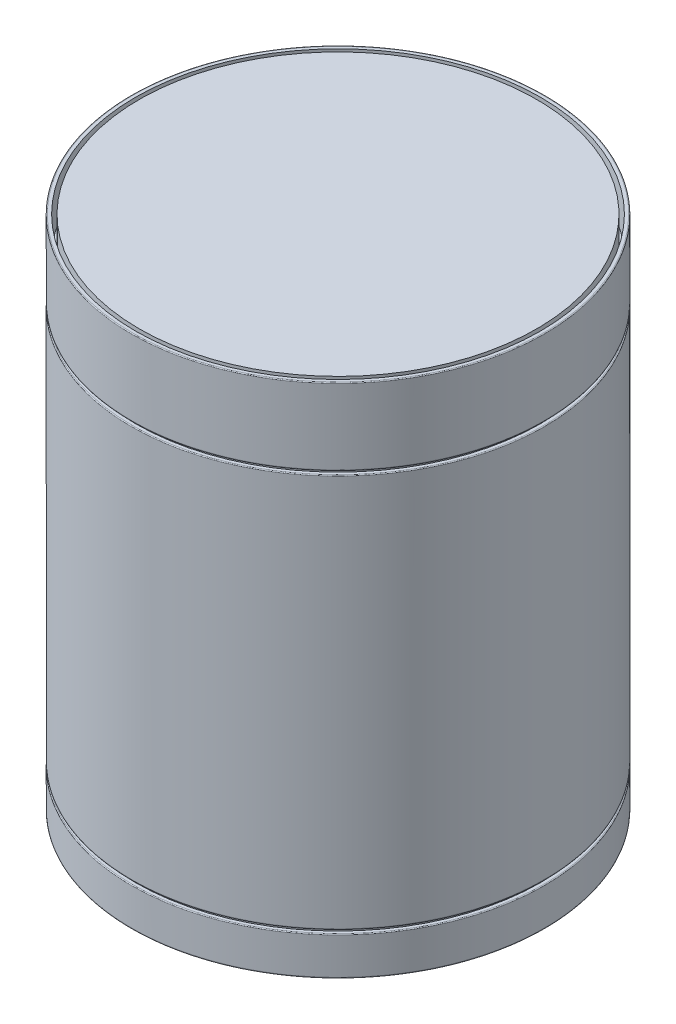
ISO-10303-21;
HEADER;
FILE_DESCRIPTION(('STEP AP214'),'2;1');
FILE_NAME('part.step','',(''),(''),'','','');
FILE_SCHEMA(('AUTOMOTIVE_DESIGN { 1 0 10303 214 1 1 1 1 }'));
ENDSEC;
DATA;
#1=APPLICATION_CONTEXT('core data for automotive mechanical design processes');
#2=APPLICATION_PROTOCOL_DEFINITION('international standard','automotive_design',2000,#1);
#3=PRODUCT_CONTEXT('',#1,'mechanical');
#4=PRODUCT('Part','Part','',(#3));
#5=PRODUCT_RELATED_PRODUCT_CATEGORY('part','',(#4));
#6=PRODUCT_DEFINITION_FORMATION('','',#4);
#7=PRODUCT_DEFINITION_CONTEXT('part definition',#1,'design');
#8=PRODUCT_DEFINITION('design','',#6,#7);
#9=PRODUCT_DEFINITION_SHAPE('','',#8);
#10=(LENGTH_UNIT() NAMED_UNIT(*) SI_UNIT(.MILLI.,.METRE.));
#11=(NAMED_UNIT(*) PLANE_ANGLE_UNIT() SI_UNIT($,.RADIAN.));
#12=(NAMED_UNIT(*) SI_UNIT($,.STERADIAN.) SOLID_ANGLE_UNIT());
#13=UNCERTAINTY_MEASURE_WITH_UNIT(LENGTH_MEASURE(1.E-05),#10,'distance_accuracy_value','');
#14=(GEOMETRIC_REPRESENTATION_CONTEXT(3) GLOBAL_UNCERTAINTY_ASSIGNED_CONTEXT((#13)) GLOBAL_UNIT_ASSIGNED_CONTEXT((#10,
#11,#12)) REPRESENTATION_CONTEXT('',''));
#15=CARTESIAN_POINT('',(0.,0.,0.));
#16=DIRECTION('',(0.,0.,1.));
#17=DIRECTION('',(1.,0.,0.));
#18=AXIS2_PLACEMENT_3D('',#15,#16,#17);
#19=CARTESIAN_POINT('',(0.,0.,0.));
#20=DIRECTION('',(0.,1.,0.));
#21=DIRECTION('',(0.,0.,1.));
#22=AXIS2_PLACEMENT_3D('',#19,#20,#21);
#23=PLANE('',#22);
#24=CARTESIAN_POINT('',(0.,0.,53.8));
#25=CARTESIAN_POINT('',(7.04145585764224,0.,53.8));
#26=CARTESIAN_POINT('',(21.1243675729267,0.,50.9987346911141));
#27=CARTESIAN_POINT('',(39.0327416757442,0.,39.0327416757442));
#28=CARTESIAN_POINT('',(50.9987346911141,0.,21.1243675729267));
#29=CARTESIAN_POINT('',(55.200632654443,0.,0.));
#30=CARTESIAN_POINT('',(50.9987346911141,0.,-21.1243675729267));
#31=CARTESIAN_POINT('',(39.0327416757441,0.,-39.0327416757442));
#32=CARTESIAN_POINT('',(21.1243675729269,0.,-50.998734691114));
#33=CARTESIAN_POINT('',(0.,0.,-55.2006326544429));
#34=CARTESIAN_POINT('',(-21.1243675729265,0.,-50.9987346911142));
#35=CARTESIAN_POINT('',(-39.0327416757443,0.,-39.0327416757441));
#36=CARTESIAN_POINT('',(-50.998734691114,0.,-21.1243675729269));
#37=CARTESIAN_POINT('',(-55.200632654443,0.,2.24994362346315E-13));
#38=CARTESIAN_POINT('',(-50.9987346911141,0.,21.1243675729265));
#39=CARTESIAN_POINT('',(-39.0327416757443,0.,39.0327416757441));
#40=CARTESIAN_POINT('',(-21.1243675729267,0.,50.9987346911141));
#41=CARTESIAN_POINT('',(-7.04145585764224,0.,53.8));
#42=CARTESIAN_POINT('',(0.,0.,53.8));
#43=B_SPLINE_CURVE_WITH_KNOTS('',3,(#24,#25,#26,#27,#28,#29,#30,#31,#32,#33,#34,#35,#36,#37,#38,
#39,#40,#41,#42),.UNSPECIFIED.,.T.,.F.,(4,1,1,1,1,1,1,1,1,1,1,1,1,1,1,1,4),(0.,
0.392699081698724,0.785398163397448,1.17809724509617,1.5707963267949,1.96349540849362,
2.35619449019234,2.74889357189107,3.14159265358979,3.53429173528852,3.92699081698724,
4.31968989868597,4.71238898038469,5.10508806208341,5.49778714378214,5.89048622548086,
6.28318530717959),.UNSPECIFIED.);
#44=CARTESIAN_POINT('',(0.,0.,53.8));
#45=VERTEX_POINT('',#44);
#46=EDGE_CURVE('E10',#45,#45,#43,.F.);
#47=ORIENTED_EDGE('',*,*,#46,.T.);
#48=EDGE_LOOP('',(#47));
#49=FACE_BOUND('',#48,.T.);
#50=ADVANCED_FACE('F38',(#49),#23,.F.);
#51=CARTESIAN_POINT('',(0.,10.,0.));
#52=DIRECTION('',(0.,-1.,0.));
#53=DIRECTION('',(0.,0.,-1.));
#54=AXIS2_PLACEMENT_3D('',#51,#52,#53);
#55=CYLINDRICAL_SURFACE('',#54,54.);
#56=CARTESIAN_POINT('',(0.,9.8,54.));
#57=CARTESIAN_POINT('',(7.06763227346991,9.8,54.));
#58=CARTESIAN_POINT('',(21.2028968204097,9.8,51.1883210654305));
#59=CARTESIAN_POINT('',(39.1778448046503,9.8,39.1778448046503));
#60=CARTESIAN_POINT('',(51.1883210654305,9.8,21.2028968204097));
#61=CARTESIAN_POINT('',(55.4058394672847,9.8,0.));
#62=CARTESIAN_POINT('',(51.1883210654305,9.8,-21.2028968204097));
#63=CARTESIAN_POINT('',(39.1778448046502,9.8,-39.1778448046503));
#64=CARTESIAN_POINT('',(21.2028968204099,9.8,-51.1883210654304));
#65=CARTESIAN_POINT('',(0.,9.8,-55.4058394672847));
#66=CARTESIAN_POINT('',(-21.2028968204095,9.8,-51.1883210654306));
#67=CARTESIAN_POINT('',(-39.1778448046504,9.8,-39.1778448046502));
#68=CARTESIAN_POINT('',(-51.1883210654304,9.8,-21.2028968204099));
#69=CARTESIAN_POINT('',(-55.4058394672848,9.8,2.23241443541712E-13));
#70=CARTESIAN_POINT('',(-51.1883210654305,9.8,21.2028968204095));
#71=CARTESIAN_POINT('',(-39.1778448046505,9.8,39.1778448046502));
#72=CARTESIAN_POINT('',(-21.2028968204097,9.8,51.1883210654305));
#73=CARTESIAN_POINT('',(-7.06763227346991,9.8,54.));
#74=CARTESIAN_POINT('',(0.,9.8,54.));
#75=B_SPLINE_CURVE_WITH_KNOTS('',3,(#56,#57,#58,#59,#60,#61,#62,#63,#64,#65,#66,#67,#68,#69,#70,
#71,#72,#73,#74),.UNSPECIFIED.,.T.,.F.,(4,1,1,1,1,1,1,1,1,1,1,1,1,1,1,1,4),(0.,
0.392699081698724,0.785398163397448,1.17809724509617,1.5707963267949,1.96349540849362,
2.35619449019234,2.74889357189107,3.14159265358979,3.53429173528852,3.92699081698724,
4.31968989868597,4.71238898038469,5.10508806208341,5.49778714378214,5.89048622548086,
6.28318530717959),.UNSPECIFIED.);
#76=CARTESIAN_POINT('',(0.,9.8,54.));
#77=VERTEX_POINT('',#76);
#78=EDGE_CURVE('E52',#77,#77,#75,.F.);
#79=ORIENTED_EDGE('',*,*,#78,.T.);
#80=EDGE_LOOP('',(#79));
#81=FACE_BOUND('',#80,.T.);
#82=CARTESIAN_POINT('',(0.,0.200000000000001,54.));
#83=CARTESIAN_POINT('',(-7.06763227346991,0.200000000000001,54.));
#84=CARTESIAN_POINT('',(-21.2028968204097,0.200000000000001,51.1883210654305));
#85=CARTESIAN_POINT('',(-39.1778448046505,0.200000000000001,39.1778448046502));
#86=CARTESIAN_POINT('',(-51.1883210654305,0.200000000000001,21.2028968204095));
#87=CARTESIAN_POINT('',(-55.4058394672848,0.200000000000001,2.23241443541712E-13));
#88=CARTESIAN_POINT('',(-51.1883210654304,0.200000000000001,-21.2028968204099));
#89=CARTESIAN_POINT('',(-39.1778448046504,0.200000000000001,-39.1778448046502));
#90=CARTESIAN_POINT('',(-21.2028968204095,0.200000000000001,-51.1883210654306));
#91=CARTESIAN_POINT('',(0.,0.2,-55.4058394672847));
#92=CARTESIAN_POINT('',(21.2028968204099,0.200000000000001,-51.1883210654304));
#93=CARTESIAN_POINT('',(39.1778448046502,0.2,-39.1778448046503));
#94=CARTESIAN_POINT('',(51.1883210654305,0.200000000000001,-21.2028968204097));
#95=CARTESIAN_POINT('',(55.4058394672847,0.200000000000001,0.));
#96=CARTESIAN_POINT('',(51.1883210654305,0.2,21.2028968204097));
#97=CARTESIAN_POINT('',(39.1778448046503,0.200000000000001,39.1778448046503));
#98=CARTESIAN_POINT('',(21.2028968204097,0.200000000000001,51.1883210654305));
#99=CARTESIAN_POINT('',(7.06763227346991,0.200000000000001,54.));
#100=CARTESIAN_POINT('',(0.,0.200000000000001,54.));
#101=B_SPLINE_CURVE_WITH_KNOTS('',3,(#82,#83,#84,#85,#86,#87,#88,#89,#90,#91,#92,#93,#94,#95,
#96,#97,#98,#99,#100),.UNSPECIFIED.,.T.,.F.,(4,1,1,1,1,1,1,1,1,1,1,1,1,1,1,1,4),(0.,
0.392699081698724,0.785398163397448,1.17809724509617,1.5707963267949,1.96349540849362,
2.35619449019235,2.74889357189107,3.14159265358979,3.53429173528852,3.92699081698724,
4.31968989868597,4.71238898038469,5.10508806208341,5.49778714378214,5.89048622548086,
6.28318530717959),.UNSPECIFIED.);
#102=CARTESIAN_POINT('',(0.,0.200000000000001,54.));
#103=VERTEX_POINT('',#102);
#104=EDGE_CURVE('E57',#103,#103,#101,.F.);
#105=ORIENTED_EDGE('',*,*,#104,.T.);
#106=EDGE_LOOP('',(#105));
#107=FACE_BOUND('',#106,.T.);
#108=ADVANCED_FACE('F229',(#81,#107),#55,.T.);
#109=CARTESIAN_POINT('',(0.,10.,0.));
#110=DIRECTION('',(0.,1.,0.));
#111=DIRECTION('',(0.,0.,1.));
#112=AXIS2_PLACEMENT_3D('',#109,#110,#111);
#113=PLANE('',#112);
#114=CARTESIAN_POINT('',(0.,10.,53.8));
#115=CARTESIAN_POINT('',(-7.04145585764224,10.,53.8));
#116=CARTESIAN_POINT('',(-21.1243675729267,10.,50.9987346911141));
#117=CARTESIAN_POINT('',(-39.0327416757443,10.,39.0327416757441));
#118=CARTESIAN_POINT('',(-50.9987346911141,10.,21.1243675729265));
#119=CARTESIAN_POINT('',(-55.200632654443,10.,2.24994362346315E-13));
#120=CARTESIAN_POINT('',(-50.998734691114,10.,-21.1243675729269));
#121=CARTESIAN_POINT('',(-39.0327416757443,10.,-39.0327416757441));
#122=CARTESIAN_POINT('',(-21.1243675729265,10.,-50.9987346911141));
#123=CARTESIAN_POINT('',(0.,10.,-55.2006326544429));
#124=CARTESIAN_POINT('',(21.1243675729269,10.,-50.998734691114));
#125=CARTESIAN_POINT('',(39.0327416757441,9.99999999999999,-39.0327416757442));
#126=CARTESIAN_POINT('',(50.9987346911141,10.,-21.1243675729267));
#127=CARTESIAN_POINT('',(55.200632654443,10.,0.));
#128=CARTESIAN_POINT('',(50.9987346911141,10.,21.1243675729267));
#129=CARTESIAN_POINT('',(39.0327416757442,10.,39.0327416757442));
#130=CARTESIAN_POINT('',(21.1243675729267,10.,50.998734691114));
#131=CARTESIAN_POINT('',(7.04145585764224,10.,53.8));
#132=CARTESIAN_POINT('',(0.,10.,53.8));
#133=B_SPLINE_CURVE_WITH_KNOTS('',3,(#114,#115,#116,#117,#118,#119,#120,#121,#122,#123,#124,
#125,#126,#127,#128,#129,#130,#131,#132),.UNSPECIFIED.,.T.,.F.,(4,1,1,1,1,1,1,1,1,1,1,1,1,1,1,1,
4),(0.,0.392699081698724,0.785398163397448,1.17809724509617,1.5707963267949,1.96349540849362,
2.35619449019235,2.74889357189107,3.14159265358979,3.53429173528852,3.92699081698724,
4.31968989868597,4.71238898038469,5.10508806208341,5.49778714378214,5.89048622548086,
6.28318530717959),.UNSPECIFIED.);
#134=CARTESIAN_POINT('',(0.,10.,53.8));
#135=VERTEX_POINT('',#134);
#136=EDGE_CURVE('E62',#135,#135,#133,.F.);
#137=ORIENTED_EDGE('',*,*,#136,.T.);
#138=EDGE_LOOP('',(#137));
#139=FACE_BOUND('',#138,.T.);
#140=CARTESIAN_POINT('',(0.,10.,0.));
#141=DIRECTION('',(0.,1.,0.));
#142=DIRECTION('',(0.,0.,1.));
#143=AXIS2_PLACEMENT_3D('',#140,#141,#142);
#144=CIRCLE('',#143,53.);
#145=CARTESIAN_POINT('',(0.,10.,53.));
#146=VERTEX_POINT('',#145);
#147=EDGE_CURVE('E942',#146,#146,#144,.T.);
#148=ORIENTED_EDGE('',*,*,#147,.F.);
#149=EDGE_LOOP('',(#148));
#150=FACE_BOUND('',#149,.T.);
#151=ADVANCED_FACE('F224',(#139,#150),#113,.T.);
#152=CARTESIAN_POINT('',(0.,11.,0.));
#153=DIRECTION('',(0.,-1.,0.));
#154=DIRECTION('',(0.,0.,-1.));
#155=AXIS2_PLACEMENT_3D('',#152,#153,#154);
#156=CYLINDRICAL_SURFACE('',#155,53.);
#157=CARTESIAN_POINT('',(0.,11.,0.));
#158=DIRECTION('',(0.,1.,0.));
#159=DIRECTION('',(0.,0.,1.));
#160=AXIS2_PLACEMENT_3D('',#157,#158,#159);
#161=CIRCLE('',#160,53.);
#162=CARTESIAN_POINT('',(0.,11.,53.));
#163=VERTEX_POINT('',#162);
#164=EDGE_CURVE('E946',#163,#163,#161,.T.);
#165=ORIENTED_EDGE('',*,*,#164,.F.);
#166=EDGE_LOOP('',(#165));
#167=FACE_BOUND('',#166,.T.);
#168=ORIENTED_EDGE('',*,*,#147,.T.);
#169=EDGE_LOOP('',(#168));
#170=FACE_BOUND('',#169,.T.);
#171=ADVANCED_FACE('F177',(#167,#170),#156,.T.);
#172=CARTESIAN_POINT('',(0.,11.,0.));
#173=DIRECTION('',(0.,1.,0.));
#174=DIRECTION('',(0.,0.,1.));
#175=AXIS2_PLACEMENT_3D('',#172,#173,#174);
#176=PLANE('',#175);
#177=CARTESIAN_POINT('',(0.,11.,53.8));
#178=CARTESIAN_POINT('',(7.04145585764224,11.,53.8));
#179=CARTESIAN_POINT('',(21.1243675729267,11.,50.9987346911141));
#180=CARTESIAN_POINT('',(39.0327416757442,11.,39.0327416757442));
#181=CARTESIAN_POINT('',(50.9987346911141,11.,21.1243675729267));
#182=CARTESIAN_POINT('',(55.200632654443,11.,0.));
#183=CARTESIAN_POINT('',(50.9987346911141,11.,-21.1243675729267));
#184=CARTESIAN_POINT('',(39.0327416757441,11.,-39.0327416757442));
#185=CARTESIAN_POINT('',(21.1243675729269,11.,-50.998734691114));
#186=CARTESIAN_POINT('',(0.,11.,-55.2006326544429));
#187=CARTESIAN_POINT('',(-21.1243675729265,11.,-50.9987346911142));
#188=CARTESIAN_POINT('',(-39.0327416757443,11.,-39.0327416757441));
#189=CARTESIAN_POINT('',(-50.998734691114,11.,-21.1243675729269));
#190=CARTESIAN_POINT('',(-55.200632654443,11.,2.24994362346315E-13));
#191=CARTESIAN_POINT('',(-50.9987346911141,11.,21.1243675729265));
#192=CARTESIAN_POINT('',(-39.0327416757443,11.,39.0327416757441));
#193=CARTESIAN_POINT('',(-21.1243675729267,11.,50.9987346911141));
#194=CARTESIAN_POINT('',(-7.04145585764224,11.,53.8));
#195=CARTESIAN_POINT('',(0.,11.,53.8));
#196=B_SPLINE_CURVE_WITH_KNOTS('',3,(#177,#178,#179,#180,#181,#182,#183,#184,#185,#186,#187,
#188,#189,#190,#191,#192,#193,#194,#195),.UNSPECIFIED.,.T.,.F.,(4,1,1,1,1,1,1,1,1,1,1,1,1,1,1,1,
4),(0.,0.392699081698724,0.785398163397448,1.17809724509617,1.5707963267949,1.96349540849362,
2.35619449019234,2.74889357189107,3.14159265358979,3.53429173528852,3.92699081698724,
4.31968989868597,4.71238898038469,5.10508806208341,5.49778714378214,5.89048622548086,
6.28318530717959),.UNSPECIFIED.);
#197=CARTESIAN_POINT('',(0.,11.,53.8));
#198=VERTEX_POINT('',#197);
#199=EDGE_CURVE('E67',#198,#198,#196,.F.);
#200=ORIENTED_EDGE('',*,*,#199,.T.);
#201=EDGE_LOOP('',(#200));
#202=FACE_BOUND('',#201,.T.);
#203=ORIENTED_EDGE('',*,*,#164,.T.);
#204=EDGE_LOOP('',(#203));
#205=FACE_BOUND('',#204,.T.);
#206=ADVANCED_FACE('F166',(#202,#205),#176,.F.);
#207=CARTESIAN_POINT('',(0.,114.,0.));
#208=DIRECTION('',(0.,-1.,0.));
#209=DIRECTION('',(0.,0.,-1.));
#210=AXIS2_PLACEMENT_3D('',#207,#208,#209);
#211=CYLINDRICAL_SURFACE('',#210,54.);
#212=CARTESIAN_POINT('',(0.,113.8,54.));
#213=CARTESIAN_POINT('',(7.06763227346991,113.8,54.));
#214=CARTESIAN_POINT('',(21.2028968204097,113.8,51.1883210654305));
#215=CARTESIAN_POINT('',(39.1778448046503,113.8,39.1778448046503));
#216=CARTESIAN_POINT('',(51.1883210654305,113.8,21.2028968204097));
#217=CARTESIAN_POINT('',(55.4058394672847,113.8,0.));
#218=CARTESIAN_POINT('',(51.1883210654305,113.8,-21.2028968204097));
#219=CARTESIAN_POINT('',(39.1778448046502,113.8,-39.1778448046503));
#220=CARTESIAN_POINT('',(21.2028968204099,113.8,-51.1883210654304));
#221=CARTESIAN_POINT('',(0.,113.8,-55.4058394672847));
#222=CARTESIAN_POINT('',(-21.2028968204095,113.8,-51.1883210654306));
#223=CARTESIAN_POINT('',(-39.1778448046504,113.8,-39.1778448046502));
#224=CARTESIAN_POINT('',(-51.1883210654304,113.8,-21.2028968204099));
#225=CARTESIAN_POINT('',(-55.4058394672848,113.8,2.23241443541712E-13));
#226=CARTESIAN_POINT('',(-51.1883210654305,113.8,21.2028968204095));
#227=CARTESIAN_POINT('',(-39.1778448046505,113.8,39.1778448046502));
#228=CARTESIAN_POINT('',(-21.2028968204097,113.8,51.1883210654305));
#229=CARTESIAN_POINT('',(-7.06763227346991,113.8,54.));
#230=CARTESIAN_POINT('',(0.,113.8,54.));
#231=B_SPLINE_CURVE_WITH_KNOTS('',3,(#212,#213,#214,#215,#216,#217,#218,#219,#220,#221,#222,
#223,#224,#225,#226,#227,#228,#229,#230),.UNSPECIFIED.,.T.,.F.,(4,1,1,1,1,1,1,1,1,1,1,1,1,1,1,1,
4),(0.,0.392699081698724,0.785398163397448,1.17809724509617,1.5707963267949,1.96349540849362,
2.35619449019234,2.74889357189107,3.14159265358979,3.53429173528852,3.92699081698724,
4.31968989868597,4.71238898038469,5.10508806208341,5.49778714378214,5.89048622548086,
6.28318530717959),.UNSPECIFIED.);
#232=CARTESIAN_POINT('',(0.,113.8,54.));
#233=VERTEX_POINT('',#232);
#234=EDGE_CURVE('E77',#233,#233,#231,.F.);
#235=ORIENTED_EDGE('',*,*,#234,.T.);
#236=EDGE_LOOP('',(#235));
#237=FACE_BOUND('',#236,.T.);
#238=CARTESIAN_POINT('',(0.,11.2,54.));
#239=CARTESIAN_POINT('',(-7.06763227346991,11.2,54.));
#240=CARTESIAN_POINT('',(-21.2028968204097,11.2,51.1883210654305));
#241=CARTESIAN_POINT('',(-39.1778448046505,11.2,39.1778448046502));
#242=CARTESIAN_POINT('',(-51.1883210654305,11.2,21.2028968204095));
#243=CARTESIAN_POINT('',(-55.4058394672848,11.2,2.23241443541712E-13));
#244=CARTESIAN_POINT('',(-51.1883210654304,11.2,-21.2028968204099));
#245=CARTESIAN_POINT('',(-39.1778448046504,11.2,-39.1778448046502));
#246=CARTESIAN_POINT('',(-21.2028968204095,11.2,-51.1883210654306));
#247=CARTESIAN_POINT('',(0.,11.2,-55.4058394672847));
#248=CARTESIAN_POINT('',(21.2028968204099,11.2,-51.1883210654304));
#249=CARTESIAN_POINT('',(39.1778448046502,11.2,-39.1778448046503));
#250=CARTESIAN_POINT('',(51.1883210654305,11.2,-21.2028968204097));
#251=CARTESIAN_POINT('',(55.4058394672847,11.2,0.));
#252=CARTESIAN_POINT('',(51.1883210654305,11.2,21.2028968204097));
#253=CARTESIAN_POINT('',(39.1778448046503,11.2,39.1778448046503));
#254=CARTESIAN_POINT('',(21.2028968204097,11.2,51.1883210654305));
#255=CARTESIAN_POINT('',(7.06763227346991,11.2,54.));
#256=CARTESIAN_POINT('',(0.,11.2,54.));
#257=B_SPLINE_CURVE_WITH_KNOTS('',3,(#238,#239,#240,#241,#242,#243,#244,#245,#246,#247,#248,
#249,#250,#251,#252,#253,#254,#255,#256),.UNSPECIFIED.,.T.,.F.,(4,1,1,1,1,1,1,1,1,1,1,1,1,1,1,1,
4),(0.,0.392699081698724,0.785398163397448,1.17809724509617,1.5707963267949,1.96349540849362,
2.35619449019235,2.74889357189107,3.14159265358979,3.53429173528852,3.92699081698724,
4.31968989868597,4.71238898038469,5.10508806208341,5.49778714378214,5.89048622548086,
6.28318530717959),.UNSPECIFIED.);
#258=CARTESIAN_POINT('',(0.,11.2,54.));
#259=VERTEX_POINT('',#258);
#260=EDGE_CURVE('E82',#259,#259,#257,.F.);
#261=ORIENTED_EDGE('',*,*,#260,.T.);
#262=EDGE_LOOP('',(#261));
#263=FACE_BOUND('',#262,.T.);
#264=ADVANCED_FACE('F176',(#237,#263),#211,.T.);
#265=CARTESIAN_POINT('',(0.,114.,0.));
#266=DIRECTION('',(0.,1.,0.));
#267=DIRECTION('',(0.,0.,1.));
#268=AXIS2_PLACEMENT_3D('',#265,#266,#267);
#269=PLANE('',#268);
#270=CARTESIAN_POINT('',(0.,114.,53.8));
#271=CARTESIAN_POINT('',(-7.04145585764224,114.,53.8));
#272=CARTESIAN_POINT('',(-21.1243675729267,114.,50.9987346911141));
#273=CARTESIAN_POINT('',(-39.0327416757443,114.,39.0327416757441));
#274=CARTESIAN_POINT('',(-50.9987346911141,114.,21.1243675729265));
#275=CARTESIAN_POINT('',(-55.200632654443,114.,2.24994362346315E-13));
#276=CARTESIAN_POINT('',(-50.998734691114,114.,-21.1243675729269));
#277=CARTESIAN_POINT('',(-39.0327416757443,114.,-39.0327416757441));
#278=CARTESIAN_POINT('',(-21.1243675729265,114.,-50.9987346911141));
#279=CARTESIAN_POINT('',(0.,114.,-55.2006326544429));
#280=CARTESIAN_POINT('',(21.1243675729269,114.,-50.998734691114));
#281=CARTESIAN_POINT('',(39.0327416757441,114.,-39.0327416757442));
#282=CARTESIAN_POINT('',(50.9987346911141,114.,-21.1243675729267));
#283=CARTESIAN_POINT('',(55.200632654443,114.,0.));
#284=CARTESIAN_POINT('',(50.9987346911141,114.,21.1243675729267));
#285=CARTESIAN_POINT('',(39.0327416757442,114.,39.0327416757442));
#286=CARTESIAN_POINT('',(21.1243675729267,114.,50.998734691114));
#287=CARTESIAN_POINT('',(7.04145585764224,114.,53.8));
#288=CARTESIAN_POINT('',(0.,114.,53.8));
#289=B_SPLINE_CURVE_WITH_KNOTS('',3,(#270,#271,#272,#273,#274,#275,#276,#277,#278,#279,#280,
#281,#282,#283,#284,#285,#286,#287,#288),.UNSPECIFIED.,.T.,.F.,(4,1,1,1,1,1,1,1,1,1,1,1,1,1,1,1,
4),(0.,0.392699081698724,0.785398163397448,1.17809724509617,1.5707963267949,1.96349540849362,
2.35619449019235,2.74889357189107,3.14159265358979,3.53429173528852,3.92699081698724,
4.31968989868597,4.71238898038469,5.10508806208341,5.49778714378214,5.89048622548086,
6.28318530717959),.UNSPECIFIED.);
#290=CARTESIAN_POINT('',(0.,114.,53.8));
#291=VERTEX_POINT('',#290);
#292=EDGE_CURVE('E87',#291,#291,#289,.F.);
#293=ORIENTED_EDGE('',*,*,#292,.T.);
#294=EDGE_LOOP('',(#293));
#295=FACE_BOUND('',#294,.T.);
#296=CARTESIAN_POINT('',(0.,114.,0.));
#297=DIRECTION('',(0.,1.,0.));
#298=DIRECTION('',(0.,0.,1.));
#299=AXIS2_PLACEMENT_3D('',#296,#297,#298);
#300=CIRCLE('',#299,53.);
#301=CARTESIAN_POINT('',(0.,114.,53.));
#302=VERTEX_POINT('',#301);
#303=EDGE_CURVE('E945',#302,#302,#300,.T.);
#304=ORIENTED_EDGE('',*,*,#303,.F.);
#305=EDGE_LOOP('',(#304));
#306=FACE_BOUND('',#305,.T.);
#307=ADVANCED_FACE('F178',(#295,#306),#269,.T.);
#308=CARTESIAN_POINT('',(0.,115.,0.));
#309=DIRECTION('',(0.,-1.,0.));
#310=DIRECTION('',(0.,0.,-1.));
#311=AXIS2_PLACEMENT_3D('',#308,#309,#310);
#312=CYLINDRICAL_SURFACE('',#311,53.);
#313=CARTESIAN_POINT('',(0.,115.,0.));
#314=DIRECTION('',(0.,1.,0.));
#315=DIRECTION('',(0.,0.,1.));
#316=AXIS2_PLACEMENT_3D('',#313,#314,#315);
#317=CIRCLE('',#316,53.);
#318=CARTESIAN_POINT('',(0.,115.,53.));
#319=VERTEX_POINT('',#318);
#320=EDGE_CURVE('E949',#319,#319,#317,.T.);
#321=ORIENTED_EDGE('',*,*,#320,.F.);
#322=EDGE_LOOP('',(#321));
#323=FACE_BOUND('',#322,.T.);
#324=ORIENTED_EDGE('',*,*,#303,.T.);
#325=EDGE_LOOP('',(#324));
#326=FACE_BOUND('',#325,.T.);
#327=ADVANCED_FACE('F149',(#323,#326),#312,.T.);
#328=CARTESIAN_POINT('',(0.,115.,0.));
#329=DIRECTION('',(0.,1.,0.));
#330=DIRECTION('',(0.,0.,1.));
#331=AXIS2_PLACEMENT_3D('',#328,#329,#330);
#332=PLANE('',#331);
#333=CARTESIAN_POINT('',(0.,115.,53.8));
#334=CARTESIAN_POINT('',(7.04145585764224,115.,53.8));
#335=CARTESIAN_POINT('',(21.1243675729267,115.,50.9987346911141));
#336=CARTESIAN_POINT('',(39.0327416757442,115.,39.0327416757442));
#337=CARTESIAN_POINT('',(50.9987346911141,115.,21.1243675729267));
#338=CARTESIAN_POINT('',(55.200632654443,115.,0.));
#339=CARTESIAN_POINT('',(50.9987346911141,115.,-21.1243675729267));
#340=CARTESIAN_POINT('',(39.0327416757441,115.,-39.0327416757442));
#341=CARTESIAN_POINT('',(21.1243675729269,115.,-50.998734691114));
#342=CARTESIAN_POINT('',(0.,115.,-55.2006326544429));
#343=CARTESIAN_POINT('',(-21.1243675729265,115.,-50.9987346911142));
#344=CARTESIAN_POINT('',(-39.0327416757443,115.,-39.0327416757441));
#345=CARTESIAN_POINT('',(-50.998734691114,115.,-21.1243675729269));
#346=CARTESIAN_POINT('',(-55.200632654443,115.,2.24994362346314E-13));
#347=CARTESIAN_POINT('',(-50.9987346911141,115.,21.1243675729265));
#348=CARTESIAN_POINT('',(-39.0327416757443,115.,39.0327416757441));
#349=CARTESIAN_POINT('',(-21.1243675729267,115.,50.9987346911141));
#350=CARTESIAN_POINT('',(-7.04145585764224,115.,53.8));
#351=CARTESIAN_POINT('',(0.,115.,53.8));
#352=B_SPLINE_CURVE_WITH_KNOTS('',3,(#333,#334,#335,#336,#337,#338,#339,#340,#341,#342,#343,
#344,#345,#346,#347,#348,#349,#350,#351),.UNSPECIFIED.,.T.,.F.,(4,1,1,1,1,1,1,1,1,1,1,1,1,1,1,1,
4),(0.,0.392699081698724,0.785398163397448,1.17809724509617,1.5707963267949,1.96349540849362,
2.35619449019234,2.74889357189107,3.14159265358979,3.53429173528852,3.92699081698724,
4.31968989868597,4.71238898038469,5.10508806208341,5.49778714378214,5.89048622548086,
6.28318530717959),.UNSPECIFIED.);
#353=CARTESIAN_POINT('',(0.,115.,53.8));
#354=VERTEX_POINT('',#353);
#355=EDGE_CURVE('E72',#354,#354,#352,.F.);
#356=ORIENTED_EDGE('',*,*,#355,.T.);
#357=EDGE_LOOP('',(#356));
#358=FACE_BOUND('',#357,.T.);
#359=ORIENTED_EDGE('',*,*,#320,.T.);
#360=EDGE_LOOP('',(#359));
#361=FACE_BOUND('',#360,.T.);
#362=ADVANCED_FACE('F145',(#358,#361),#332,.F.);
#363=CARTESIAN_POINT('',(0.,135.,0.));
#364=DIRECTION('',(0.,-1.,0.));
#365=DIRECTION('',(0.,0.,-1.));
#366=AXIS2_PLACEMENT_3D('',#363,#364,#365);
#367=CYLINDRICAL_SURFACE('',#366,54.);
#368=CARTESIAN_POINT('',(0.,134.8,54.));
#369=CARTESIAN_POINT('',(7.06763227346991,134.8,54.));
#370=CARTESIAN_POINT('',(21.2028968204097,134.8,51.1883210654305));
#371=CARTESIAN_POINT('',(39.1778448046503,134.8,39.1778448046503));
#372=CARTESIAN_POINT('',(51.1883210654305,134.8,21.2028968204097));
#373=CARTESIAN_POINT('',(55.4058394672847,134.8,0.));
#374=CARTESIAN_POINT('',(51.1883210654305,134.8,-21.2028968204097));
#375=CARTESIAN_POINT('',(39.1778448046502,134.8,-39.1778448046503));
#376=CARTESIAN_POINT('',(21.2028968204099,134.8,-51.1883210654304));
#377=CARTESIAN_POINT('',(0.,134.8,-55.4058394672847));
#378=CARTESIAN_POINT('',(-21.2028968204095,134.8,-51.1883210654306));
#379=CARTESIAN_POINT('',(-39.1778448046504,134.8,-39.1778448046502));
#380=CARTESIAN_POINT('',(-51.1883210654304,134.8,-21.2028968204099));
#381=CARTESIAN_POINT('',(-55.4058394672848,134.8,2.23241443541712E-13));
#382=CARTESIAN_POINT('',(-51.1883210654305,134.8,21.2028968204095));
#383=CARTESIAN_POINT('',(-39.1778448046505,134.8,39.1778448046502));
#384=CARTESIAN_POINT('',(-21.2028968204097,134.8,51.1883210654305));
#385=CARTESIAN_POINT('',(-7.06763227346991,134.8,54.));
#386=CARTESIAN_POINT('',(0.,134.8,54.));
#387=B_SPLINE_CURVE_WITH_KNOTS('',3,(#368,#369,#370,#371,#372,#373,#374,#375,#376,#377,#378,
#379,#380,#381,#382,#383,#384,#385,#386),.UNSPECIFIED.,.T.,.F.,(4,1,1,1,1,1,1,1,1,1,1,1,1,1,1,1,
4),(0.,0.392699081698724,0.785398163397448,1.17809724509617,1.5707963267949,1.96349540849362,
2.35619449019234,2.74889357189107,3.14159265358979,3.53429173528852,3.92699081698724,
4.31968989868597,4.71238898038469,5.10508806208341,5.49778714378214,5.89048622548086,
6.28318530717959),.UNSPECIFIED.);
#388=CARTESIAN_POINT('',(0.,134.8,54.));
#389=VERTEX_POINT('',#388);
#390=EDGE_CURVE('E92',#389,#389,#387,.F.);
#391=ORIENTED_EDGE('',*,*,#390,.T.);
#392=EDGE_LOOP('',(#391));
#393=FACE_BOUND('',#392,.T.);
#394=CARTESIAN_POINT('',(0.,115.2,54.));
#395=CARTESIAN_POINT('',(-7.06763227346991,115.2,54.));
#396=CARTESIAN_POINT('',(-21.2028968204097,115.2,51.1883210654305));
#397=CARTESIAN_POINT('',(-39.1778448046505,115.2,39.1778448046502));
#398=CARTESIAN_POINT('',(-51.1883210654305,115.2,21.2028968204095));
#399=CARTESIAN_POINT('',(-55.4058394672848,115.2,2.23241443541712E-13));
#400=CARTESIAN_POINT('',(-51.1883210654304,115.2,-21.2028968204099));
#401=CARTESIAN_POINT('',(-39.1778448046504,115.2,-39.1778448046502));
#402=CARTESIAN_POINT('',(-21.2028968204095,115.2,-51.1883210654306));
#403=CARTESIAN_POINT('',(0.,115.2,-55.4058394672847));
#404=CARTESIAN_POINT('',(21.2028968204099,115.2,-51.1883210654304));
#405=CARTESIAN_POINT('',(39.1778448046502,115.2,-39.1778448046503));
#406=CARTESIAN_POINT('',(51.1883210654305,115.2,-21.2028968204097));
#407=CARTESIAN_POINT('',(55.4058394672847,115.2,0.));
#408=CARTESIAN_POINT('',(51.1883210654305,115.2,21.2028968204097));
#409=CARTESIAN_POINT('',(39.1778448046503,115.2,39.1778448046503));
#410=CARTESIAN_POINT('',(21.2028968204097,115.2,51.1883210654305));
#411=CARTESIAN_POINT('',(7.06763227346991,115.2,54.));
#412=CARTESIAN_POINT('',(0.,115.2,54.));
#413=B_SPLINE_CURVE_WITH_KNOTS('',3,(#394,#395,#396,#397,#398,#399,#400,#401,#402,#403,#404,
#405,#406,#407,#408,#409,#410,#411,#412),.UNSPECIFIED.,.T.,.F.,(4,1,1,1,1,1,1,1,1,1,1,1,1,1,1,1,
4),(0.,0.392699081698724,0.785398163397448,1.17809724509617,1.5707963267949,1.96349540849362,
2.35619449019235,2.74889357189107,3.14159265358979,3.53429173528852,3.92699081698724,
4.31968989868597,4.71238898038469,5.10508806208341,5.49778714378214,5.89048622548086,
6.28318530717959),.UNSPECIFIED.);
#414=CARTESIAN_POINT('',(0.,115.2,54.));
#415=VERTEX_POINT('',#414);
#416=EDGE_CURVE('E97',#415,#415,#413,.F.);
#417=ORIENTED_EDGE('',*,*,#416,.T.);
#418=EDGE_LOOP('',(#417));
#419=FACE_BOUND('',#418,.T.);
#420=ADVANCED_FACE('F143',(#393,#419),#367,.T.);
#421=CARTESIAN_POINT('',(0.,135.,0.));
#422=DIRECTION('',(0.,1.,0.));
#423=DIRECTION('',(0.,0.,1.));
#424=AXIS2_PLACEMENT_3D('',#421,#422,#423);
#425=PLANE('',#424);
#426=CARTESIAN_POINT('',(0.,135.,53.8));
#427=CARTESIAN_POINT('',(-7.04145585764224,135.,53.8));
#428=CARTESIAN_POINT('',(-21.1243675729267,135.,50.9987346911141));
#429=CARTESIAN_POINT('',(-39.0327416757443,135.,39.0327416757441));
#430=CARTESIAN_POINT('',(-50.9987346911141,135.,21.1243675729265));
#431=CARTESIAN_POINT('',(-55.200632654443,135.,2.24994362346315E-13));
#432=CARTESIAN_POINT('',(-50.998734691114,135.,-21.1243675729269));
#433=CARTESIAN_POINT('',(-39.0327416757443,135.,-39.0327416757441));
#434=CARTESIAN_POINT('',(-21.1243675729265,135.,-50.9987346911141));
#435=CARTESIAN_POINT('',(0.,135.,-55.2006326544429));
#436=CARTESIAN_POINT('',(21.1243675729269,135.,-50.998734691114));
#437=CARTESIAN_POINT('',(39.0327416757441,135.,-39.0327416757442));
#438=CARTESIAN_POINT('',(50.9987346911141,135.,-21.1243675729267));
#439=CARTESIAN_POINT('',(55.200632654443,135.,0.));
#440=CARTESIAN_POINT('',(50.9987346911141,135.,21.1243675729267));
#441=CARTESIAN_POINT('',(39.0327416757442,135.,39.0327416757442));
#442=CARTESIAN_POINT('',(21.1243675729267,135.,50.998734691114));
#443=CARTESIAN_POINT('',(7.04145585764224,135.,53.8));
#444=CARTESIAN_POINT('',(0.,135.,53.8));
#445=B_SPLINE_CURVE_WITH_KNOTS('',3,(#426,#427,#428,#429,#430,#431,#432,#433,#434,#435,#436,
#437,#438,#439,#440,#441,#442,#443,#444),.UNSPECIFIED.,.T.,.F.,(4,1,1,1,1,1,1,1,1,1,1,1,1,1,1,1,
4),(0.,0.392699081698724,0.785398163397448,1.17809724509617,1.5707963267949,1.96349540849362,
2.35619449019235,2.74889357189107,3.14159265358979,3.53429173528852,3.92699081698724,
4.31968989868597,4.71238898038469,5.10508806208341,5.49778714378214,5.89048622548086,
6.28318530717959),.UNSPECIFIED.);
#446=CARTESIAN_POINT('',(0.,135.,53.8));
#447=VERTEX_POINT('',#446);
#448=EDGE_CURVE('E102',#447,#447,#445,.F.);
#449=ORIENTED_EDGE('',*,*,#448,.T.);
#450=EDGE_LOOP('',(#449));
#451=FACE_BOUND('',#450,.T.);
#452=CARTESIAN_POINT('',(0.,135.,0.));
#453=DIRECTION('',(0.,1.,0.));
#454=DIRECTION('',(0.,0.,1.));
#455=AXIS2_PLACEMENT_3D('',#452,#453,#454);
#456=CIRCLE('',#455,53.);
#457=CARTESIAN_POINT('',(0.,135.,53.));
#458=VERTEX_POINT('',#457);
#459=EDGE_CURVE('E955',#458,#458,#456,.T.);
#460=ORIENTED_EDGE('',*,*,#459,.F.);
#461=EDGE_LOOP('',(#460));
#462=FACE_BOUND('',#461,.T.);
#463=ADVANCED_FACE('F132',(#451,#462),#425,.T.);
#464=CARTESIAN_POINT('',(0.,125.,0.));
#465=DIRECTION('',(0.,1.,0.));
#466=DIRECTION('',(0.,0.,1.));
#467=AXIS2_PLACEMENT_3D('',#464,#465,#466);
#468=CYLINDRICAL_SURFACE('',#467,53.);
#469=CARTESIAN_POINT('',(0.,125.,0.));
#470=DIRECTION('',(0.,1.,0.));
#471=DIRECTION('',(0.,0.,1.));
#472=AXIS2_PLACEMENT_3D('',#469,#470,#471);
#473=CIRCLE('',#472,53.);
#474=CARTESIAN_POINT('',(0.,125.,53.));
#475=VERTEX_POINT('',#474);
#476=EDGE_CURVE('E954',#475,#475,#473,.T.);
#477=ORIENTED_EDGE('',*,*,#476,.F.);
#478=EDGE_LOOP('',(#477));
#479=FACE_BOUND('',#478,.T.);
#480=ORIENTED_EDGE('',*,*,#459,.T.);
#481=EDGE_LOOP('',(#480));
#482=FACE_BOUND('',#481,.T.);
#483=ADVANCED_FACE('F142',(#479,#482),#468,.F.);
#484=CARTESIAN_POINT('',(0.,125.,0.));
#485=DIRECTION('',(0.,1.,0.));
#486=DIRECTION('',(0.,0.,1.));
#487=AXIS2_PLACEMENT_3D('',#484,#485,#486);
#488=PLANE('',#487);
#489=CARTESIAN_POINT('',(0.,125.,0.));
#490=DIRECTION('',(0.,1.,0.));
#491=DIRECTION('',(0.,0.,1.));
#492=AXIS2_PLACEMENT_3D('',#489,#490,#491);
#493=CIRCLE('',#492,52.);
#494=CARTESIAN_POINT('',(0.,125.,52.));
#495=VERTEX_POINT('',#494);
#496=EDGE_CURVE('E126',#495,#495,#493,.T.);
#497=ORIENTED_EDGE('',*,*,#496,.F.);
#498=EDGE_LOOP('',(#497));
#499=FACE_BOUND('',#498,.T.);
#500=ORIENTED_EDGE('',*,*,#476,.T.);
#501=EDGE_LOOP('',(#500));
#502=FACE_BOUND('',#501,.T.);
#503=ADVANCED_FACE('F506',(#499,#502),#488,.T.);
#504=CARTESIAN_POINT('',(0.,282.078210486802,0.));
#505=DIRECTION('',(0.,-1.,0.));
#506=DIRECTION('',(0.,0.,-1.));
#507=AXIS2_PLACEMENT_3D('',#504,#505,#506);
#508=CYLINDRICAL_SURFACE('',#507,52.);
#509=CARTESIAN_POINT('',(0.,135.,0.));
#510=DIRECTION('',(0.,1.,0.));
#511=DIRECTION('',(0.,0.,1.));
#512=AXIS2_PLACEMENT_3D('',#509,#510,#511);
#513=CIRCLE('',#512,52.);
#514=CARTESIAN_POINT('',(0.,135.,52.));
#515=VERTEX_POINT('',#514);
#516=EDGE_CURVE('E978',#515,#515,#513,.T.);
#517=ORIENTED_EDGE('',*,*,#516,.F.);
#518=EDGE_LOOP('',(#517));
#519=FACE_BOUND('',#518,.T.);
#520=ORIENTED_EDGE('',*,*,#496,.T.);
#521=EDGE_LOOP('',(#520));
#522=FACE_BOUND('',#521,.T.);
#523=ADVANCED_FACE('F514',(#519,#522),#508,.T.);
#524=CARTESIAN_POINT('',(0.,135.,0.));
#525=DIRECTION('',(0.,1.,0.));
#526=DIRECTION('',(0.,0.,1.));
#527=AXIS2_PLACEMENT_3D('',#524,#525,#526);
#528=PLANE('',#527);
#529=ORIENTED_EDGE('',*,*,#516,.T.);
#530=EDGE_LOOP('',(#529));
#531=FACE_BOUND('',#530,.T.);
#532=ADVANCED_FACE('F298',(#531),#528,.T.);
#533=CARTESIAN_POINT('',(0.,135.,53.8));
#534=CARTESIAN_POINT('',(7.04145585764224,135.,53.8));
#535=CARTESIAN_POINT('',(21.1243675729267,135.,50.998734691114));
#536=CARTESIAN_POINT('',(39.0327416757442,135.,39.0327416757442));
#537=CARTESIAN_POINT('',(50.9987346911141,135.,21.1243675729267));
#538=CARTESIAN_POINT('',(55.200632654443,135.,0.));
#539=CARTESIAN_POINT('',(50.9987346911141,135.,-21.1243675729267));
#540=CARTESIAN_POINT('',(39.0327416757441,135.,-39.0327416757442));
#541=CARTESIAN_POINT('',(21.1243675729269,135.,-50.998734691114));
#542=CARTESIAN_POINT('',(0.,135.,-55.2006326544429));
#543=CARTESIAN_POINT('',(-21.1243675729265,135.,-50.9987346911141));
#544=CARTESIAN_POINT('',(-39.0327416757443,135.,-39.0327416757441));
#545=CARTESIAN_POINT('',(-50.998734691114,135.,-21.1243675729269));
#546=CARTESIAN_POINT('',(-55.200632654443,135.,2.24994362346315E-13));
#547=CARTESIAN_POINT('',(-50.9987346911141,135.,21.1243675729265));
#548=CARTESIAN_POINT('',(-39.0327416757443,135.,39.0327416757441));
#549=CARTESIAN_POINT('',(-21.1243675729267,135.,50.9987346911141));
#550=CARTESIAN_POINT('',(-7.04145585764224,135.,53.8));
#551=CARTESIAN_POINT('',(0.,135.,53.8));
#552=CARTESIAN_POINT('',(0.,135.,53.8336396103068));
#553=CARTESIAN_POINT('',(7.0458586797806,135.,53.8336396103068));
#554=CARTESIAN_POINT('',(21.1375760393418,135.,51.0306227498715));
#555=CARTESIAN_POINT('',(39.0571477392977,135.,39.0571477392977));
#556=CARTESIAN_POINT('',(51.0306227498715,135.,21.1375760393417));
#557=CARTESIAN_POINT('',(55.2351480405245,135.,0.));
#558=CARTESIAN_POINT('',(51.0306227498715,135.,-21.1375760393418));
#559=CARTESIAN_POINT('',(39.0571477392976,135.,-39.0571477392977));
#560=CARTESIAN_POINT('',(21.1375760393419,135.,-51.0306227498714));
#561=CARTESIAN_POINT('',(0.,135.,-55.2351480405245));
#562=CARTESIAN_POINT('',(-21.1375760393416,135.,-51.0306227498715));
#563=CARTESIAN_POINT('',(-39.0571477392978,135.,-39.0571477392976));
#564=CARTESIAN_POINT('',(-51.0306227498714,135.,-21.1375760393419));
#565=CARTESIAN_POINT('',(-55.2351480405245,135.,2.2521680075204E-13));
#566=CARTESIAN_POINT('',(-51.0306227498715,135.,21.1375760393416));
#567=CARTESIAN_POINT('',(-39.0571477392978,135.,39.0571477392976));
#568=CARTESIAN_POINT('',(-21.1375760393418,135.,51.0306227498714));
#569=CARTESIAN_POINT('',(-7.0458586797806,135.,53.8336396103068));
#570=CARTESIAN_POINT('',(0.,135.,53.8336396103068));
#571=CARTESIAN_POINT('',(0.,135.,53.8672792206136));
#572=CARTESIAN_POINT('',(7.05026150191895,135.,53.8672792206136));
#573=CARTESIAN_POINT('',(21.1507845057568,135.,51.0625108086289));
#574=CARTESIAN_POINT('',(39.0815538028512,135.,39.0815538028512));
#575=CARTESIAN_POINT('',(51.0625108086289,135.,21.1507845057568));
#576=CARTESIAN_POINT('',(55.2696634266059,135.,0.));
#577=CARTESIAN_POINT('',(51.0625108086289,135.,-21.1507845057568));
#578=CARTESIAN_POINT('',(39.0815538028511,135.,-39.0815538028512));
#579=CARTESIAN_POINT('',(21.150784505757,135.,-51.0625108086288));
#580=CARTESIAN_POINT('',(0.,135.,-55.2696634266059));
#581=CARTESIAN_POINT('',(-21.1507845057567,135.,-51.0625108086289));
#582=CARTESIAN_POINT('',(-39.0815538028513,135.,-39.0815538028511));
#583=CARTESIAN_POINT('',(-51.0625108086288,135.,-21.150784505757));
#584=CARTESIAN_POINT('',(-55.269663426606,135.,2.23347557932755E-13));
#585=CARTESIAN_POINT('',(-51.0625108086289,135.,21.1507845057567));
#586=CARTESIAN_POINT('',(-39.0815538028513,135.,39.0815538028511));
#587=CARTESIAN_POINT('',(-21.1507845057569,135.,51.0625108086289));
#588=CARTESIAN_POINT('',(-7.05026150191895,135.,53.8672792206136));
#589=CARTESIAN_POINT('',(0.,135.,53.8672792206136));
#590=CARTESIAN_POINT('',(0.,134.985661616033,53.9414213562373));
#591=CARTESIAN_POINT('',(7.05996537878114,134.985661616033,53.9414213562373));
#592=CARTESIAN_POINT('',(21.1798961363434,134.985661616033,51.1327925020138));
#593=CARTESIAN_POINT('',(39.1353450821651,134.985661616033,39.1353450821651));
#594=CARTESIAN_POINT('',(51.1327925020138,134.985661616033,21.1798961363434));
#595=CARTESIAN_POINT('',(55.3457357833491,134.985661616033,0.));
#596=CARTESIAN_POINT('',(51.1327925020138,134.985661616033,-21.1798961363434));
#597=CARTESIAN_POINT('',(39.135345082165,134.985661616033,-39.1353450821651));
#598=CARTESIAN_POINT('',(21.1798961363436,134.985661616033,-51.1327925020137));
#599=CARTESIAN_POINT('',(0.,134.985661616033,-55.3457357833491));
#600=CARTESIAN_POINT('',(-21.1798961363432,134.985661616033,-51.1327925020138));
#601=CARTESIAN_POINT('',(-39.1353450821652,134.985661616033,-39.135345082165));
#602=CARTESIAN_POINT('',(-51.1327925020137,134.985661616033,-21.1798961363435));
#603=CARTESIAN_POINT('',(-55.3457357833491,134.985661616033,2.23354969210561E-13));
#604=CARTESIAN_POINT('',(-51.1327925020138,134.985661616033,21.1798961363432));
#605=CARTESIAN_POINT('',(-39.1353450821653,134.985661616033,39.135345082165));
#606=CARTESIAN_POINT('',(-21.1798961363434,134.985661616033,51.1327925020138));
#607=CARTESIAN_POINT('',(-7.05996537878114,134.985661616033,53.9414213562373));
#608=CARTESIAN_POINT('',(0.,134.985661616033,53.9414213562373));
#609=CARTESIAN_POINT('',(0.,134.941421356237,53.9856616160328));
#610=CARTESIAN_POINT('',(7.0657556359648,134.941421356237,53.9856616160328));
#611=CARTESIAN_POINT('',(21.1972669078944,134.941421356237,51.174729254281));
#612=CARTESIAN_POINT('',(39.1674420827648,134.941421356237,39.1674420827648));
#613=CARTESIAN_POINT('',(51.174729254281,134.941421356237,21.1972669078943));
#614=CARTESIAN_POINT('',(55.3911277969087,134.941421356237,0.));
#615=CARTESIAN_POINT('',(51.174729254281,134.941421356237,-21.1972669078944));
#616=CARTESIAN_POINT('',(39.1674420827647,134.941421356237,-39.1674420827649));
#617=CARTESIAN_POINT('',(21.1972669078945,134.941421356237,-51.1747292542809));
#618=CARTESIAN_POINT('',(0.,134.941421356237,-55.3911277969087));
#619=CARTESIAN_POINT('',(-21.1972669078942,134.941421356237,-51.1747292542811));
#620=CARTESIAN_POINT('',(-39.1674420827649,134.941421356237,-39.1674420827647));
#621=CARTESIAN_POINT('',(-51.1747292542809,134.941421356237,-21.1972669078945));
#622=CARTESIAN_POINT('',(-55.3911277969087,134.941421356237,2.2541127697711E-13));
#623=CARTESIAN_POINT('',(-51.174729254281,134.941421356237,21.1972669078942));
#624=CARTESIAN_POINT('',(-39.167442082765,134.941421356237,39.1674420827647));
#625=CARTESIAN_POINT('',(-21.1972669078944,134.941421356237,51.174729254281));
#626=CARTESIAN_POINT('',(-7.06575563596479,134.941421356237,53.9856616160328));
#627=CARTESIAN_POINT('',(0.,134.941421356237,53.9856616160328));
#628=CARTESIAN_POINT('',(0.,134.867279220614,54.));
#629=CARTESIAN_POINT('',(7.06763227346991,134.867279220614,54.));
#630=CARTESIAN_POINT('',(21.2028968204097,134.867279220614,51.1883210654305));
#631=CARTESIAN_POINT('',(39.1778448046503,134.867279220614,39.1778448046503));
#632=CARTESIAN_POINT('',(51.1883210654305,134.867279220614,21.2028968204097));
#633=CARTESIAN_POINT('',(55.4058394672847,134.867279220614,0.));
#634=CARTESIAN_POINT('',(51.1883210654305,134.867279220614,-21.2028968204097));
#635=CARTESIAN_POINT('',(39.1778448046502,134.867279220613,-39.1778448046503));
#636=CARTESIAN_POINT('',(21.2028968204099,134.867279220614,-51.1883210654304));
#637=CARTESIAN_POINT('',(0.,134.867279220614,-55.4058394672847));
#638=CARTESIAN_POINT('',(-21.2028968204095,134.867279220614,-51.1883210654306));
#639=CARTESIAN_POINT('',(-39.1778448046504,134.867279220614,-39.1778448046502));
#640=CARTESIAN_POINT('',(-51.1883210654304,134.867279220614,-21.2028968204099));
#641=CARTESIAN_POINT('',(-55.4058394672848,134.867279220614,2.23241443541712E-13));
#642=CARTESIAN_POINT('',(-51.1883210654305,134.867279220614,21.2028968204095));
#643=CARTESIAN_POINT('',(-39.1778448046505,134.867279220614,39.1778448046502));
#644=CARTESIAN_POINT('',(-21.2028968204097,134.867279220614,51.1883210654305));
#645=CARTESIAN_POINT('',(-7.06763227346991,134.867279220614,54.));
#646=CARTESIAN_POINT('',(0.,134.867279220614,54.));
#647=CARTESIAN_POINT('',(0.,134.833639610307,54.));
#648=CARTESIAN_POINT('',(7.06763227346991,134.833639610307,54.));
#649=CARTESIAN_POINT('',(21.2028968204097,134.833639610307,51.1883210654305));
#650=CARTESIAN_POINT('',(39.1778448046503,134.833639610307,39.1778448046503));
#651=CARTESIAN_POINT('',(51.1883210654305,134.833639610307,21.2028968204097));
#652=CARTESIAN_POINT('',(55.4058394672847,134.833639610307,0.));
#653=CARTESIAN_POINT('',(51.1883210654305,134.833639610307,-21.2028968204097));
#654=CARTESIAN_POINT('',(39.1778448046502,134.833639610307,-39.1778448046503));
#655=CARTESIAN_POINT('',(21.2028968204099,134.833639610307,-51.1883210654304));
#656=CARTESIAN_POINT('',(0.,134.833639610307,-55.4058394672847));
#657=CARTESIAN_POINT('',(-21.2028968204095,134.833639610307,-51.1883210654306));
#658=CARTESIAN_POINT('',(-39.1778448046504,134.833639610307,-39.1778448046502));
#659=CARTESIAN_POINT('',(-51.1883210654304,134.833639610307,-21.2028968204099));
#660=CARTESIAN_POINT('',(-55.4058394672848,134.833639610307,2.23241443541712E-13));
#661=CARTESIAN_POINT('',(-51.1883210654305,134.833639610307,21.2028968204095));
#662=CARTESIAN_POINT('',(-39.1778448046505,134.833639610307,39.1778448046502));
#663=CARTESIAN_POINT('',(-21.2028968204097,134.833639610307,51.1883210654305));
#664=CARTESIAN_POINT('',(-7.06763227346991,134.833639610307,54.));
#665=CARTESIAN_POINT('',(0.,134.833639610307,54.));
#666=CARTESIAN_POINT('',(0.,134.8,54.));
#667=CARTESIAN_POINT('',(7.06763227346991,134.8,54.));
#668=CARTESIAN_POINT('',(21.2028968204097,134.8,51.1883210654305));
#669=CARTESIAN_POINT('',(39.1778448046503,134.8,39.1778448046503));
#670=CARTESIAN_POINT('',(51.1883210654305,134.8,21.2028968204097));
#671=CARTESIAN_POINT('',(55.4058394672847,134.8,0.));
#672=CARTESIAN_POINT('',(51.1883210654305,134.8,-21.2028968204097));
#673=CARTESIAN_POINT('',(39.1778448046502,134.8,-39.1778448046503));
#674=CARTESIAN_POINT('',(21.2028968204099,134.8,-51.1883210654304));
#675=CARTESIAN_POINT('',(0.,134.8,-55.4058394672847));
#676=CARTESIAN_POINT('',(-21.2028968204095,134.8,-51.1883210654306));
#677=CARTESIAN_POINT('',(-39.1778448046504,134.8,-39.1778448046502));
#678=CARTESIAN_POINT('',(-51.1883210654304,134.8,-21.2028968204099));
#679=CARTESIAN_POINT('',(-55.4058394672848,134.8,2.23241443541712E-13));
#680=CARTESIAN_POINT('',(-51.1883210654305,134.8,21.2028968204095));
#681=CARTESIAN_POINT('',(-39.1778448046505,134.8,39.1778448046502));
#682=CARTESIAN_POINT('',(-21.2028968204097,134.8,51.1883210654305));
#683=CARTESIAN_POINT('',(-7.06763227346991,134.8,54.));
#684=CARTESIAN_POINT('',(0.,134.8,54.));
#685=B_SPLINE_SURFACE_WITH_KNOTS('',5,3,((#533,#534,#535,#536,#537,#538,#539,#540,#541,#542,
#543,#544,#545,#546,#547,#548,#549,#550,#551),(#552,#553,#554,#555,#556,#557,#558,#559,#560,
#561,#562,#563,#564,#565,#566,#567,#568,#569,#570),(#571,#572,#573,#574,#575,#576,#577,#578,
#579,#580,#581,#582,#583,#584,#585,#586,#587,#588,#589),(#590,#591,#592,#593,#594,#595,#596,
#597,#598,#599,#600,#601,#602,#603,#604,#605,#606,#607,#608),(#609,#610,#611,#612,#613,#614,
#615,#616,#617,#618,#619,#620,#621,#622,#623,#624,#625,#626,#627),(#628,#629,#630,#631,#632,
#633,#634,#635,#636,#637,#638,#639,#640,#641,#642,#643,#644,#645,#646),(#647,#648,#649,#650,
#651,#652,#653,#654,#655,#656,#657,#658,#659,#660,#661,#662,#663,#664,#665),(#666,#667,#668,
#669,#670,#671,#672,#673,#674,#675,#676,#677,#678,#679,#680,#681,#682,#683,#684)),.UNSPECIFIED.,
.F.,.T.,.F.,(6,2,6),(4,1,1,1,1,1,1,1,1,1,1,1,1,1,1,1,4),(0.,0.5,1.),(0.,0.392699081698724,
0.785398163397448,1.17809724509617,1.5707963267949,1.96349540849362,2.35619449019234,
2.74889357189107,3.14159265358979,3.53429173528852,3.92699081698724,4.31968989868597,
4.71238898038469,5.10508806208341,5.49778714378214,5.89048622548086,6.28318530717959),.UNSPECIFIED.);
#686=ORIENTED_EDGE('',*,*,#390,.F.);
#687=EDGE_LOOP('',(#686));
#688=FACE_BOUND('',#687,.T.);
#689=ORIENTED_EDGE('',*,*,#448,.F.);
#690=EDGE_LOOP('',(#689));
#691=FACE_BOUND('',#690,.T.);
#692=ADVANCED_FACE('F282',(#688,#691),#685,.T.);
#693=CARTESIAN_POINT('',(0.,114.,53.8));
#694=CARTESIAN_POINT('',(7.04145585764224,114.,53.8));
#695=CARTESIAN_POINT('',(21.1243675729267,114.,50.998734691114));
#696=CARTESIAN_POINT('',(39.0327416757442,114.,39.0327416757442));
#697=CARTESIAN_POINT('',(50.9987346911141,114.,21.1243675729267));
#698=CARTESIAN_POINT('',(55.200632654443,114.,0.));
#699=CARTESIAN_POINT('',(50.9987346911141,114.,-21.1243675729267));
#700=CARTESIAN_POINT('',(39.0327416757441,114.,-39.0327416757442));
#701=CARTESIAN_POINT('',(21.1243675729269,114.,-50.998734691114));
#702=CARTESIAN_POINT('',(0.,114.,-55.2006326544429));
#703=CARTESIAN_POINT('',(-21.1243675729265,114.,-50.9987346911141));
#704=CARTESIAN_POINT('',(-39.0327416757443,114.,-39.0327416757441));
#705=CARTESIAN_POINT('',(-50.998734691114,114.,-21.1243675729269));
#706=CARTESIAN_POINT('',(-55.200632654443,114.,2.24994362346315E-13));
#707=CARTESIAN_POINT('',(-50.9987346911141,114.,21.1243675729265));
#708=CARTESIAN_POINT('',(-39.0327416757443,114.,39.0327416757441));
#709=CARTESIAN_POINT('',(-21.1243675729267,114.,50.9987346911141));
#710=CARTESIAN_POINT('',(-7.04145585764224,114.,53.8));
#711=CARTESIAN_POINT('',(0.,114.,53.8));
#712=CARTESIAN_POINT('',(0.,114.,53.8336396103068));
#713=CARTESIAN_POINT('',(7.0458586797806,114.,53.8336396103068));
#714=CARTESIAN_POINT('',(21.1375760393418,114.,51.0306227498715));
#715=CARTESIAN_POINT('',(39.0571477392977,114.,39.0571477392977));
#716=CARTESIAN_POINT('',(51.0306227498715,114.,21.1375760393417));
#717=CARTESIAN_POINT('',(55.2351480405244,114.,0.));
#718=CARTESIAN_POINT('',(51.0306227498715,114.,-21.1375760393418));
#719=CARTESIAN_POINT('',(39.0571477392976,114.,-39.0571477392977));
#720=CARTESIAN_POINT('',(21.1375760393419,114.,-51.0306227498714));
#721=CARTESIAN_POINT('',(0.,114.,-55.2351480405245));
#722=CARTESIAN_POINT('',(-21.1375760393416,114.,-51.0306227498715));
#723=CARTESIAN_POINT('',(-39.0571477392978,114.,-39.0571477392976));
#724=CARTESIAN_POINT('',(-51.0306227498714,114.,-21.1375760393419));
#725=CARTESIAN_POINT('',(-55.2351480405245,114.,2.2521680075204E-13));
#726=CARTESIAN_POINT('',(-51.0306227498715,114.,21.1375760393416));
#727=CARTESIAN_POINT('',(-39.0571477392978,114.,39.0571477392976));
#728=CARTESIAN_POINT('',(-21.1375760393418,114.,51.0306227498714));
#729=CARTESIAN_POINT('',(-7.0458586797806,114.,53.8336396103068));
#730=CARTESIAN_POINT('',(0.,114.,53.8336396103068));
#731=CARTESIAN_POINT('',(0.,114.,53.8672792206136));
#732=CARTESIAN_POINT('',(7.05026150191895,114.,53.8672792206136));
#733=CARTESIAN_POINT('',(21.1507845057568,114.,51.0625108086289));
#734=CARTESIAN_POINT('',(39.0815538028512,114.,39.0815538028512));
#735=CARTESIAN_POINT('',(51.0625108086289,114.,21.1507845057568));
#736=CARTESIAN_POINT('',(55.2696634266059,114.,0.));
#737=CARTESIAN_POINT('',(51.0625108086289,114.,-21.1507845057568));
#738=CARTESIAN_POINT('',(39.0815538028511,114.,-39.0815538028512));
#739=CARTESIAN_POINT('',(21.150784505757,114.,-51.0625108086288));
#740=CARTESIAN_POINT('',(0.,114.,-55.2696634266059));
#741=CARTESIAN_POINT('',(-21.1507845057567,114.,-51.062510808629));
#742=CARTESIAN_POINT('',(-39.0815538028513,114.,-39.0815538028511));
#743=CARTESIAN_POINT('',(-51.0625108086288,114.,-21.150784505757));
#744=CARTESIAN_POINT('',(-55.269663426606,114.,2.22650330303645E-13));
#745=CARTESIAN_POINT('',(-51.0625108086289,114.,21.1507845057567));
#746=CARTESIAN_POINT('',(-39.0815538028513,114.,39.0815538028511));
#747=CARTESIAN_POINT('',(-21.1507845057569,114.,51.0625108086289));
#748=CARTESIAN_POINT('',(-7.05026150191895,114.,53.8672792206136));
#749=CARTESIAN_POINT('',(0.,114.,53.8672792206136));
#750=CARTESIAN_POINT('',(0.,113.985661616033,53.9414213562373));
#751=CARTESIAN_POINT('',(7.05996537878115,113.985661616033,53.9414213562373));
#752=CARTESIAN_POINT('',(21.1798961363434,113.985661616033,51.1327925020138));
#753=CARTESIAN_POINT('',(39.1353450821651,113.985661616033,39.1353450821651));
#754=CARTESIAN_POINT('',(51.1327925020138,113.985661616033,21.1798961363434));
#755=CARTESIAN_POINT('',(55.3457357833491,113.985661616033,0.));
#756=CARTESIAN_POINT('',(51.1327925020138,113.985661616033,-21.1798961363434));
#757=CARTESIAN_POINT('',(39.135345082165,113.985661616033,-39.1353450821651));
#758=CARTESIAN_POINT('',(21.1798961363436,113.985661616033,-51.1327925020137));
#759=CARTESIAN_POINT('',(0.,113.985661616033,-55.3457357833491));
#760=CARTESIAN_POINT('',(-21.1798961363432,113.985661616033,-51.1327925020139));
#761=CARTESIAN_POINT('',(-39.1353450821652,113.985661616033,-39.135345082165));
#762=CARTESIAN_POINT('',(-51.1327925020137,113.985661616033,-21.1798961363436));
#763=CARTESIAN_POINT('',(-55.3457357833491,113.985661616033,2.24749422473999E-13));
#764=CARTESIAN_POINT('',(-51.1327925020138,113.985661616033,21.1798961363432));
#765=CARTESIAN_POINT('',(-39.1353450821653,113.985661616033,39.135345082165));
#766=CARTESIAN_POINT('',(-21.1798961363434,113.985661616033,51.1327925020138));
#767=CARTESIAN_POINT('',(-7.05996537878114,113.985661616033,53.9414213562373));
#768=CARTESIAN_POINT('',(0.,113.985661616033,53.9414213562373));
#769=CARTESIAN_POINT('',(0.,113.941421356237,53.9856616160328));
#770=CARTESIAN_POINT('',(7.0657556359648,113.941421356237,53.9856616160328));
#771=CARTESIAN_POINT('',(21.1972669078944,113.941421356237,51.174729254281));
#772=CARTESIAN_POINT('',(39.1674420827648,113.941421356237,39.1674420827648));
#773=CARTESIAN_POINT('',(51.174729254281,113.941421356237,21.1972669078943));
#774=CARTESIAN_POINT('',(55.3911277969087,113.941421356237,0.));
#775=CARTESIAN_POINT('',(51.174729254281,113.941421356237,-21.1972669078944));
#776=CARTESIAN_POINT('',(39.1674420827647,113.941421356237,-39.1674420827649));
#777=CARTESIAN_POINT('',(21.1972669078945,113.941421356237,-51.1747292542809));
#778=CARTESIAN_POINT('',(0.,113.941421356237,-55.3911277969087));
#779=CARTESIAN_POINT('',(-21.1972669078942,113.941421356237,-51.174729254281));
#780=CARTESIAN_POINT('',(-39.1674420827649,113.941421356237,-39.1674420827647));
#781=CARTESIAN_POINT('',(-51.1747292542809,113.941421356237,-21.1972669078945));
#782=CARTESIAN_POINT('',(-55.3911277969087,113.941421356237,2.24714051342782E-13));
#783=CARTESIAN_POINT('',(-51.174729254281,113.941421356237,21.1972669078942));
#784=CARTESIAN_POINT('',(-39.167442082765,113.941421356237,39.1674420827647));
#785=CARTESIAN_POINT('',(-21.1972669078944,113.941421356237,51.174729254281));
#786=CARTESIAN_POINT('',(-7.0657556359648,113.941421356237,53.9856616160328));
#787=CARTESIAN_POINT('',(0.,113.941421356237,53.9856616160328));
#788=CARTESIAN_POINT('',(0.,113.867279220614,54.));
#789=CARTESIAN_POINT('',(7.06763227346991,113.867279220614,54.));
#790=CARTESIAN_POINT('',(21.2028968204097,113.867279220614,51.1883210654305));
#791=CARTESIAN_POINT('',(39.1778448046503,113.867279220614,39.1778448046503));
#792=CARTESIAN_POINT('',(51.1883210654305,113.867279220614,21.2028968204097));
#793=CARTESIAN_POINT('',(55.4058394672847,113.867279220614,0.));
#794=CARTESIAN_POINT('',(51.1883210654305,113.867279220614,-21.2028968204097));
#795=CARTESIAN_POINT('',(39.1778448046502,113.867279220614,-39.1778448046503));
#796=CARTESIAN_POINT('',(21.2028968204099,113.867279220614,-51.1883210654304));
#797=CARTESIAN_POINT('',(0.,113.867279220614,-55.4058394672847));
#798=CARTESIAN_POINT('',(-21.2028968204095,113.867279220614,-51.1883210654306));
#799=CARTESIAN_POINT('',(-39.1778448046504,113.867279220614,-39.1778448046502));
#800=CARTESIAN_POINT('',(-51.1883210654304,113.867279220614,-21.2028968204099));
#801=CARTESIAN_POINT('',(-55.4058394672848,113.867279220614,2.23241443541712E-13));
#802=CARTESIAN_POINT('',(-51.1883210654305,113.867279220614,21.2028968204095));
#803=CARTESIAN_POINT('',(-39.1778448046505,113.867279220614,39.1778448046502));
#804=CARTESIAN_POINT('',(-21.2028968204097,113.867279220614,51.1883210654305));
#805=CARTESIAN_POINT('',(-7.06763227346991,113.867279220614,54.));
#806=CARTESIAN_POINT('',(0.,113.867279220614,54.));
#807=CARTESIAN_POINT('',(0.,113.833639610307,54.));
#808=CARTESIAN_POINT('',(7.06763227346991,113.833639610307,54.));
#809=CARTESIAN_POINT('',(21.2028968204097,113.833639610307,51.1883210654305));
#810=CARTESIAN_POINT('',(39.1778448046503,113.833639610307,39.1778448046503));
#811=CARTESIAN_POINT('',(51.1883210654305,113.833639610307,21.2028968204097));
#812=CARTESIAN_POINT('',(55.4058394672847,113.833639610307,0.));
#813=CARTESIAN_POINT('',(51.1883210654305,113.833639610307,-21.2028968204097));
#814=CARTESIAN_POINT('',(39.1778448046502,113.833639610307,-39.1778448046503));
#815=CARTESIAN_POINT('',(21.2028968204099,113.833639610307,-51.1883210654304));
#816=CARTESIAN_POINT('',(0.,113.833639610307,-55.4058394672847));
#817=CARTESIAN_POINT('',(-21.2028968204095,113.833639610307,-51.1883210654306));
#818=CARTESIAN_POINT('',(-39.1778448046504,113.833639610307,-39.1778448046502));
#819=CARTESIAN_POINT('',(-51.1883210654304,113.833639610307,-21.2028968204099));
#820=CARTESIAN_POINT('',(-55.4058394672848,113.833639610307,2.23241443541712E-13));
#821=CARTESIAN_POINT('',(-51.1883210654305,113.833639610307,21.2028968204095));
#822=CARTESIAN_POINT('',(-39.1778448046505,113.833639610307,39.1778448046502));
#823=CARTESIAN_POINT('',(-21.2028968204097,113.833639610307,51.1883210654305));
#824=CARTESIAN_POINT('',(-7.06763227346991,113.833639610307,54.));
#825=CARTESIAN_POINT('',(0.,113.833639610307,54.));
#826=CARTESIAN_POINT('',(0.,113.8,54.));
#827=CARTESIAN_POINT('',(7.06763227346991,113.8,54.));
#828=CARTESIAN_POINT('',(21.2028968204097,113.8,51.1883210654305));
#829=CARTESIAN_POINT('',(39.1778448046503,113.8,39.1778448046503));
#830=CARTESIAN_POINT('',(51.1883210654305,113.8,21.2028968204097));
#831=CARTESIAN_POINT('',(55.4058394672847,113.8,0.));
#832=CARTESIAN_POINT('',(51.1883210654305,113.8,-21.2028968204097));
#833=CARTESIAN_POINT('',(39.1778448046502,113.8,-39.1778448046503));
#834=CARTESIAN_POINT('',(21.2028968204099,113.8,-51.1883210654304));
#835=CARTESIAN_POINT('',(0.,113.8,-55.4058394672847));
#836=CARTESIAN_POINT('',(-21.2028968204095,113.8,-51.1883210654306));
#837=CARTESIAN_POINT('',(-39.1778448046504,113.8,-39.1778448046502));
#838=CARTESIAN_POINT('',(-51.1883210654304,113.8,-21.2028968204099));
#839=CARTESIAN_POINT('',(-55.4058394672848,113.8,2.23241443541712E-13));
#840=CARTESIAN_POINT('',(-51.1883210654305,113.8,21.2028968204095));
#841=CARTESIAN_POINT('',(-39.1778448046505,113.8,39.1778448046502));
#842=CARTESIAN_POINT('',(-21.2028968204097,113.8,51.1883210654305));
#843=CARTESIAN_POINT('',(-7.06763227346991,113.8,54.));
#844=CARTESIAN_POINT('',(0.,113.8,54.));
#845=B_SPLINE_SURFACE_WITH_KNOTS('',5,3,((#693,#694,#695,#696,#697,#698,#699,#700,#701,#702,
#703,#704,#705,#706,#707,#708,#709,#710,#711),(#712,#713,#714,#715,#716,#717,#718,#719,#720,
#721,#722,#723,#724,#725,#726,#727,#728,#729,#730),(#731,#732,#733,#734,#735,#736,#737,#738,
#739,#740,#741,#742,#743,#744,#745,#746,#747,#748,#749),(#750,#751,#752,#753,#754,#755,#756,
#757,#758,#759,#760,#761,#762,#763,#764,#765,#766,#767,#768),(#769,#770,#771,#772,#773,#774,
#775,#776,#777,#778,#779,#780,#781,#782,#783,#784,#785,#786,#787),(#788,#789,#790,#791,#792,
#793,#794,#795,#796,#797,#798,#799,#800,#801,#802,#803,#804,#805,#806),(#807,#808,#809,#810,
#811,#812,#813,#814,#815,#816,#817,#818,#819,#820,#821,#822,#823,#824,#825),(#826,#827,#828,
#829,#830,#831,#832,#833,#834,#835,#836,#837,#838,#839,#840,#841,#842,#843,#844)),.UNSPECIFIED.,
.F.,.T.,.F.,(6,2,6),(4,1,1,1,1,1,1,1,1,1,1,1,1,1,1,1,4),(0.,0.5,1.),(0.,0.392699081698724,
0.785398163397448,1.17809724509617,1.5707963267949,1.96349540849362,2.35619449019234,
2.74889357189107,3.14159265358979,3.53429173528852,3.92699081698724,4.31968989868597,
4.71238898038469,5.10508806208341,5.49778714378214,5.89048622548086,6.28318530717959),.UNSPECIFIED.);
#846=ORIENTED_EDGE('',*,*,#234,.F.);
#847=EDGE_LOOP('',(#846));
#848=FACE_BOUND('',#847,.T.);
#849=ORIENTED_EDGE('',*,*,#292,.F.);
#850=EDGE_LOOP('',(#849));
#851=FACE_BOUND('',#850,.T.);
#852=ADVANCED_FACE('F297',(#848,#851),#845,.T.);
#853=CARTESIAN_POINT('',(0.,115.2,54.));
#854=CARTESIAN_POINT('',(7.06763227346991,115.2,54.));
#855=CARTESIAN_POINT('',(21.2028968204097,115.2,51.1883210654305));
#856=CARTESIAN_POINT('',(39.1778448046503,115.2,39.1778448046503));
#857=CARTESIAN_POINT('',(51.1883210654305,115.2,21.2028968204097));
#858=CARTESIAN_POINT('',(55.4058394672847,115.2,0.));
#859=CARTESIAN_POINT('',(51.1883210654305,115.2,-21.2028968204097));
#860=CARTESIAN_POINT('',(39.1778448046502,115.2,-39.1778448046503));
#861=CARTESIAN_POINT('',(21.2028968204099,115.2,-51.1883210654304));
#862=CARTESIAN_POINT('',(0.,115.2,-55.4058394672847));
#863=CARTESIAN_POINT('',(-21.2028968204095,115.2,-51.1883210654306));
#864=CARTESIAN_POINT('',(-39.1778448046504,115.2,-39.1778448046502));
#865=CARTESIAN_POINT('',(-51.1883210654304,115.2,-21.2028968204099));
#866=CARTESIAN_POINT('',(-55.4058394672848,115.2,2.23241443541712E-13));
#867=CARTESIAN_POINT('',(-51.1883210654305,115.2,21.2028968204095));
#868=CARTESIAN_POINT('',(-39.1778448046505,115.2,39.1778448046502));
#869=CARTESIAN_POINT('',(-21.2028968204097,115.2,51.1883210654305));
#870=CARTESIAN_POINT('',(-7.06763227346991,115.2,54.));
#871=CARTESIAN_POINT('',(0.,115.2,54.));
#872=CARTESIAN_POINT('',(0.,115.166360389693,54.));
#873=CARTESIAN_POINT('',(7.06763227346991,115.166360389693,54.));
#874=CARTESIAN_POINT('',(21.2028968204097,115.166360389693,51.1883210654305));
#875=CARTESIAN_POINT('',(39.1778448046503,115.166360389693,39.1778448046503));
#876=CARTESIAN_POINT('',(51.1883210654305,115.166360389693,21.2028968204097));
#877=CARTESIAN_POINT('',(55.4058394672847,115.166360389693,0.));
#878=CARTESIAN_POINT('',(51.1883210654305,115.166360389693,-21.2028968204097));
#879=CARTESIAN_POINT('',(39.1778448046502,115.166360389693,-39.1778448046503));
#880=CARTESIAN_POINT('',(21.2028968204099,115.166360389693,-51.1883210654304));
#881=CARTESIAN_POINT('',(0.,115.166360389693,-55.4058394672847));
#882=CARTESIAN_POINT('',(-21.2028968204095,115.166360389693,-51.1883210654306));
#883=CARTESIAN_POINT('',(-39.1778448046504,115.166360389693,-39.1778448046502));
#884=CARTESIAN_POINT('',(-51.1883210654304,115.166360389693,-21.2028968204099));
#885=CARTESIAN_POINT('',(-55.4058394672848,115.166360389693,2.23241443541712E-13));
#886=CARTESIAN_POINT('',(-51.1883210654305,115.166360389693,21.2028968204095));
#887=CARTESIAN_POINT('',(-39.1778448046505,115.166360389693,39.1778448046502));
#888=CARTESIAN_POINT('',(-21.2028968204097,115.166360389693,51.1883210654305));
#889=CARTESIAN_POINT('',(-7.06763227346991,115.166360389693,54.));
#890=CARTESIAN_POINT('',(0.,115.166360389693,54.));
#891=CARTESIAN_POINT('',(0.,115.132720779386,54.));
#892=CARTESIAN_POINT('',(7.06763227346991,115.132720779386,54.));
#893=CARTESIAN_POINT('',(21.2028968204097,115.132720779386,51.1883210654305));
#894=CARTESIAN_POINT('',(39.1778448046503,115.132720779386,39.1778448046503));
#895=CARTESIAN_POINT('',(51.1883210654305,115.132720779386,21.2028968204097));
#896=CARTESIAN_POINT('',(55.4058394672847,115.132720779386,0.));
#897=CARTESIAN_POINT('',(51.1883210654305,115.132720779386,-21.2028968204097));
#898=CARTESIAN_POINT('',(39.1778448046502,115.132720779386,-39.1778448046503));
#899=CARTESIAN_POINT('',(21.2028968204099,115.132720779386,-51.1883210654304));
#900=CARTESIAN_POINT('',(0.,115.132720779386,-55.4058394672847));
#901=CARTESIAN_POINT('',(-21.2028968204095,115.132720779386,-51.1883210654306));
#902=CARTESIAN_POINT('',(-39.1778448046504,115.132720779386,-39.1778448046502));
#903=CARTESIAN_POINT('',(-51.1883210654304,115.132720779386,-21.2028968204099));
#904=CARTESIAN_POINT('',(-55.4058394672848,115.132720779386,2.23241443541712E-13));
#905=CARTESIAN_POINT('',(-51.1883210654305,115.132720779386,21.2028968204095));
#906=CARTESIAN_POINT('',(-39.1778448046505,115.132720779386,39.1778448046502));
#907=CARTESIAN_POINT('',(-21.2028968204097,115.132720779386,51.1883210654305));
#908=CARTESIAN_POINT('',(-7.06763227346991,115.132720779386,54.));
#909=CARTESIAN_POINT('',(0.,115.132720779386,54.));
#910=CARTESIAN_POINT('',(0.,115.058578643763,53.9856616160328));
#911=CARTESIAN_POINT('',(7.0657556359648,115.058578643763,53.9856616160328));
#912=CARTESIAN_POINT('',(21.1972669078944,115.058578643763,51.174729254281));
#913=CARTESIAN_POINT('',(39.1674420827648,115.058578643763,39.1674420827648));
#914=CARTESIAN_POINT('',(51.174729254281,115.058578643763,21.1972669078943));
#915=CARTESIAN_POINT('',(55.3911277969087,115.058578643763,0.));
#916=CARTESIAN_POINT('',(51.174729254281,115.058578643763,-21.1972669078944));
#917=CARTESIAN_POINT('',(39.1674420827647,115.058578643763,-39.1674420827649));
#918=CARTESIAN_POINT('',(21.1972669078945,115.058578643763,-51.1747292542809));
#919=CARTESIAN_POINT('',(0.,115.058578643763,-55.3911277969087));
#920=CARTESIAN_POINT('',(-21.1972669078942,115.058578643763,-51.1747292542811));
#921=CARTESIAN_POINT('',(-39.1674420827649,115.058578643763,-39.1674420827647));
#922=CARTESIAN_POINT('',(-51.1747292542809,115.058578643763,-21.1972669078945));
#923=CARTESIAN_POINT('',(-55.3911277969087,115.058578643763,2.24016824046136E-13));
#924=CARTESIAN_POINT('',(-51.174729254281,115.058578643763,21.1972669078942));
#925=CARTESIAN_POINT('',(-39.167442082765,115.058578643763,39.1674420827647));
#926=CARTESIAN_POINT('',(-21.1972669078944,115.058578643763,51.174729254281));
#927=CARTESIAN_POINT('',(-7.06575563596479,115.058578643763,53.9856616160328));
#928=CARTESIAN_POINT('',(0.,115.058578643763,53.9856616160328));
#929=CARTESIAN_POINT('',(0.,115.014338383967,53.9414213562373));
#930=CARTESIAN_POINT('',(7.05996537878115,115.014338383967,53.9414213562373));
#931=CARTESIAN_POINT('',(21.1798961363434,115.014338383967,51.1327925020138));
#932=CARTESIAN_POINT('',(39.1353450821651,115.014338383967,39.1353450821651));
#933=CARTESIAN_POINT('',(51.1327925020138,115.014338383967,21.1798961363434));
#934=CARTESIAN_POINT('',(55.3457357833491,115.014338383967,0.));
#935=CARTESIAN_POINT('',(51.1327925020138,115.014338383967,-21.1798961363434));
#936=CARTESIAN_POINT('',(39.135345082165,115.014338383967,-39.1353450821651));
#937=CARTESIAN_POINT('',(21.1798961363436,115.014338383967,-51.1327925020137));
#938=CARTESIAN_POINT('',(0.,115.014338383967,-55.3457357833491));
#939=CARTESIAN_POINT('',(-21.1798961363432,115.014338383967,-51.1327925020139));
#940=CARTESIAN_POINT('',(-39.1353450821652,115.014338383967,-39.135345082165));
#941=CARTESIAN_POINT('',(-51.1327925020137,115.014338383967,-21.1798961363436));
#942=CARTESIAN_POINT('',(-55.3457357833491,115.014338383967,2.26143875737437E-13));
#943=CARTESIAN_POINT('',(-51.1327925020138,115.014338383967,21.1798961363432));
#944=CARTESIAN_POINT('',(-39.1353450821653,115.014338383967,39.135345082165));
#945=CARTESIAN_POINT('',(-21.1798961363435,115.014338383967,51.1327925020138));
#946=CARTESIAN_POINT('',(-7.05996537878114,115.014338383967,53.9414213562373));
#947=CARTESIAN_POINT('',(0.,115.014338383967,53.9414213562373));
#948=CARTESIAN_POINT('',(0.,115.,53.8672792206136));
#949=CARTESIAN_POINT('',(7.05026150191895,115.,53.8672792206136));
#950=CARTESIAN_POINT('',(21.1507845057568,115.,51.0625108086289));
#951=CARTESIAN_POINT('',(39.0815538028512,115.,39.0815538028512));
#952=CARTESIAN_POINT('',(51.0625108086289,115.,21.1507845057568));
#953=CARTESIAN_POINT('',(55.2696634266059,115.,0.));
#954=CARTESIAN_POINT('',(51.0625108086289,115.,-21.1507845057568));
#955=CARTESIAN_POINT('',(39.0815538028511,115.,-39.0815538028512));
#956=CARTESIAN_POINT('',(21.150784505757,115.,-51.0625108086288));
#957=CARTESIAN_POINT('',(0.,115.,-55.2696634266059));
#958=CARTESIAN_POINT('',(-21.1507845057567,115.,-51.062510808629));
#959=CARTESIAN_POINT('',(-39.0815538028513,115.,-39.0815538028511));
#960=CARTESIAN_POINT('',(-51.0625108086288,115.,-21.150784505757));
#961=CARTESIAN_POINT('',(-55.269663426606,115.,2.1986142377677E-13));
#962=CARTESIAN_POINT('',(-51.0625108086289,115.,21.1507845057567));
#963=CARTESIAN_POINT('',(-39.0815538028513,115.,39.0815538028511));
#964=CARTESIAN_POINT('',(-21.1507845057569,115.,51.0625108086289));
#965=CARTESIAN_POINT('',(-7.05026150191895,115.,53.8672792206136));
#966=CARTESIAN_POINT('',(0.,115.,53.8672792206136));
#967=CARTESIAN_POINT('',(0.,115.,53.8336396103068));
#968=CARTESIAN_POINT('',(7.0458586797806,115.,53.8336396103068));
#969=CARTESIAN_POINT('',(21.1375760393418,115.,51.0306227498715));
#970=CARTESIAN_POINT('',(39.0571477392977,115.,39.0571477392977));
#971=CARTESIAN_POINT('',(51.0306227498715,115.,21.1375760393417));
#972=CARTESIAN_POINT('',(55.2351480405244,115.,0.));
#973=CARTESIAN_POINT('',(51.0306227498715,115.,-21.1375760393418));
#974=CARTESIAN_POINT('',(39.0571477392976,115.,-39.0571477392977));
#975=CARTESIAN_POINT('',(21.1375760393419,115.,-51.0306227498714));
#976=CARTESIAN_POINT('',(0.,115.,-55.2351480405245));
#977=CARTESIAN_POINT('',(-21.1375760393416,115.,-51.0306227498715));
#978=CARTESIAN_POINT('',(-39.0571477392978,115.,-39.0571477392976));
#979=CARTESIAN_POINT('',(-51.0306227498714,115.,-21.1375760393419));
#980=CARTESIAN_POINT('',(-55.2351480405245,115.,2.23822347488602E-13));
#981=CARTESIAN_POINT('',(-51.0306227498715,115.,21.1375760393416));
#982=CARTESIAN_POINT('',(-39.0571477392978,115.,39.0571477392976));
#983=CARTESIAN_POINT('',(-21.1375760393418,115.,51.0306227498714));
#984=CARTESIAN_POINT('',(-7.04585867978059,115.,53.8336396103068));
#985=CARTESIAN_POINT('',(0.,115.,53.8336396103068));
#986=CARTESIAN_POINT('',(0.,115.,53.8));
#987=CARTESIAN_POINT('',(7.04145585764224,115.,53.8));
#988=CARTESIAN_POINT('',(21.1243675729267,115.,50.998734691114));
#989=CARTESIAN_POINT('',(39.0327416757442,115.,39.0327416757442));
#990=CARTESIAN_POINT('',(50.9987346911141,115.,21.1243675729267));
#991=CARTESIAN_POINT('',(55.200632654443,115.,0.));
#992=CARTESIAN_POINT('',(50.9987346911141,115.,-21.1243675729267));
#993=CARTESIAN_POINT('',(39.0327416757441,115.,-39.0327416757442));
#994=CARTESIAN_POINT('',(21.1243675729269,115.,-50.998734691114));
#995=CARTESIAN_POINT('',(0.,115.,-55.2006326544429));
#996=CARTESIAN_POINT('',(-21.1243675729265,115.,-50.9987346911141));
#997=CARTESIAN_POINT('',(-39.0327416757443,115.,-39.0327416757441));
#998=CARTESIAN_POINT('',(-50.998734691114,115.,-21.1243675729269));
#999=CARTESIAN_POINT('',(-55.200632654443,115.,2.24994362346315E-13));
#1000=CARTESIAN_POINT('',(-50.9987346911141,115.,21.1243675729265));
#1001=CARTESIAN_POINT('',(-39.0327416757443,115.,39.0327416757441));
#1002=CARTESIAN_POINT('',(-21.1243675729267,115.,50.9987346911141));
#1003=CARTESIAN_POINT('',(-7.04145585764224,115.,53.8));
#1004=CARTESIAN_POINT('',(0.,115.,53.8));
#1005=B_SPLINE_SURFACE_WITH_KNOTS('',5,3,((#853,#854,#855,#856,#857,#858,#859,#860,#861,#862,
#863,#864,#865,#866,#867,#868,#869,#870,#871),(#872,#873,#874,#875,#876,#877,#878,#879,#880,
#881,#882,#883,#884,#885,#886,#887,#888,#889,#890),(#891,#892,#893,#894,#895,#896,#897,#898,
#899,#900,#901,#902,#903,#904,#905,#906,#907,#908,#909),(#910,#911,#912,#913,#914,#915,#916,
#917,#918,#919,#920,#921,#922,#923,#924,#925,#926,#927,#928),(#929,#930,#931,#932,#933,#934,
#935,#936,#937,#938,#939,#940,#941,#942,#943,#944,#945,#946,#947),(#948,#949,#950,#951,#952,
#953,#954,#955,#956,#957,#958,#959,#960,#961,#962,#963,#964,#965,#966),(#967,#968,#969,#970,
#971,#972,#973,#974,#975,#976,#977,#978,#979,#980,#981,#982,#983,#984,#985),(#986,#987,#988,
#989,#990,#991,#992,#993,#994,#995,#996,#997,#998,#999,#1000,#1001,#1002,#1003,#1004)),
.UNSPECIFIED.,.F.,.T.,.F.,(6,2,6),(4,1,1,1,1,1,1,1,1,1,1,1,1,1,1,1,4),(0.,0.5,1.),(0.,
0.392699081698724,0.785398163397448,1.17809724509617,1.5707963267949,1.96349540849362,
2.35619449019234,2.74889357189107,3.14159265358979,3.53429173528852,3.92699081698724,
4.31968989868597,4.71238898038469,5.10508806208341,5.49778714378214,5.89048622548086,
6.28318530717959),.UNSPECIFIED.);
#1006=ORIENTED_EDGE('',*,*,#355,.F.);
#1007=EDGE_LOOP('',(#1006));
#1008=FACE_BOUND('',#1007,.T.);
#1009=ORIENTED_EDGE('',*,*,#416,.F.);
#1010=EDGE_LOOP('',(#1009));
#1011=FACE_BOUND('',#1010,.T.);
#1012=ADVANCED_FACE('F350',(#1008,#1011),#1005,.T.);
#1013=CARTESIAN_POINT('',(0.,11.2,54.));
#1014=CARTESIAN_POINT('',(7.06763227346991,11.2,54.));
#1015=CARTESIAN_POINT('',(21.2028968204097,11.2,51.1883210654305));
#1016=CARTESIAN_POINT('',(39.1778448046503,11.2,39.1778448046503));
#1017=CARTESIAN_POINT('',(51.1883210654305,11.2,21.2028968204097));
#1018=CARTESIAN_POINT('',(55.4058394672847,11.2,0.));
#1019=CARTESIAN_POINT('',(51.1883210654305,11.2,-21.2028968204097));
#1020=CARTESIAN_POINT('',(39.1778448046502,11.2,-39.1778448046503));
#1021=CARTESIAN_POINT('',(21.2028968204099,11.2,-51.1883210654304));
#1022=CARTESIAN_POINT('',(0.,11.2,-55.4058394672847));
#1023=CARTESIAN_POINT('',(-21.2028968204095,11.2,-51.1883210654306));
#1024=CARTESIAN_POINT('',(-39.1778448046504,11.2,-39.1778448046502));
#1025=CARTESIAN_POINT('',(-51.1883210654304,11.2,-21.2028968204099));
#1026=CARTESIAN_POINT('',(-55.4058394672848,11.2,2.23241443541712E-13));
#1027=CARTESIAN_POINT('',(-51.1883210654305,11.2,21.2028968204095));
#1028=CARTESIAN_POINT('',(-39.1778448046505,11.2,39.1778448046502));
#1029=CARTESIAN_POINT('',(-21.2028968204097,11.2,51.1883210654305));
#1030=CARTESIAN_POINT('',(-7.06763227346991,11.2,54.));
#1031=CARTESIAN_POINT('',(0.,11.2,54.));
#1032=CARTESIAN_POINT('',(0.,11.1663603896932,54.));
#1033=CARTESIAN_POINT('',(7.06763227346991,11.1663603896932,54.));
#1034=CARTESIAN_POINT('',(21.2028968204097,11.1663603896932,51.1883210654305));
#1035=CARTESIAN_POINT('',(39.1778448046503,11.1663603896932,39.1778448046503));
#1036=CARTESIAN_POINT('',(51.1883210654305,11.1663603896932,21.2028968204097));
#1037=CARTESIAN_POINT('',(55.4058394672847,11.1663603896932,0.));
#1038=CARTESIAN_POINT('',(51.1883210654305,11.1663603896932,-21.2028968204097));
#1039=CARTESIAN_POINT('',(39.1778448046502,11.1663603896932,-39.1778448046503));
#1040=CARTESIAN_POINT('',(21.2028968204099,11.1663603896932,-51.1883210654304));
#1041=CARTESIAN_POINT('',(0.,11.1663603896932,-55.4058394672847));
#1042=CARTESIAN_POINT('',(-21.2028968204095,11.1663603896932,-51.1883210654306));
#1043=CARTESIAN_POINT('',(-39.1778448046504,11.1663603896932,-39.1778448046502));
#1044=CARTESIAN_POINT('',(-51.1883210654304,11.1663603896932,-21.2028968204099));
#1045=CARTESIAN_POINT('',(-55.4058394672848,11.1663603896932,2.23241443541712E-13));
#1046=CARTESIAN_POINT('',(-51.1883210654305,11.1663603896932,21.2028968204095));
#1047=CARTESIAN_POINT('',(-39.1778448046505,11.1663603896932,39.1778448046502));
#1048=CARTESIAN_POINT('',(-21.2028968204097,11.1663603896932,51.1883210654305));
#1049=CARTESIAN_POINT('',(-7.06763227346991,11.1663603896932,54.));
#1050=CARTESIAN_POINT('',(0.,11.1663603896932,54.));
#1051=CARTESIAN_POINT('',(0.,11.1327207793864,54.));
#1052=CARTESIAN_POINT('',(7.06763227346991,11.1327207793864,54.));
#1053=CARTESIAN_POINT('',(21.2028968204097,11.1327207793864,51.1883210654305));
#1054=CARTESIAN_POINT('',(39.1778448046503,11.1327207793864,39.1778448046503));
#1055=CARTESIAN_POINT('',(51.1883210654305,11.1327207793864,21.2028968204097));
#1056=CARTESIAN_POINT('',(55.4058394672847,11.1327207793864,0.));
#1057=CARTESIAN_POINT('',(51.1883210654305,11.1327207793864,-21.2028968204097));
#1058=CARTESIAN_POINT('',(39.1778448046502,11.1327207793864,-39.1778448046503));
#1059=CARTESIAN_POINT('',(21.2028968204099,11.1327207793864,-51.1883210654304));
#1060=CARTESIAN_POINT('',(0.,11.1327207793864,-55.4058394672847));
#1061=CARTESIAN_POINT('',(-21.2028968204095,11.1327207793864,-51.1883210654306));
#1062=CARTESIAN_POINT('',(-39.1778448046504,11.1327207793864,-39.1778448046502));
#1063=CARTESIAN_POINT('',(-51.1883210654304,11.1327207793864,-21.2028968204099));
#1064=CARTESIAN_POINT('',(-55.4058394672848,11.1327207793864,2.23241443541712E-13));
#1065=CARTESIAN_POINT('',(-51.1883210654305,11.1327207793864,21.2028968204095));
#1066=CARTESIAN_POINT('',(-39.1778448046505,11.1327207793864,39.1778448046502));
#1067=CARTESIAN_POINT('',(-21.2028968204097,11.1327207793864,51.1883210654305));
#1068=CARTESIAN_POINT('',(-7.06763227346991,11.1327207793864,54.));
#1069=CARTESIAN_POINT('',(0.,11.1327207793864,54.));
#1070=CARTESIAN_POINT('',(0.,11.0585786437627,53.9856616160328));
#1071=CARTESIAN_POINT('',(7.0657556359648,11.0585786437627,53.9856616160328));
#1072=CARTESIAN_POINT('',(21.1972669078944,11.0585786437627,51.174729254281));
#1073=CARTESIAN_POINT('',(39.1674420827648,11.0585786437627,39.1674420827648));
#1074=CARTESIAN_POINT('',(51.174729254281,11.0585786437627,21.1972669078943));
#1075=CARTESIAN_POINT('',(55.3911277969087,11.0585786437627,0.));
#1076=CARTESIAN_POINT('',(51.174729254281,11.0585786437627,-21.1972669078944));
#1077=CARTESIAN_POINT('',(39.1674420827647,11.0585786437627,-39.1674420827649));
#1078=CARTESIAN_POINT('',(21.1972669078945,11.0585786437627,-51.1747292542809));
#1079=CARTESIAN_POINT('',(0.,11.0585786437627,-55.3911277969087));
#1080=CARTESIAN_POINT('',(-21.1972669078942,11.0585786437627,-51.1747292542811));
#1081=CARTESIAN_POINT('',(-39.1674420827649,11.0585786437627,-39.1674420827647));
#1082=CARTESIAN_POINT('',(-51.1747292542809,11.0585786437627,-21.1972669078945));
#1083=CARTESIAN_POINT('',(-55.3911277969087,11.0585786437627,2.25411277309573E-13));
#1084=CARTESIAN_POINT('',(-51.174729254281,11.0585786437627,21.1972669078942));
#1085=CARTESIAN_POINT('',(-39.167442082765,11.0585786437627,39.1674420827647));
#1086=CARTESIAN_POINT('',(-21.1972669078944,11.0585786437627,51.174729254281));
#1087=CARTESIAN_POINT('',(-7.06575563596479,11.0585786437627,53.9856616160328));
#1088=CARTESIAN_POINT('',(0.,11.0585786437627,53.9856616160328));
#1089=CARTESIAN_POINT('',(0.,11.0143383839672,53.9414213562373));
#1090=CARTESIAN_POINT('',(7.05996537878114,11.0143383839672,53.9414213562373));
#1091=CARTESIAN_POINT('',(21.1798961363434,11.0143383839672,51.1327925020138));
#1092=CARTESIAN_POINT('',(39.1353450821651,11.0143383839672,39.1353450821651));
#1093=CARTESIAN_POINT('',(51.1327925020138,11.0143383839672,21.1798961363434));
#1094=CARTESIAN_POINT('',(55.3457357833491,11.0143383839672,0.));
#1095=CARTESIAN_POINT('',(51.1327925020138,11.0143383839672,-21.1798961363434));
#1096=CARTESIAN_POINT('',(39.135345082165,11.0143383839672,-39.1353450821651));
#1097=CARTESIAN_POINT('',(21.1798961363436,11.0143383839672,-51.1327925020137));
#1098=CARTESIAN_POINT('',(0.,11.0143383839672,-55.3457357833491));
#1099=CARTESIAN_POINT('',(-21.1798961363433,11.0143383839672,-51.1327925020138));
#1100=CARTESIAN_POINT('',(-39.1353450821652,11.0143383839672,-39.135345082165));
#1101=CARTESIAN_POINT('',(-51.1327925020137,11.0143383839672,-21.1798961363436));
#1102=CARTESIAN_POINT('',(-55.3457357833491,11.0143383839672,2.22657742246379E-13));
#1103=CARTESIAN_POINT('',(-51.1327925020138,11.0143383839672,21.1798961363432));
#1104=CARTESIAN_POINT('',(-39.1353450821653,11.0143383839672,39.135345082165));
#1105=CARTESIAN_POINT('',(-21.1798961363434,11.0143383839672,51.1327925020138));
#1106=CARTESIAN_POINT('',(-7.05996537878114,11.0143383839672,53.9414213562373));
#1107=CARTESIAN_POINT('',(0.,11.0143383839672,53.9414213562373));
#1108=CARTESIAN_POINT('',(0.,11.,53.8672792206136));
#1109=CARTESIAN_POINT('',(7.05026150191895,11.,53.8672792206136));
#1110=CARTESIAN_POINT('',(21.1507845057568,11.,51.0625108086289));
#1111=CARTESIAN_POINT('',(39.0815538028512,11.,39.0815538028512));
#1112=CARTESIAN_POINT('',(51.0625108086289,11.,21.1507845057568));
#1113=CARTESIAN_POINT('',(55.2696634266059,11.,0.));
#1114=CARTESIAN_POINT('',(51.0625108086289,11.,-21.1507845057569));
#1115=CARTESIAN_POINT('',(39.0815538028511,11.,-39.0815538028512));
#1116=CARTESIAN_POINT('',(21.150784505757,11.,-51.0625108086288));
#1117=CARTESIAN_POINT('',(0.,11.,-55.2696634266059));
#1118=CARTESIAN_POINT('',(-21.1507845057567,11.,-51.062510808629));
#1119=CARTESIAN_POINT('',(-39.0815538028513,11.,-39.0815538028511));
#1120=CARTESIAN_POINT('',(-51.0625108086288,11.,-21.150784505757));
#1121=CARTESIAN_POINT('',(-55.269663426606,11.,2.24742010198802E-13));
#1122=CARTESIAN_POINT('',(-51.0625108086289,11.,21.1507845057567));
#1123=CARTESIAN_POINT('',(-39.0815538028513,11.,39.0815538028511));
#1124=CARTESIAN_POINT('',(-21.1507845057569,11.,51.0625108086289));
#1125=CARTESIAN_POINT('',(-7.05026150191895,11.,53.8672792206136));
#1126=CARTESIAN_POINT('',(0.,11.,53.8672792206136));
#1127=CARTESIAN_POINT('',(0.,11.,53.8336396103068));
#1128=CARTESIAN_POINT('',(7.0458586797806,11.,53.8336396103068));
#1129=CARTESIAN_POINT('',(21.1375760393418,11.,51.0306227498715));
#1130=CARTESIAN_POINT('',(39.0571477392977,11.,39.0571477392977));
#1131=CARTESIAN_POINT('',(51.0306227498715,11.,21.1375760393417));
#1132=CARTESIAN_POINT('',(55.2351480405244,11.,0.));
#1133=CARTESIAN_POINT('',(51.0306227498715,11.,-21.1375760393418));
#1134=CARTESIAN_POINT('',(39.0571477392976,11.,-39.0571477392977));
#1135=CARTESIAN_POINT('',(21.1375760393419,11.,-51.0306227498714));
#1136=CARTESIAN_POINT('',(0.,11.,-55.2351480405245));
#1137=CARTESIAN_POINT('',(-21.1375760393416,11.,-51.0306227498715));
#1138=CARTESIAN_POINT('',(-39.0571477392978,11.,-39.0571477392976));
#1139=CARTESIAN_POINT('',(-51.0306227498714,11.,-21.1375760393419));
#1140=CARTESIAN_POINT('',(-55.2351480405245,11.,2.26611254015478E-13));
#1141=CARTESIAN_POINT('',(-51.0306227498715,11.,21.1375760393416));
#1142=CARTESIAN_POINT('',(-39.0571477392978,11.,39.0571477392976));
#1143=CARTESIAN_POINT('',(-21.1375760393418,11.,51.0306227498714));
#1144=CARTESIAN_POINT('',(-7.0458586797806,11.,53.8336396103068));
#1145=CARTESIAN_POINT('',(0.,11.,53.8336396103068));
#1146=CARTESIAN_POINT('',(0.,11.,53.8));
#1147=CARTESIAN_POINT('',(7.04145585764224,11.,53.8));
#1148=CARTESIAN_POINT('',(21.1243675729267,11.,50.998734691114));
#1149=CARTESIAN_POINT('',(39.0327416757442,11.,39.0327416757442));
#1150=CARTESIAN_POINT('',(50.9987346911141,11.,21.1243675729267));
#1151=CARTESIAN_POINT('',(55.200632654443,11.,0.));
#1152=CARTESIAN_POINT('',(50.9987346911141,11.,-21.1243675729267));
#1153=CARTESIAN_POINT('',(39.0327416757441,11.,-39.0327416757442));
#1154=CARTESIAN_POINT('',(21.1243675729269,11.,-50.998734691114));
#1155=CARTESIAN_POINT('',(0.,11.,-55.2006326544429));
#1156=CARTESIAN_POINT('',(-21.1243675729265,11.,-50.9987346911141));
#1157=CARTESIAN_POINT('',(-39.0327416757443,11.,-39.0327416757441));
#1158=CARTESIAN_POINT('',(-50.998734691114,11.,-21.1243675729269));
#1159=CARTESIAN_POINT('',(-55.200632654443,11.,2.24994362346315E-13));
#1160=CARTESIAN_POINT('',(-50.9987346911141,11.,21.1243675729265));
#1161=CARTESIAN_POINT('',(-39.0327416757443,11.,39.0327416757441));
#1162=CARTESIAN_POINT('',(-21.1243675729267,11.,50.9987346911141));
#1163=CARTESIAN_POINT('',(-7.04145585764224,11.,53.8));
#1164=CARTESIAN_POINT('',(0.,11.,53.8));
#1165=B_SPLINE_SURFACE_WITH_KNOTS('',5,3,((#1013,#1014,#1015,#1016,#1017,#1018,#1019,#1020,
#1021,#1022,#1023,#1024,#1025,#1026,#1027,#1028,#1029,#1030,#1031),(#1032,#1033,#1034,#1035,
#1036,#1037,#1038,#1039,#1040,#1041,#1042,#1043,#1044,#1045,#1046,#1047,#1048,#1049,#1050),
(#1051,#1052,#1053,#1054,#1055,#1056,#1057,#1058,#1059,#1060,#1061,#1062,#1063,#1064,#1065,
#1066,#1067,#1068,#1069),(#1070,#1071,#1072,#1073,#1074,#1075,#1076,#1077,#1078,#1079,#1080,
#1081,#1082,#1083,#1084,#1085,#1086,#1087,#1088),(#1089,#1090,#1091,#1092,#1093,#1094,#1095,
#1096,#1097,#1098,#1099,#1100,#1101,#1102,#1103,#1104,#1105,#1106,#1107),(#1108,#1109,#1110,
#1111,#1112,#1113,#1114,#1115,#1116,#1117,#1118,#1119,#1120,#1121,#1122,#1123,#1124,#1125,
#1126),(#1127,#1128,#1129,#1130,#1131,#1132,#1133,#1134,#1135,#1136,#1137,#1138,#1139,#1140,
#1141,#1142,#1143,#1144,#1145),(#1146,#1147,#1148,#1149,#1150,#1151,#1152,#1153,#1154,#1155,
#1156,#1157,#1158,#1159,#1160,#1161,#1162,#1163,#1164)),.UNSPECIFIED.,.F.,.T.,.F.,(6,2,6),(4,1,
1,1,1,1,1,1,1,1,1,1,1,1,1,1,4),(0.,0.5,1.),(0.,0.392699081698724,0.785398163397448,
1.17809724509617,1.5707963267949,1.96349540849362,2.35619449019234,2.74889357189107,
3.14159265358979,3.53429173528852,3.92699081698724,4.31968989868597,4.71238898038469,
5.10508806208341,5.49778714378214,5.89048622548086,6.28318530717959),.UNSPECIFIED.);
#1166=ORIENTED_EDGE('',*,*,#199,.F.);
#1167=EDGE_LOOP('',(#1166));
#1168=FACE_BOUND('',#1167,.T.);
#1169=ORIENTED_EDGE('',*,*,#260,.F.);
#1170=EDGE_LOOP('',(#1169));
#1171=FACE_BOUND('',#1170,.T.);
#1172=ADVANCED_FACE('F364',(#1168,#1171),#1165,.T.);
#1173=CARTESIAN_POINT('',(0.,10.,53.8));
#1174=CARTESIAN_POINT('',(7.04145585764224,10.,53.8));
#1175=CARTESIAN_POINT('',(21.1243675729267,10.,50.998734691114));
#1176=CARTESIAN_POINT('',(39.0327416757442,10.,39.0327416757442));
#1177=CARTESIAN_POINT('',(50.9987346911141,10.,21.1243675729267));
#1178=CARTESIAN_POINT('',(55.200632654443,10.,0.));
#1179=CARTESIAN_POINT('',(50.9987346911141,10.,-21.1243675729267));
#1180=CARTESIAN_POINT('',(39.0327416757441,9.99999999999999,-39.0327416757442));
#1181=CARTESIAN_POINT('',(21.1243675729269,10.,-50.998734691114));
#1182=CARTESIAN_POINT('',(0.,10.,-55.2006326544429));
#1183=CARTESIAN_POINT('',(-21.1243675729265,10.,-50.9987346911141));
#1184=CARTESIAN_POINT('',(-39.0327416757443,10.,-39.0327416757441));
#1185=CARTESIAN_POINT('',(-50.998734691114,10.,-21.1243675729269));
#1186=CARTESIAN_POINT('',(-55.200632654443,10.,2.24994362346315E-13));
#1187=CARTESIAN_POINT('',(-50.9987346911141,10.,21.1243675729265));
#1188=CARTESIAN_POINT('',(-39.0327416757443,10.,39.0327416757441));
#1189=CARTESIAN_POINT('',(-21.1243675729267,10.,50.9987346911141));
#1190=CARTESIAN_POINT('',(-7.04145585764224,10.,53.8));
#1191=CARTESIAN_POINT('',(0.,10.,53.8));
#1192=CARTESIAN_POINT('',(0.,10.,53.8336396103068));
#1193=CARTESIAN_POINT('',(7.0458586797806,10.,53.8336396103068));
#1194=CARTESIAN_POINT('',(21.1375760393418,10.,51.0306227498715));
#1195=CARTESIAN_POINT('',(39.0571477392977,10.,39.0571477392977));
#1196=CARTESIAN_POINT('',(51.0306227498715,10.,21.1375760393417));
#1197=CARTESIAN_POINT('',(55.2351480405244,10.,0.));
#1198=CARTESIAN_POINT('',(51.0306227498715,10.,-21.1375760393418));
#1199=CARTESIAN_POINT('',(39.0571477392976,9.99999999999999,-39.0571477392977));
#1200=CARTESIAN_POINT('',(21.1375760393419,10.,-51.0306227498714));
#1201=CARTESIAN_POINT('',(0.,9.99999999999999,-55.2351480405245));
#1202=CARTESIAN_POINT('',(-21.1375760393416,10.,-51.0306227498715));
#1203=CARTESIAN_POINT('',(-39.0571477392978,10.,-39.0571477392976));
#1204=CARTESIAN_POINT('',(-51.0306227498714,10.,-21.1375760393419));
#1205=CARTESIAN_POINT('',(-55.2351480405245,10.,2.26611254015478E-13));
#1206=CARTESIAN_POINT('',(-51.0306227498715,10.,21.1375760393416));
#1207=CARTESIAN_POINT('',(-39.0571477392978,10.,39.0571477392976));
#1208=CARTESIAN_POINT('',(-21.1375760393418,10.,51.0306227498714));
#1209=CARTESIAN_POINT('',(-7.0458586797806,10.,53.8336396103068));
#1210=CARTESIAN_POINT('',(0.,10.,53.8336396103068));
#1211=CARTESIAN_POINT('',(0.,10.,53.8672792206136));
#1212=CARTESIAN_POINT('',(7.05026150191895,10.,53.8672792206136));
#1213=CARTESIAN_POINT('',(21.1507845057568,10.,51.0625108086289));
#1214=CARTESIAN_POINT('',(39.0815538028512,10.,39.0815538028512));
#1215=CARTESIAN_POINT('',(51.0625108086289,10.,21.1507845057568));
#1216=CARTESIAN_POINT('',(55.2696634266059,9.99999999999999,0.));
#1217=CARTESIAN_POINT('',(51.0625108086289,10.,-21.1507845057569));
#1218=CARTESIAN_POINT('',(39.0815538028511,10.,-39.0815538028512));
#1219=CARTESIAN_POINT('',(21.150784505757,10.,-51.0625108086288));
#1220=CARTESIAN_POINT('',(0.,9.99999999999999,-55.2696634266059));
#1221=CARTESIAN_POINT('',(-21.1507845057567,10.,-51.062510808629));
#1222=CARTESIAN_POINT('',(-39.0815538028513,10.,-39.0815538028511));
#1223=CARTESIAN_POINT('',(-51.0625108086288,9.99999999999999,-21.150784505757));
#1224=CARTESIAN_POINT('',(-55.269663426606,10.,2.24742010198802E-13));
#1225=CARTESIAN_POINT('',(-51.0625108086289,10.,21.1507845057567));
#1226=CARTESIAN_POINT('',(-39.0815538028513,10.,39.0815538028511));
#1227=CARTESIAN_POINT('',(-21.1507845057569,10.,51.0625108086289));
#1228=CARTESIAN_POINT('',(-7.05026150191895,10.,53.8672792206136));
#1229=CARTESIAN_POINT('',(0.,10.,53.8672792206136));
#1230=CARTESIAN_POINT('',(0.,9.98566161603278,53.9414213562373));
#1231=CARTESIAN_POINT('',(7.05996537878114,9.98566161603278,53.9414213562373));
#1232=CARTESIAN_POINT('',(21.1798961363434,9.98566161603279,51.1327925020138));
#1233=CARTESIAN_POINT('',(39.1353450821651,9.98566161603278,39.1353450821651));
#1234=CARTESIAN_POINT('',(51.1327925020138,9.98566161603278,21.1798961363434));
#1235=CARTESIAN_POINT('',(55.3457357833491,9.98566161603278,0.));
#1236=CARTESIAN_POINT('',(51.1327925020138,9.9856616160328,-21.1798961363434));
#1237=CARTESIAN_POINT('',(39.135345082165,9.98566161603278,-39.1353450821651));
#1238=CARTESIAN_POINT('',(21.1798961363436,9.98566161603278,-51.1327925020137));
#1239=CARTESIAN_POINT('',(0.,9.98566161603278,-55.3457357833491));
#1240=CARTESIAN_POINT('',(-21.1798961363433,9.98566161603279,-51.1327925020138));
#1241=CARTESIAN_POINT('',(-39.1353450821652,9.98566161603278,-39.135345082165));
#1242=CARTESIAN_POINT('',(-51.1327925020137,9.98566161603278,-21.1798961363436));
#1243=CARTESIAN_POINT('',(-55.3457357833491,9.98566161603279,2.22657742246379E-13));
#1244=CARTESIAN_POINT('',(-51.1327925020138,9.98566161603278,21.1798961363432));
#1245=CARTESIAN_POINT('',(-39.1353450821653,9.98566161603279,39.135345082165));
#1246=CARTESIAN_POINT('',(-21.1798961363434,9.98566161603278,51.1327925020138));
#1247=CARTESIAN_POINT('',(-7.05996537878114,9.98566161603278,53.9414213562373));
#1248=CARTESIAN_POINT('',(0.,9.98566161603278,53.9414213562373));
#1249=CARTESIAN_POINT('',(0.,9.9414213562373,53.9856616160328));
#1250=CARTESIAN_POINT('',(7.0657556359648,9.94142135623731,53.9856616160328));
#1251=CARTESIAN_POINT('',(21.1972669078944,9.94142135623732,51.174729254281));
#1252=CARTESIAN_POINT('',(39.1674420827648,9.94142135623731,39.1674420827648));
#1253=CARTESIAN_POINT('',(51.174729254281,9.94142135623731,21.1972669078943));
#1254=CARTESIAN_POINT('',(55.3911277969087,9.94142135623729,0.));
#1255=CARTESIAN_POINT('',(51.174729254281,9.94142135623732,-21.1972669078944));
#1256=CARTESIAN_POINT('',(39.1674420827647,9.9414213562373,-39.1674420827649));
#1257=CARTESIAN_POINT('',(21.1972669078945,9.94142135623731,-51.1747292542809));
#1258=CARTESIAN_POINT('',(0.,9.9414213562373,-55.3911277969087));
#1259=CARTESIAN_POINT('',(-21.1972669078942,9.94142135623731,-51.1747292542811));
#1260=CARTESIAN_POINT('',(-39.1674420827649,9.94142135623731,-39.1674420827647));
#1261=CARTESIAN_POINT('',(-51.1747292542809,9.9414213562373,-21.1972669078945));
#1262=CARTESIAN_POINT('',(-55.3911277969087,9.9414213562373,2.25411277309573E-13));
#1263=CARTESIAN_POINT('',(-51.174729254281,9.94142135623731,21.1972669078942));
#1264=CARTESIAN_POINT('',(-39.167442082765,9.94142135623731,39.1674420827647));
#1265=CARTESIAN_POINT('',(-21.1972669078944,9.9414213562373,51.174729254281));
#1266=CARTESIAN_POINT('',(-7.06575563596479,9.9414213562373,53.9856616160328));
#1267=CARTESIAN_POINT('',(0.,9.9414213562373,53.9856616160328));
#1268=CARTESIAN_POINT('',(0.,9.86727922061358,54.));
#1269=CARTESIAN_POINT('',(7.06763227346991,9.86727922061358,54.));
#1270=CARTESIAN_POINT('',(21.2028968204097,9.86727922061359,51.1883210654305));
#1271=CARTESIAN_POINT('',(39.1778448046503,9.86727922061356,39.1778448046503));
#1272=CARTESIAN_POINT('',(51.1883210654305,9.86727922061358,21.2028968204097));
#1273=CARTESIAN_POINT('',(55.4058394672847,9.86727922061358,0.));
#1274=CARTESIAN_POINT('',(51.1883210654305,9.86727922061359,-21.2028968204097));
#1275=CARTESIAN_POINT('',(39.1778448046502,9.86727922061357,-39.1778448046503));
#1276=CARTESIAN_POINT('',(21.2028968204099,9.86727922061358,-51.1883210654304));
#1277=CARTESIAN_POINT('',(0.,9.86727922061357,-55.4058394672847));
#1278=CARTESIAN_POINT('',(-21.2028968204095,9.86727922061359,-51.1883210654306));
#1279=CARTESIAN_POINT('',(-39.1778448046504,9.86727922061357,-39.1778448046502));
#1280=CARTESIAN_POINT('',(-51.1883210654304,9.86727922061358,-21.2028968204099));
#1281=CARTESIAN_POINT('',(-55.4058394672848,9.86727922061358,2.23241443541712E-13));
#1282=CARTESIAN_POINT('',(-51.1883210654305,9.86727922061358,21.2028968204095));
#1283=CARTESIAN_POINT('',(-39.1778448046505,9.86727922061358,39.1778448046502));
#1284=CARTESIAN_POINT('',(-21.2028968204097,9.86727922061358,51.1883210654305));
#1285=CARTESIAN_POINT('',(-7.06763227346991,9.86727922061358,54.));
#1286=CARTESIAN_POINT('',(0.,9.86727922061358,54.));
#1287=CARTESIAN_POINT('',(0.,9.83363961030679,54.));
#1288=CARTESIAN_POINT('',(7.06763227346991,9.83363961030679,54.));
#1289=CARTESIAN_POINT('',(21.2028968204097,9.8336396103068,51.1883210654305));
#1290=CARTESIAN_POINT('',(39.1778448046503,9.83363961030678,39.1778448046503));
#1291=CARTESIAN_POINT('',(51.1883210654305,9.83363961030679,21.2028968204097));
#1292=CARTESIAN_POINT('',(55.4058394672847,9.83363961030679,0.));
#1293=CARTESIAN_POINT('',(51.1883210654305,9.8336396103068,-21.2028968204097));
#1294=CARTESIAN_POINT('',(39.1778448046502,9.83363961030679,-39.1778448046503));
#1295=CARTESIAN_POINT('',(21.2028968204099,9.83363961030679,-51.1883210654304));
#1296=CARTESIAN_POINT('',(0.,9.83363961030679,-55.4058394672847));
#1297=CARTESIAN_POINT('',(-21.2028968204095,9.83363961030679,-51.1883210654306));
#1298=CARTESIAN_POINT('',(-39.1778448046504,9.83363961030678,-39.1778448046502));
#1299=CARTESIAN_POINT('',(-51.1883210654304,9.83363961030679,-21.2028968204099));
#1300=CARTESIAN_POINT('',(-55.4058394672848,9.83363961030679,2.23241443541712E-13));
#1301=CARTESIAN_POINT('',(-51.1883210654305,9.83363961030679,21.2028968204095));
#1302=CARTESIAN_POINT('',(-39.1778448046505,9.83363961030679,39.1778448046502));
#1303=CARTESIAN_POINT('',(-21.2028968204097,9.83363961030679,51.1883210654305));
#1304=CARTESIAN_POINT('',(-7.06763227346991,9.83363961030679,54.));
#1305=CARTESIAN_POINT('',(0.,9.83363961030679,54.));
#1306=CARTESIAN_POINT('',(0.,9.8,54.));
#1307=CARTESIAN_POINT('',(7.06763227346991,9.8,54.));
#1308=CARTESIAN_POINT('',(21.2028968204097,9.8,51.1883210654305));
#1309=CARTESIAN_POINT('',(39.1778448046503,9.8,39.1778448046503));
#1310=CARTESIAN_POINT('',(51.1883210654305,9.8,21.2028968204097));
#1311=CARTESIAN_POINT('',(55.4058394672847,9.8,0.));
#1312=CARTESIAN_POINT('',(51.1883210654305,9.8,-21.2028968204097));
#1313=CARTESIAN_POINT('',(39.1778448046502,9.8,-39.1778448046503));
#1314=CARTESIAN_POINT('',(21.2028968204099,9.8,-51.1883210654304));
#1315=CARTESIAN_POINT('',(0.,9.8,-55.4058394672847));
#1316=CARTESIAN_POINT('',(-21.2028968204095,9.8,-51.1883210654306));
#1317=CARTESIAN_POINT('',(-39.1778448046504,9.8,-39.1778448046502));
#1318=CARTESIAN_POINT('',(-51.1883210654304,9.8,-21.2028968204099));
#1319=CARTESIAN_POINT('',(-55.4058394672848,9.8,2.23241443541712E-13));
#1320=CARTESIAN_POINT('',(-51.1883210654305,9.8,21.2028968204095));
#1321=CARTESIAN_POINT('',(-39.1778448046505,9.8,39.1778448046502));
#1322=CARTESIAN_POINT('',(-21.2028968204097,9.8,51.1883210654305));
#1323=CARTESIAN_POINT('',(-7.06763227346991,9.8,54.));
#1324=CARTESIAN_POINT('',(0.,9.8,54.));
#1325=B_SPLINE_SURFACE_WITH_KNOTS('',5,3,((#1173,#1174,#1175,#1176,#1177,#1178,#1179,#1180,
#1181,#1182,#1183,#1184,#1185,#1186,#1187,#1188,#1189,#1190,#1191),(#1192,#1193,#1194,#1195,
#1196,#1197,#1198,#1199,#1200,#1201,#1202,#1203,#1204,#1205,#1206,#1207,#1208,#1209,#1210),
(#1211,#1212,#1213,#1214,#1215,#1216,#1217,#1218,#1219,#1220,#1221,#1222,#1223,#1224,#1225,
#1226,#1227,#1228,#1229),(#1230,#1231,#1232,#1233,#1234,#1235,#1236,#1237,#1238,#1239,#1240,
#1241,#1242,#1243,#1244,#1245,#1246,#1247,#1248),(#1249,#1250,#1251,#1252,#1253,#1254,#1255,
#1256,#1257,#1258,#1259,#1260,#1261,#1262,#1263,#1264,#1265,#1266,#1267),(#1268,#1269,#1270,
#1271,#1272,#1273,#1274,#1275,#1276,#1277,#1278,#1279,#1280,#1281,#1282,#1283,#1284,#1285,
#1286),(#1287,#1288,#1289,#1290,#1291,#1292,#1293,#1294,#1295,#1296,#1297,#1298,#1299,#1300,
#1301,#1302,#1303,#1304,#1305),(#1306,#1307,#1308,#1309,#1310,#1311,#1312,#1313,#1314,#1315,
#1316,#1317,#1318,#1319,#1320,#1321,#1322,#1323,#1324)),.UNSPECIFIED.,.F.,.T.,.F.,(6,2,6),(4,1,
1,1,1,1,1,1,1,1,1,1,1,1,1,1,4),(0.,0.5,1.),(0.,0.392699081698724,0.785398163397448,
1.17809724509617,1.5707963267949,1.96349540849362,2.35619449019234,2.74889357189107,
3.14159265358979,3.53429173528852,3.92699081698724,4.31968989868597,4.71238898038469,
5.10508806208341,5.49778714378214,5.89048622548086,6.28318530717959),.UNSPECIFIED.);
#1326=ORIENTED_EDGE('',*,*,#78,.F.);
#1327=EDGE_LOOP('',(#1326));
#1328=FACE_BOUND('',#1327,.T.);
#1329=ORIENTED_EDGE('',*,*,#136,.F.);
#1330=EDGE_LOOP('',(#1329));
#1331=FACE_BOUND('',#1330,.T.);
#1332=ADVANCED_FACE('F410',(#1328,#1331),#1325,.T.);
#1333=CARTESIAN_POINT('',(0.,0.200000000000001,54.));
#1334=CARTESIAN_POINT('',(7.06763227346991,0.200000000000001,54.));
#1335=CARTESIAN_POINT('',(21.2028968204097,0.200000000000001,51.1883210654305));
#1336=CARTESIAN_POINT('',(39.1778448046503,0.200000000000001,39.1778448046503));
#1337=CARTESIAN_POINT('',(51.1883210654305,0.2,21.2028968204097));
#1338=CARTESIAN_POINT('',(55.4058394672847,0.200000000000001,0.));
#1339=CARTESIAN_POINT('',(51.1883210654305,0.200000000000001,-21.2028968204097));
#1340=CARTESIAN_POINT('',(39.1778448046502,0.2,-39.1778448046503));
#1341=CARTESIAN_POINT('',(21.2028968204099,0.200000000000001,-51.1883210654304));
#1342=CARTESIAN_POINT('',(0.,0.2,-55.4058394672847));
#1343=CARTESIAN_POINT('',(-21.2028968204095,0.200000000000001,-51.1883210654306));
#1344=CARTESIAN_POINT('',(-39.1778448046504,0.200000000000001,-39.1778448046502));
#1345=CARTESIAN_POINT('',(-51.1883210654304,0.200000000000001,-21.2028968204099));
#1346=CARTESIAN_POINT('',(-55.4058394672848,0.200000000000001,2.23241443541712E-13));
#1347=CARTESIAN_POINT('',(-51.1883210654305,0.200000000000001,21.2028968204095));
#1348=CARTESIAN_POINT('',(-39.1778448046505,0.200000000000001,39.1778448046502));
#1349=CARTESIAN_POINT('',(-21.2028968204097,0.200000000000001,51.1883210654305));
#1350=CARTESIAN_POINT('',(-7.06763227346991,0.200000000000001,54.));
#1351=CARTESIAN_POINT('',(0.,0.200000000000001,54.));
#1352=CARTESIAN_POINT('',(0.,0.166360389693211,54.));
#1353=CARTESIAN_POINT('',(7.06763227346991,0.166360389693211,54.));
#1354=CARTESIAN_POINT('',(21.2028968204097,0.166360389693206,51.1883210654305));
#1355=CARTESIAN_POINT('',(39.1778448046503,0.166360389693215,39.1778448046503));
#1356=CARTESIAN_POINT('',(51.1883210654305,0.166360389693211,21.2028968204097));
#1357=CARTESIAN_POINT('',(55.4058394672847,0.166360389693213,0.));
#1358=CARTESIAN_POINT('',(51.1883210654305,0.166360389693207,-21.2028968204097));
#1359=CARTESIAN_POINT('',(39.1778448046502,0.166360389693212,-39.1778448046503));
#1360=CARTESIAN_POINT('',(21.2028968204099,0.166360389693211,-51.1883210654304));
#1361=CARTESIAN_POINT('',(0.,0.166360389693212,-55.4058394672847));
#1362=CARTESIAN_POINT('',(-21.2028968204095,0.166360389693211,-51.1883210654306));
#1363=CARTESIAN_POINT('',(-39.1778448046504,0.166360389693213,-39.1778448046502));
#1364=CARTESIAN_POINT('',(-51.1883210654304,0.16636038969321,-21.2028968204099));
#1365=CARTESIAN_POINT('',(-55.4058394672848,0.166360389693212,2.23241443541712E-13));
#1366=CARTESIAN_POINT('',(-51.1883210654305,0.166360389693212,21.2028968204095));
#1367=CARTESIAN_POINT('',(-39.1778448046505,0.166360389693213,39.1778448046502));
#1368=CARTESIAN_POINT('',(-21.2028968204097,0.16636038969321,51.1883210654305));
#1369=CARTESIAN_POINT('',(-7.06763227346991,0.166360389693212,54.));
#1370=CARTESIAN_POINT('',(0.,0.166360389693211,54.));
#1371=CARTESIAN_POINT('',(0.,0.132720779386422,54.));
#1372=CARTESIAN_POINT('',(7.06763227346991,0.132720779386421,54.));
#1373=CARTESIAN_POINT('',(21.2028968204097,0.132720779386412,51.1883210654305));
#1374=CARTESIAN_POINT('',(39.1778448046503,0.132720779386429,39.1778448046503));
#1375=CARTESIAN_POINT('',(51.1883210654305,0.132720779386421,21.2028968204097));
#1376=CARTESIAN_POINT('',(55.4058394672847,0.132720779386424,0.));
#1377=CARTESIAN_POINT('',(51.1883210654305,0.132720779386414,-21.2028968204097));
#1378=CARTESIAN_POINT('',(39.1778448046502,0.132720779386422,-39.1778448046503));
#1379=CARTESIAN_POINT('',(21.2028968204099,0.132720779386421,-51.1883210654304));
#1380=CARTESIAN_POINT('',(0.,0.132720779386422,-55.4058394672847));
#1381=CARTESIAN_POINT('',(-21.2028968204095,0.132720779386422,-51.1883210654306));
#1382=CARTESIAN_POINT('',(-39.1778448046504,0.132720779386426,-39.1778448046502));
#1383=CARTESIAN_POINT('',(-51.1883210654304,0.132720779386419,-21.2028968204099));
#1384=CARTESIAN_POINT('',(-55.4058394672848,0.132720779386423,2.23241443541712E-13));
#1385=CARTESIAN_POINT('',(-51.1883210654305,0.132720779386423,21.2028968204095));
#1386=CARTESIAN_POINT('',(-39.1778448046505,0.132720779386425,39.1778448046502));
#1387=CARTESIAN_POINT('',(-21.2028968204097,0.132720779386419,51.1883210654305));
#1388=CARTESIAN_POINT('',(-7.06763227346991,0.132720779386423,54.));
#1389=CARTESIAN_POINT('',(0.,0.132720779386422,54.));
#1390=CARTESIAN_POINT('',(0.,0.058578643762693,53.9856616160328));
#1391=CARTESIAN_POINT('',(7.0657556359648,0.0585786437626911,53.9856616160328));
#1392=CARTESIAN_POINT('',(21.1972669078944,0.058578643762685,51.174729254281));
#1393=CARTESIAN_POINT('',(39.1674420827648,0.0585786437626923,39.1674420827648));
#1394=CARTESIAN_POINT('',(51.174729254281,0.0585786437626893,21.1972669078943));
#1395=CARTESIAN_POINT('',(55.3911277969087,0.0585786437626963,0.));
#1396=CARTESIAN_POINT('',(51.174729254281,0.0585786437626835,-21.1972669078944));
#1397=CARTESIAN_POINT('',(39.1674420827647,0.0585786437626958,-39.1674420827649));
#1398=CARTESIAN_POINT('',(21.1972669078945,0.0585786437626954,-51.1747292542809));
#1399=CARTESIAN_POINT('',(0.,0.0585786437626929,-55.3911277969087));
#1400=CARTESIAN_POINT('',(-21.1972669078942,0.058578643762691,-51.1747292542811));
#1401=CARTESIAN_POINT('',(-39.1674420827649,0.0585786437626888,-39.1674420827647));
#1402=CARTESIAN_POINT('',(-51.1747292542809,0.0585786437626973,-21.1972669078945));
#1403=CARTESIAN_POINT('',(-55.3911277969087,0.0585786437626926,2.26805730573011E-13));
#1404=CARTESIAN_POINT('',(-51.174729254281,0.0585786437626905,21.1972669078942));
#1405=CARTESIAN_POINT('',(-39.167442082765,0.0585786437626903,39.1674420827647));
#1406=CARTESIAN_POINT('',(-21.1972669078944,0.0585786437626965,51.174729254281));
#1407=CARTESIAN_POINT('',(-7.06575563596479,0.0585786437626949,53.9856616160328));
#1408=CARTESIAN_POINT('',(0.,0.058578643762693,53.9856616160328));
#1409=CARTESIAN_POINT('',(0.,0.0143383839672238,53.9414213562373));
#1410=CARTESIAN_POINT('',(7.05996537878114,0.0143383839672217,53.9414213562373));
#1411=CARTESIAN_POINT('',(21.1798961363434,0.0143383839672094,51.1327925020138));
#1412=CARTESIAN_POINT('',(39.1353450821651,0.0143383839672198,39.1353450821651));
#1413=CARTESIAN_POINT('',(51.1327925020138,0.0143383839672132,21.1798961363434));
#1414=CARTESIAN_POINT('',(55.3457357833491,0.0143383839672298,0.));
#1415=CARTESIAN_POINT('',(51.1327925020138,0.0143383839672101,-21.1798961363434));
#1416=CARTESIAN_POINT('',(39.135345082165,0.0143383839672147,-39.1353450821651));
#1417=CARTESIAN_POINT('',(21.1798961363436,0.0143383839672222,-51.1327925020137));
#1418=CARTESIAN_POINT('',(0.,0.0143383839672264,-55.3457357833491));
#1419=CARTESIAN_POINT('',(-21.1798961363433,0.014338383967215,-51.1327925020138));
#1420=CARTESIAN_POINT('',(-39.1353450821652,0.0143383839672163,-39.135345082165));
#1421=CARTESIAN_POINT('',(-51.1327925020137,0.0143383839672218,-21.1798961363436));
#1422=CARTESIAN_POINT('',(-55.3457357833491,0.0143383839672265,2.22657742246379E-13));
#1423=CARTESIAN_POINT('',(-51.1327925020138,0.0143383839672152,21.1798961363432));
#1424=CARTESIAN_POINT('',(-39.1353450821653,0.014338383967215,39.135345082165));
#1425=CARTESIAN_POINT('',(-21.1798961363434,0.0143383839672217,51.1327925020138));
#1426=CARTESIAN_POINT('',(-7.05996537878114,0.0143383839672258,53.9414213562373));
#1427=CARTESIAN_POINT('',(0.,0.0143383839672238,53.9414213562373));
#1428=CARTESIAN_POINT('',(0.,0.,53.8672792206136));
#1429=CARTESIAN_POINT('',(7.05026150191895,0.,53.8672792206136));
#1430=CARTESIAN_POINT('',(21.1507845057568,0.,51.0625108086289));
#1431=CARTESIAN_POINT('',(39.0815538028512,0.,39.0815538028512));
#1432=CARTESIAN_POINT('',(51.0625108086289,0.,21.1507845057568));
#1433=CARTESIAN_POINT('',(55.2696634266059,0.,0.));
#1434=CARTESIAN_POINT('',(51.0625108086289,0.,-21.1507845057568));
#1435=CARTESIAN_POINT('',(39.0815538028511,0.,-39.0815538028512));
#1436=CARTESIAN_POINT('',(21.150784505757,0.,-51.0625108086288));
#1437=CARTESIAN_POINT('',(0.,0.,-55.2696634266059));
#1438=CARTESIAN_POINT('',(-21.1507845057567,0.,-51.0625108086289));
#1439=CARTESIAN_POINT('',(-39.0815538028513,0.,-39.0815538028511));
#1440=CARTESIAN_POINT('',(-51.0625108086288,0.,-21.150784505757));
#1441=CARTESIAN_POINT('',(-55.269663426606,0.,2.26136464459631E-13));
#1442=CARTESIAN_POINT('',(-51.0625108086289,0.,21.1507845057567));
#1443=CARTESIAN_POINT('',(-39.0815538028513,0.,39.0815538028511));
#1444=CARTESIAN_POINT('',(-21.1507845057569,0.,51.0625108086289));
#1445=CARTESIAN_POINT('',(-7.05026150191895,0.,53.8672792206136));
#1446=CARTESIAN_POINT('',(0.,0.,53.8672792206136));
#1447=CARTESIAN_POINT('',(0.,0.,53.8336396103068));
#1448=CARTESIAN_POINT('',(7.0458586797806,0.,53.8336396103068));
#1449=CARTESIAN_POINT('',(21.1375760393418,0.,51.0306227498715));
#1450=CARTESIAN_POINT('',(39.0571477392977,0.,39.0571477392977));
#1451=CARTESIAN_POINT('',(51.0306227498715,0.,21.1375760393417));
#1452=CARTESIAN_POINT('',(55.2351480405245,0.,0.));
#1453=CARTESIAN_POINT('',(51.0306227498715,0.,-21.1375760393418));
#1454=CARTESIAN_POINT('',(39.0571477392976,0.,-39.0571477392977));
#1455=CARTESIAN_POINT('',(21.1375760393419,0.,-51.0306227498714));
#1456=CARTESIAN_POINT('',(0.,0.,-55.2351480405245));
#1457=CARTESIAN_POINT('',(-21.1375760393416,0.,-51.0306227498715));
#1458=CARTESIAN_POINT('',(-39.0571477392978,0.,-39.0571477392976));
#1459=CARTESIAN_POINT('',(-51.0306227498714,0.,-21.1375760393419));
#1460=CARTESIAN_POINT('',(-55.2351480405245,0.,2.26611254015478E-13));
#1461=CARTESIAN_POINT('',(-51.0306227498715,0.,21.1375760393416));
#1462=CARTESIAN_POINT('',(-39.0571477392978,0.,39.0571477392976));
#1463=CARTESIAN_POINT('',(-21.1375760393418,0.,51.0306227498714));
#1464=CARTESIAN_POINT('',(-7.0458586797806,0.,53.8336396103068));
#1465=CARTESIAN_POINT('',(0.,0.,53.8336396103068));
#1466=CARTESIAN_POINT('',(0.,0.,53.8));
#1467=CARTESIAN_POINT('',(7.04145585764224,0.,53.8));
#1468=CARTESIAN_POINT('',(21.1243675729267,0.,50.998734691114));
#1469=CARTESIAN_POINT('',(39.0327416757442,0.,39.0327416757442));
#1470=CARTESIAN_POINT('',(50.9987346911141,0.,21.1243675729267));
#1471=CARTESIAN_POINT('',(55.200632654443,0.,0.));
#1472=CARTESIAN_POINT('',(50.9987346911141,0.,-21.1243675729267));
#1473=CARTESIAN_POINT('',(39.0327416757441,0.,-39.0327416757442));
#1474=CARTESIAN_POINT('',(21.1243675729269,0.,-50.998734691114));
#1475=CARTESIAN_POINT('',(0.,0.,-55.2006326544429));
#1476=CARTESIAN_POINT('',(-21.1243675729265,0.,-50.9987346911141));
#1477=CARTESIAN_POINT('',(-39.0327416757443,0.,-39.0327416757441));
#1478=CARTESIAN_POINT('',(-50.998734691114,0.,-21.1243675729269));
#1479=CARTESIAN_POINT('',(-55.200632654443,0.,2.24994362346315E-13));
#1480=CARTESIAN_POINT('',(-50.9987346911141,0.,21.1243675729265));
#1481=CARTESIAN_POINT('',(-39.0327416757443,0.,39.0327416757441));
#1482=CARTESIAN_POINT('',(-21.1243675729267,0.,50.9987346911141));
#1483=CARTESIAN_POINT('',(-7.04145585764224,0.,53.8));
#1484=CARTESIAN_POINT('',(0.,0.,53.8));
#1485=B_SPLINE_SURFACE_WITH_KNOTS('',5,3,((#1333,#1334,#1335,#1336,#1337,#1338,#1339,#1340,
#1341,#1342,#1343,#1344,#1345,#1346,#1347,#1348,#1349,#1350,#1351),(#1352,#1353,#1354,#1355,
#1356,#1357,#1358,#1359,#1360,#1361,#1362,#1363,#1364,#1365,#1366,#1367,#1368,#1369,#1370),
(#1371,#1372,#1373,#1374,#1375,#1376,#1377,#1378,#1379,#1380,#1381,#1382,#1383,#1384,#1385,
#1386,#1387,#1388,#1389),(#1390,#1391,#1392,#1393,#1394,#1395,#1396,#1397,#1398,#1399,#1400,
#1401,#1402,#1403,#1404,#1405,#1406,#1407,#1408),(#1409,#1410,#1411,#1412,#1413,#1414,#1415,
#1416,#1417,#1418,#1419,#1420,#1421,#1422,#1423,#1424,#1425,#1426,#1427),(#1428,#1429,#1430,
#1431,#1432,#1433,#1434,#1435,#1436,#1437,#1438,#1439,#1440,#1441,#1442,#1443,#1444,#1445,
#1446),(#1447,#1448,#1449,#1450,#1451,#1452,#1453,#1454,#1455,#1456,#1457,#1458,#1459,#1460,
#1461,#1462,#1463,#1464,#1465),(#1466,#1467,#1468,#1469,#1470,#1471,#1472,#1473,#1474,#1475,
#1476,#1477,#1478,#1479,#1480,#1481,#1482,#1483,#1484)),.UNSPECIFIED.,.F.,.T.,.F.,(6,2,6),(4,1,
1,1,1,1,1,1,1,1,1,1,1,1,1,1,4),(0.,0.5,1.),(0.,0.392699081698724,0.785398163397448,
1.17809724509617,1.5707963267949,1.96349540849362,2.35619449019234,2.74889357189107,
3.14159265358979,3.53429173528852,3.92699081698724,4.31968989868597,4.71238898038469,
5.10508806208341,5.49778714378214,5.89048622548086,6.28318530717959),.UNSPECIFIED.);
#1486=ORIENTED_EDGE('',*,*,#46,.F.);
#1487=EDGE_LOOP('',(#1486));
#1488=FACE_BOUND('',#1487,.T.);
#1489=ORIENTED_EDGE('',*,*,#104,.F.);
#1490=EDGE_LOOP('',(#1489));
#1491=FACE_BOUND('',#1490,.T.);
#1492=ADVANCED_FACE('F41',(#1488,#1491),#1485,.T.);
#1493=CLOSED_SHELL('',(#50,#108,#151,#171,#206,#264,#307,#327,#362,#420,#463,#483,#503,#523,
#532,#692,#852,#1012,#1172,#1332,#1492));
#1494=CARTESIAN_POINT('',(0.,282.078210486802,0.));
#1495=DIRECTION('',(0.,-1.,0.));
#1496=DIRECTION('',(0.,0.,-1.));
#1497=AXIS2_PLACEMENT_3D('',#1494,#1495,#1496);
#1498=CYLINDRICAL_SURFACE('',#1497,51.);
#1499=CARTESIAN_POINT('',(0.,125.,0.));
#1500=DIRECTION('',(0.,1.,0.));
#1501=DIRECTION('',(0.,0.,1.));
#1502=AXIS2_PLACEMENT_3D('',#1499,#1500,#1501);
#1503=CIRCLE('',#1502,51.);
#1504=CARTESIAN_POINT('',(0.,125.,51.));
#1505=VERTEX_POINT('',#1504);
#1506=EDGE_CURVE('E107',#1505,#1505,#1503,.F.);
#1507=ORIENTED_EDGE('',*,*,#1506,.T.);
#1508=EDGE_LOOP('',(#1507));
#1509=FACE_BOUND('',#1508,.T.);
#1510=CARTESIAN_POINT('',(0.,134.,0.));
#1511=DIRECTION('',(0.,1.,0.));
#1512=DIRECTION('',(0.,0.,1.));
#1513=AXIS2_PLACEMENT_3D('',#1510,#1511,#1512);
#1514=CIRCLE('',#1513,51.);
#1515=CARTESIAN_POINT('',(0.,134.,51.));
#1516=VERTEX_POINT('',#1515);
#1517=EDGE_CURVE('E124',#1516,#1516,#1514,.T.);
#1518=ORIENTED_EDGE('',*,*,#1517,.T.);
#1519=EDGE_LOOP('',(#1518));
#1520=FACE_BOUND('',#1519,.T.);
#1521=ADVANCED_FACE('F584',(#1509,#1520),#1498,.F.);
#1522=CARTESIAN_POINT('',(0.,125.,0.));
#1523=DIRECTION('',(0.,1.,0.));
#1524=DIRECTION('',(0.,0.,1.));
#1525=AXIS2_PLACEMENT_3D('',#1522,#1523,#1524);
#1526=CIRCLE('',#1525,48.);
#1527=CARTESIAN_POINT('',(0.,125.,48.));
#1528=VERTEX_POINT('',#1527);
#1529=EDGE_CURVE('E961',#1528,#1528,#1526,.T.);
#1530=ORIENTED_EDGE('',*,*,#1529,.F.);
#1531=EDGE_LOOP('',(#1530));
#1532=FACE_BOUND('',#1531,.T.);
#1533=ORIENTED_EDGE('',*,*,#1506,.F.);
#1534=EDGE_LOOP('',(#1533));
#1535=FACE_BOUND('',#1534,.T.);
#1536=ADVANCED_FACE('F516',(#1532,#1535),#488,.T.);
#1537=CARTESIAN_POINT('',(0.,65.,15.5765086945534));
#1538=CARTESIAN_POINT('',(2.03868584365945,65.,15.5765086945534));
#1539=CARTESIAN_POINT('',(6.11605753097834,65.,14.765469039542));
#1540=CARTESIAN_POINT('',(11.3010007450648,65.,11.3010007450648));
#1541=CARTESIAN_POINT('',(14.765469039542,65.,6.11605753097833));
#1542=CARTESIAN_POINT('',(15.9820285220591,65.,0.));
#1543=CARTESIAN_POINT('',(14.765469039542,65.,-6.11605753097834));
#1544=CARTESIAN_POINT('',(11.3010007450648,65.,-11.3010007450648));
#1545=CARTESIAN_POINT('',(6.11605753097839,65.,-14.765469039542));
#1546=CARTESIAN_POINT('',(0.,65.,-15.9820285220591));
#1547=CARTESIAN_POINT('',(-6.1160575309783,65.,-14.765469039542));
#1548=CARTESIAN_POINT('',(-11.3010007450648,65.,-11.3010007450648));
#1549=CARTESIAN_POINT('',(-14.765469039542,65.,-6.11605753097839));
#1550=CARTESIAN_POINT('',(-15.9820285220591,65.,0.));
#1551=CARTESIAN_POINT('',(-14.765469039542,65.,6.1160575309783));
#1552=CARTESIAN_POINT('',(-11.3010007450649,65.,11.3010007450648));
#1553=CARTESIAN_POINT('',(-6.11605753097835,65.,14.765469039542));
#1554=CARTESIAN_POINT('',(-2.03868584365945,65.,15.5765086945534));
#1555=CARTESIAN_POINT('',(0.,65.,15.5765086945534));
#1556=CARTESIAN_POINT('',(0.,65.,18.255043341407));
#1557=CARTESIAN_POINT('',(2.38925802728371,65.,18.255043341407));
#1558=CARTESIAN_POINT('',(7.16777408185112,65.,17.3045374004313));
#1559=CARTESIAN_POINT('',(13.2443195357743,65.,13.2443195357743));
#1560=CARTESIAN_POINT('',(17.3045374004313,65.,7.16777408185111));
#1561=CARTESIAN_POINT('',(18.7302963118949,65.,0.));
#1562=CARTESIAN_POINT('',(17.3045374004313,65.,-7.16777408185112));
#1563=CARTESIAN_POINT('',(13.2443195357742,65.,-13.2443195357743));
#1564=CARTESIAN_POINT('',(7.16777408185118,65.,-17.3045374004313));
#1565=CARTESIAN_POINT('',(0.,65.,-18.7302963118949));
#1566=CARTESIAN_POINT('',(-7.16777408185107,65.,-17.3045374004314));
#1567=CARTESIAN_POINT('',(-13.2443195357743,65.,-13.2443195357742));
#1568=CARTESIAN_POINT('',(-17.3045374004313,65.,-7.16777408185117));
#1569=CARTESIAN_POINT('',(-18.7302963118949,65.,0.));
#1570=CARTESIAN_POINT('',(-17.3045374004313,65.,7.16777408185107));
#1571=CARTESIAN_POINT('',(-13.2443195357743,65.,13.2443195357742));
#1572=CARTESIAN_POINT('',(-7.16777408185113,65.,17.3045374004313));
#1573=CARTESIAN_POINT('',(-2.38925802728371,65.,18.255043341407));
#1574=CARTESIAN_POINT('',(0.,65.,18.255043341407));
#1575=CARTESIAN_POINT('',(0.,65.,20.9335779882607));
#1576=CARTESIAN_POINT('',(2.73983021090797,65.,20.9335779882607));
#1577=CARTESIAN_POINT('',(8.2194906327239,65.,19.8436057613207));
#1578=CARTESIAN_POINT('',(15.1876383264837,65.,15.1876383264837));
#1579=CARTESIAN_POINT('',(19.8436057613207,65.,8.21949063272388));
#1580=CARTESIAN_POINT('',(21.4785641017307,65.,0.));
#1581=CARTESIAN_POINT('',(19.8436057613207,65.,-8.2194906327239));
#1582=CARTESIAN_POINT('',(15.1876383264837,65.,-15.1876383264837));
#1583=CARTESIAN_POINT('',(8.21949063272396,65.,-19.8436057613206));
#1584=CARTESIAN_POINT('',(0.,65.,-21.4785641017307));
#1585=CARTESIAN_POINT('',(-8.21949063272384,65.,-19.8436057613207));
#1586=CARTESIAN_POINT('',(-15.1876383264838,65.,-15.1876383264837));
#1587=CARTESIAN_POINT('',(-19.8436057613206,65.,-8.21949063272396));
#1588=CARTESIAN_POINT('',(-21.4785641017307,65.,0.));
#1589=CARTESIAN_POINT('',(-19.8436057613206,65.,8.21949063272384));
#1590=CARTESIAN_POINT('',(-15.1876383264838,65.,15.1876383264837));
#1591=CARTESIAN_POINT('',(-8.21949063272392,65.,19.8436057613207));
#1592=CARTESIAN_POINT('',(-2.73983021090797,65.,20.9335779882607));
#1593=CARTESIAN_POINT('',(0.,65.,20.9335779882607));
#1594=CARTESIAN_POINT('',(0.,65.9165706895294,26.8899155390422));
#1595=CARTESIAN_POINT('',(3.51940805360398,65.9165706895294,26.8899155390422));
#1596=CARTESIAN_POINT('',(10.5582241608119,65.9165706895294,25.4898079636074));
#1597=CARTESIAN_POINT('',(19.5090544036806,65.9165706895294,19.5090544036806));
#1598=CARTESIAN_POINT('',(25.4898079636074,65.9165706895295,10.5582241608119));
#1599=CARTESIAN_POINT('',(27.5899693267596,65.9165706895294,0.));
#1600=CARTESIAN_POINT('',(25.4898079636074,65.9165706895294,-10.5582241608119));
#1601=CARTESIAN_POINT('',(19.5090544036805,65.9165706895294,-19.5090544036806));
#1602=CARTESIAN_POINT('',(10.558224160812,65.9165706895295,-25.4898079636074));
#1603=CARTESIAN_POINT('',(0.,65.9165706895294,-27.5899693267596));
#1604=CARTESIAN_POINT('',(-10.5582241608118,65.9165706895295,-25.4898079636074));
#1605=CARTESIAN_POINT('',(-19.5090544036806,65.9165706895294,-19.5090544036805));
#1606=CARTESIAN_POINT('',(-25.4898079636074,65.9165706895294,-10.558224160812));
#1607=CARTESIAN_POINT('',(-27.5899693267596,65.9165706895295,1.1127218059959E-13));
#1608=CARTESIAN_POINT('',(-25.4898079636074,65.9165706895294,10.5582241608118));
#1609=CARTESIAN_POINT('',(-19.5090544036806,65.9165706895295,19.5090544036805));
#1610=CARTESIAN_POINT('',(-10.5582241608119,65.9165706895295,25.4898079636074));
#1611=CARTESIAN_POINT('',(-3.51940805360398,65.9165706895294,26.8899155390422));
#1612=CARTESIAN_POINT('',(0.,65.9165706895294,26.8899155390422));
#1613=CARTESIAN_POINT('',(0.,69.1329331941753,31.0815607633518));
#1614=CARTESIAN_POINT('',(4.06801929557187,69.1329331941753,31.0815607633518));
#1615=CARTESIAN_POINT('',(12.2040578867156,69.1329331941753,29.4632020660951));
#1616=CARTESIAN_POINT('',(22.550158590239,69.1329331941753,22.550158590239));
#1617=CARTESIAN_POINT('',(29.4632020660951,69.1329331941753,12.2040578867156));
#1618=CARTESIAN_POINT('',(31.8907401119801,69.1329331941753,0.));
#1619=CARTESIAN_POINT('',(29.4632020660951,69.1329331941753,-12.2040578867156));
#1620=CARTESIAN_POINT('',(22.5501585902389,69.1329331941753,-22.550158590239));
#1621=CARTESIAN_POINT('',(12.2040578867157,69.1329331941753,-29.4632020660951));
#1622=CARTESIAN_POINT('',(0.,69.1329331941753,-31.8907401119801));
#1623=CARTESIAN_POINT('',(-12.2040578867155,69.1329331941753,-29.4632020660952));
#1624=CARTESIAN_POINT('',(-22.550158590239,69.1329331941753,-22.5501585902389));
#1625=CARTESIAN_POINT('',(-29.4632020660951,69.1329331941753,-12.2040578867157));
#1626=CARTESIAN_POINT('',(-31.8907401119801,69.1329331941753,1.31410784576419E-13));
#1627=CARTESIAN_POINT('',(-29.4632020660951,69.1329331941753,12.2040578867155));
#1628=CARTESIAN_POINT('',(-22.5501585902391,69.1329331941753,22.5501585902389));
#1629=CARTESIAN_POINT('',(-12.2040578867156,69.1329331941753,29.4632020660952));
#1630=CARTESIAN_POINT('',(-4.06801929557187,69.1329331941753,31.0815607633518));
#1631=CARTESIAN_POINT('',(0.,69.1329331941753,31.0815607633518));
#1632=CARTESIAN_POINT('',(0.,74.6490875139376,33.5085136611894));
#1633=CARTESIAN_POINT('',(4.38566393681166,74.6490875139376,33.5085136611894));
#1634=CARTESIAN_POINT('',(13.156991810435,74.6490875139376,31.7637880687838));
#1635=CARTESIAN_POINT('',(24.310950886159,74.6490875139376,24.310950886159));
#1636=CARTESIAN_POINT('',(31.7637880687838,74.6490875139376,13.1569918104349));
#1637=CARTESIAN_POINT('',(34.3808764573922,74.6490875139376,0.));
#1638=CARTESIAN_POINT('',(31.7637880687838,74.6490875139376,-13.156991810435));
#1639=CARTESIAN_POINT('',(24.3109508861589,74.6490875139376,-24.310950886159));
#1640=CARTESIAN_POINT('',(13.1569918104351,74.6490875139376,-31.7637880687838));
#1641=CARTESIAN_POINT('',(0.,74.6490875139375,-34.3808764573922));
#1642=CARTESIAN_POINT('',(-13.1569918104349,74.6490875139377,-31.7637880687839));
#1643=CARTESIAN_POINT('',(-24.310950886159,74.6490875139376,-24.3109508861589));
#1644=CARTESIAN_POINT('',(-31.7637880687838,74.6490875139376,-13.1569918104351));
#1645=CARTESIAN_POINT('',(-34.3808764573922,74.6490875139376,1.39662510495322E-13));
#1646=CARTESIAN_POINT('',(-31.7637880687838,74.6490875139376,13.1569918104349));
#1647=CARTESIAN_POINT('',(-24.3109508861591,74.6490875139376,24.3109508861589));
#1648=CARTESIAN_POINT('',(-13.156991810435,74.6490875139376,31.7637880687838));
#1649=CARTESIAN_POINT('',(-4.38566393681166,74.6490875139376,33.5085136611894));
#1650=CARTESIAN_POINT('',(0.,74.6490875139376,33.5085136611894));
#1651=CARTESIAN_POINT('',(0.,77.2363533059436,34.2017694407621));
#1652=CARTESIAN_POINT('',(4.47639869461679,77.2363533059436,34.2017694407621));
#1653=CARTESIAN_POINT('',(13.4291960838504,77.2363533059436,32.4209473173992));
#1654=CARTESIAN_POINT('',(24.8139187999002,77.2363533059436,24.8139187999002));
#1655=CARTESIAN_POINT('',(32.4209473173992,77.2363533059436,13.4291960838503));
#1656=CARTESIAN_POINT('',(35.0921805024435,77.2363533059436,0.));
#1657=CARTESIAN_POINT('',(32.4209473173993,77.2363533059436,-13.4291960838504));
#1658=CARTESIAN_POINT('',(24.8139187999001,77.2363533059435,-24.8139187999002));
#1659=CARTESIAN_POINT('',(13.4291960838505,77.2363533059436,-32.4209473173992));
#1660=CARTESIAN_POINT('',(0.,77.2363533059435,-35.0921805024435));
#1661=CARTESIAN_POINT('',(-13.4291960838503,77.2363533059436,-32.4209473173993));
#1662=CARTESIAN_POINT('',(-24.8139187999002,77.2363533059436,-24.8139187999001));
#1663=CARTESIAN_POINT('',(-32.4209473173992,77.2363533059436,-13.4291960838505));
#1664=CARTESIAN_POINT('',(-35.0921805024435,77.2363533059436,1.43780864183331E-13));
#1665=CARTESIAN_POINT('',(-32.4209473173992,77.2363533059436,13.4291960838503));
#1666=CARTESIAN_POINT('',(-24.8139187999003,77.2363533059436,24.8139187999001));
#1667=CARTESIAN_POINT('',(-13.4291960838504,77.2363533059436,32.4209473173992));
#1668=CARTESIAN_POINT('',(-4.47639869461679,77.2363533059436,34.2017694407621));
#1669=CARTESIAN_POINT('',(0.,77.2363533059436,34.2017694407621));
#1670=CARTESIAN_POINT('',(0.,79.8236190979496,34.8950252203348));
#1671=CARTESIAN_POINT('',(4.56713345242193,79.8236190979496,34.8950252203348));
#1672=CARTESIAN_POINT('',(13.7014003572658,79.8236190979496,33.0781065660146));
#1673=CARTESIAN_POINT('',(25.3168867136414,79.8236190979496,25.3168867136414));
#1674=CARTESIAN_POINT('',(33.0781065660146,79.8236190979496,13.7014003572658));
#1675=CARTESIAN_POINT('',(35.8034845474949,79.8236190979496,0.));
#1676=CARTESIAN_POINT('',(33.0781065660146,79.8236190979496,-13.7014003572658));
#1677=CARTESIAN_POINT('',(25.3168867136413,79.8236190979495,-25.3168867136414));
#1678=CARTESIAN_POINT('',(13.7014003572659,79.8236190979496,-33.0781065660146));
#1679=CARTESIAN_POINT('',(0.,79.8236190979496,-35.8034845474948));
#1680=CARTESIAN_POINT('',(-13.7014003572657,79.8236190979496,-33.0781065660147));
#1681=CARTESIAN_POINT('',(-25.3168867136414,79.8236190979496,-25.3168867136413));
#1682=CARTESIAN_POINT('',(-33.0781065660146,79.8236190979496,-13.7014003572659));
#1683=CARTESIAN_POINT('',(-35.8034845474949,79.8236190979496,1.45807538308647E-13));
#1684=CARTESIAN_POINT('',(-33.0781065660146,79.8236190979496,13.7014003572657));
#1685=CARTESIAN_POINT('',(-25.3168867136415,79.8236190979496,25.3168867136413));
#1686=CARTESIAN_POINT('',(-13.7014003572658,79.8236190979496,33.0781065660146));
#1687=CARTESIAN_POINT('',(-4.56713345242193,79.8236190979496,34.8950252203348));
#1688=CARTESIAN_POINT('',(0.,79.8236190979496,34.8950252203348));
#1689=B_SPLINE_SURFACE_WITH_KNOTS('',5,3,((#1537,#1538,#1539,#1540,#1541,#1542,#1543,#1544,
#1545,#1546,#1547,#1548,#1549,#1550,#1551,#1552,#1553,#1554,#1555),(#1556,#1557,#1558,#1559,
#1560,#1561,#1562,#1563,#1564,#1565,#1566,#1567,#1568,#1569,#1570,#1571,#1572,#1573,#1574),
(#1575,#1576,#1577,#1578,#1579,#1580,#1581,#1582,#1583,#1584,#1585,#1586,#1587,#1588,#1589,
#1590,#1591,#1592,#1593),(#1594,#1595,#1596,#1597,#1598,#1599,#1600,#1601,#1602,#1603,#1604,
#1605,#1606,#1607,#1608,#1609,#1610,#1611,#1612),(#1613,#1614,#1615,#1616,#1617,#1618,#1619,
#1620,#1621,#1622,#1623,#1624,#1625,#1626,#1627,#1628,#1629,#1630,#1631),(#1632,#1633,#1634,
#1635,#1636,#1637,#1638,#1639,#1640,#1641,#1642,#1643,#1644,#1645,#1646,#1647,#1648,#1649,
#1650),(#1651,#1652,#1653,#1654,#1655,#1656,#1657,#1658,#1659,#1660,#1661,#1662,#1663,#1664,
#1665,#1666,#1667,#1668,#1669),(#1670,#1671,#1672,#1673,#1674,#1675,#1676,#1677,#1678,#1679,
#1680,#1681,#1682,#1683,#1684,#1685,#1686,#1687,#1688)),.UNSPECIFIED.,.F.,.T.,.F.,(6,2,6),(4,1,
1,1,1,1,1,1,1,1,1,1,1,1,1,1,4),(0.,0.5,1.),(0.,0.392699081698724,0.785398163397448,
1.17809724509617,1.5707963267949,1.96349540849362,2.35619449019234,2.74889357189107,
3.14159265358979,3.53429173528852,3.92699081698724,4.31968989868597,4.71238898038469,
5.10508806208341,5.49778714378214,5.89048622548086,6.28318530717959),.UNSPECIFIED.);
#1690=CARTESIAN_POINT('',(0.,79.8236190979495,34.8950252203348));
#1691=CARTESIAN_POINT('',(4.56713345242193,79.8236190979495,34.8950252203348));
#1692=CARTESIAN_POINT('',(13.7014003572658,79.8236190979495,33.0781065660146));
#1693=CARTESIAN_POINT('',(25.3168867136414,79.8236190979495,25.3168867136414));
#1694=CARTESIAN_POINT('',(33.0781065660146,79.8236190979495,13.7014003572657));
#1695=CARTESIAN_POINT('',(35.8034845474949,79.8236190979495,0.));
#1696=CARTESIAN_POINT('',(33.0781065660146,79.8236190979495,-13.7014003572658));
#1697=CARTESIAN_POINT('',(25.3168867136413,79.8236190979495,-25.3168867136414));
#1698=CARTESIAN_POINT('',(13.7014003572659,79.8236190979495,-33.0781065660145));
#1699=CARTESIAN_POINT('',(0.,79.8236190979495,-35.8034845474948));
#1700=CARTESIAN_POINT('',(-13.7014003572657,79.8236190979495,-33.0781065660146));
#1701=CARTESIAN_POINT('',(-25.3168867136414,79.8236190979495,-25.3168867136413));
#1702=CARTESIAN_POINT('',(-33.0781065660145,79.8236190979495,-13.7014003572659));
#1703=CARTESIAN_POINT('',(-35.8034845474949,79.8236190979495,1.45807538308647E-13));
#1704=CARTESIAN_POINT('',(-33.0781065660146,79.8236190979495,13.7014003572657));
#1705=CARTESIAN_POINT('',(-25.3168867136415,79.8236190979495,25.3168867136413));
#1706=CARTESIAN_POINT('',(-13.7014003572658,79.8236190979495,33.0781065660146));
#1707=CARTESIAN_POINT('',(-4.56713345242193,79.8236190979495,34.8950252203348));
#1708=CARTESIAN_POINT('',(0.,79.8236190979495,34.8950252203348));
#1709=B_SPLINE_CURVE_WITH_KNOTS('',3,(#1690,#1691,#1692,#1693,#1694,#1695,#1696,#1697,#1698,
#1699,#1700,#1701,#1702,#1703,#1704,#1705,#1706,#1707,#1708),.UNSPECIFIED.,.T.,.F.,(4,1,1,1,1,1,
1,1,1,1,1,1,1,1,1,1,4),(0.,0.392699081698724,0.785398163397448,1.17809724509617,1.5707963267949,
1.96349540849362,2.35619449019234,2.74889357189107,3.14159265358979,3.53429173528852,
3.92699081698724,4.31968989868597,4.71238898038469,5.10508806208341,5.49778714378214,
5.89048622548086,6.28318530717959),.UNSPECIFIED.);
#1710=CARTESIAN_POINT('',(0.,79.8236190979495,34.8950252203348));
#1711=VERTEX_POINT('',#1710);
#1712=EDGE_CURVE('E796',#1711,#1711,#1709,.F.);
#1713=CARTESIAN_POINT('',(0.,65.0000288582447,15.8244090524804));
#1714=CARTESIAN_POINT('',(0.444592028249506,65.0000288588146,15.8244122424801));
#1715=CARTESIAN_POINT('',(0.889131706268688,65.0000289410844,15.8056649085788));
#1716=CARTESIAN_POINT('',(1.77519973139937,65.000029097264,15.73080644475));
#1717=CARTESIAN_POINT('',(2.21672725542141,65.0000291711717,15.6746854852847));
#1718=CARTESIAN_POINT('',(3.09395356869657,65.0000292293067,15.525384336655));
#1719=CARTESIAN_POINT('',(3.52964557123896,65.0000292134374,15.4321643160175));
#1720=CARTESIAN_POINT('',(4.39162154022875,65.0000291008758,15.2093306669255));
#1721=CARTESIAN_POINT('',(4.81790554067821,65.0000290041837,15.0797171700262));
#1722=CARTESIAN_POINT('',(5.6578268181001,65.000028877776,14.7850901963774));
#1723=CARTESIAN_POINT('',(6.07147011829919,65.0000288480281,14.6200938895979));
#1724=CARTESIAN_POINT('',(6.88339134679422,65.0000289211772,14.2558346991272));
#1725=CARTESIAN_POINT('',(7.28166903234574,65.0000290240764,14.0565712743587));
#1726=CARTESIAN_POINT('',(8.05992031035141,65.0000291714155,13.6252517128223));
#1727=CARTESIAN_POINT('',(8.43989854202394,65.0000292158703,13.393203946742));
#1728=CARTESIAN_POINT('',(9.17895736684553,65.0000292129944,12.8979277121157));
#1729=CARTESIAN_POINT('',(9.53803804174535,65.0000291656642,12.6346993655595));
#1730=CARTESIAN_POINT('',(10.2327880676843,65.0000290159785,12.0789026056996));
#1731=CARTESIAN_POINT('',(10.5684549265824,65.0000289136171,11.7863310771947));
#1732=CARTESIAN_POINT('',(11.2139494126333,65.0000288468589,11.1739509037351));
#1733=CARTESIAN_POINT('',(11.5237770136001,65.0000288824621,10.8541422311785));
#1734=CARTESIAN_POINT('',(12.1154015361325,65.0000290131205,10.189548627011));
#1735=CARTESIAN_POINT('',(12.3971973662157,65.0000291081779,9.84476272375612));
#1736=CARTESIAN_POINT('',(12.9307411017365,65.000029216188,9.13267705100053));
#1737=CARTESIAN_POINT('',(13.1824890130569,65.0000292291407,8.7653772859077));
#1738=CARTESIAN_POINT('',(13.6541427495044,65.0000291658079,8.01088222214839));
#1739=CARTESIAN_POINT('',(13.8740491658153,65.0000290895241,7.62368729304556));
#1740=CARTESIAN_POINT('',(14.2804620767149,65.0000289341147,6.83214834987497));
#1741=CARTESIAN_POINT('',(14.466968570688,65.0000288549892,6.42780433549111));
#1742=CARTESIAN_POINT('',(14.805255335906,65.0000288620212,5.60484271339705));
#1743=CARTESIAN_POINT('',(14.9570356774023,65.0000289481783,5.18622513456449));
#1744=CARTESIAN_POINT('',(15.2247915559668,65.0000291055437,4.33769172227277));
#1745=CARTESIAN_POINT('',(15.3407670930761,65.0000291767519,3.90777588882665));
#1746=CARTESIAN_POINT('',(15.5360890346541,65.0000292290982,3.03970157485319));
#1747=CARTESIAN_POINT('',(15.6154353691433,65.0000292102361,2.60154307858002));
#1748=CARTESIAN_POINT('',(15.7369344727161,65.0000290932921,1.72009928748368));
#1749=CARTESIAN_POINT('',(15.7790872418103,65.0000289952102,1.27681399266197));
#1750=CARTESIAN_POINT('',(15.8258994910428,65.0000288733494,0.388268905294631));
#1751=CARTESIAN_POINT('',(15.8305590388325,65.0000288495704,-0.0569908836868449));
#1752=CARTESIAN_POINT('',(15.8023518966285,65.0000289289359,-0.946320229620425));
#1753=CARTESIAN_POINT('',(15.7694852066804,65.0000290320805,-1.39038978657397));
#1754=CARTESIAN_POINT('',(15.666459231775,65.0000291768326,-2.27418177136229));
#1755=CARTESIAN_POINT('',(15.5962999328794,65.00002921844,-2.71390419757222));
#1756=CARTESIAN_POINT('',(15.4191875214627,65.0000292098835,-3.58587559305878));
#1757=CARTESIAN_POINT('',(15.3122344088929,65.0000291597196,-4.01812456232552));
#1758=CARTESIAN_POINT('',(15.0622946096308,65.000029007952,-4.87207646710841));
#1759=CARTESIAN_POINT('',(14.9193078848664,65.0000289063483,-5.29377939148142));
#1760=CARTESIAN_POINT('',(14.5983174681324,65.0000288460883,-6.12364067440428));
#1761=CARTESIAN_POINT('',(14.4203137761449,65.0000288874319,-6.53179903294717));
#1762=CARTESIAN_POINT('',(14.0305549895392,65.0000290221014,-7.33166928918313));
#1763=CARTESIAN_POINT('',(13.8187999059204,65.0000291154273,-7.72338119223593));
#1764=CARTESIAN_POINT('',(13.3630437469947,65.0000292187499,-8.48757384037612));
#1765=CARTESIAN_POINT('',(13.1190426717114,65.0000292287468,-8.86005458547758));
#1766=CARTESIAN_POINT('',(12.6005293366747,65.0000291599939,-9.58313665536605));
#1767=CARTESIAN_POINT('',(12.3260170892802,65.0000290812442,-9.93373798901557));
#1768=CARTESIAN_POINT('',(11.748432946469,65.0000289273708,-10.6105688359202));
#1769=CARTESIAN_POINT('',(11.4453610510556,65.0000288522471,-10.9367983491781));
#1770=CARTESIAN_POINT('',(10.8128122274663,65.0000288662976,-11.5625663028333));
#1771=CARTESIAN_POINT('',(10.4833352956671,65.0000289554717,-11.862104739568));
#1772=CARTESIAN_POINT('',(9.80031881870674,65.0000291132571,-12.432360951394));
#1773=CARTESIAN_POINT('',(9.44677927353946,65.0000291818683,-12.7030787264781));
#1774=CARTESIAN_POINT('',(8.71815097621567,65.0000292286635,-13.213769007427));
#1775=CARTESIAN_POINT('',(8.34306222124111,65.0000292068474,-13.4537415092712));
#1776=CARTESIAN_POINT('',(7.57400220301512,65.0000290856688,-13.9012351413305));
#1777=CARTESIAN_POINT('',(7.18003093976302,65.0000289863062,-14.1087562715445));
#1778=CARTESIAN_POINT('',(6.37600682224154,65.0000288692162,-14.4898718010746));
#1779=CARTESIAN_POINT('',(5.9659539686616,65.0000288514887,-14.6634662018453));
#1780=CARTESIAN_POINT('',(5.13268188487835,65.0000289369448,-14.9754941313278));
#1781=CARTESIAN_POINT('',(4.70946265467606,65.0000290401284,-15.1139276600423));
#1782=CARTESIAN_POINT('',(3.85286667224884,65.0000291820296,-15.3546496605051));
#1783=CARTESIAN_POINT('',(3.41948992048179,65.0000292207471,-15.4569381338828));
#1784=CARTESIAN_POINT('',(2.54565992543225,65.0000292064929,-15.6246428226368));
#1785=CARTESIAN_POINT('',(2.10520668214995,65.0000291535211,-15.6900590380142));
#1786=CARTESIAN_POINT('',(1.22035506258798,65.0000289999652,-15.783554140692));
#1787=CARTESIAN_POINT('',(0.775956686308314,65.0000288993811,-15.8116330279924));
#1788=CARTESIAN_POINT('',(-0.113625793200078,65.0000288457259,-15.8302538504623));
#1789=CARTESIAN_POINT('',(-0.558809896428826,65.0000288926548,-15.8207957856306));
#1790=CARTESIAN_POINT('',(-1.44679885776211,65.0000290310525,-15.7644099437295));
#1791=CARTESIAN_POINT('',(-1.8896037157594,65.0000291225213,-15.7174821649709));
#1792=CARTESIAN_POINT('',(-2.7696860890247,65.0000292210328,-15.5864905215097));
#1793=CARTESIAN_POINT('',(-3.2069636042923,65.0000292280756,-15.5024266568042));
#1794=CARTESIAN_POINT('',(-4.07288252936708,65.0000291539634,-15.2977604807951));
#1795=CARTESIAN_POINT('',(-4.50152393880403,65.0000290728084,-15.1771581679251));
#1796=CARTESIAN_POINT('',(-5.34712324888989,65.0000289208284,-14.9002725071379));
#1797=CARTESIAN_POINT('',(-5.76408114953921,65.0000288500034,-14.743989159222));
#1798=CARTESIAN_POINT('',(-6.58334906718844,65.0000288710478,-14.3968525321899));
#1799=CARTESIAN_POINT('',(-6.98565908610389,65.0000289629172,-14.2059992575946));
#1800=CARTESIAN_POINT('',(-7.77277111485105,65.0000291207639,-13.7910796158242));
#1801=CARTESIAN_POINT('',(-8.15757312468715,65.0000291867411,-13.5670132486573));
#1802=CARTESIAN_POINT('',(-8.90693337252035,65.0000292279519,-13.0872604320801));
#1803=CARTESIAN_POINT('',(-9.27149161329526,65.0000292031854,-12.8315739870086));
#1804=CARTESIAN_POINT('',(-9.97777259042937,65.0000290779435,-12.2903987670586));
#1805=CARTESIAN_POINT('',(-10.3194953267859,65.0000289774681,-12.0049099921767));
#1806=CARTESIAN_POINT('',(-10.9776759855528,65.0000288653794,-11.4061596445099));
#1807=CARTESIAN_POINT('',(-11.2941338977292,65.0000288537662,-11.0928980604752));
#1808=CARTESIAN_POINT('',(-11.8995349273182,65.0000289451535,-10.4408292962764));
#1809=CARTESIAN_POINT('',(-12.1884780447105,65.0000290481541,-10.1020221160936));
#1810=CARTESIAN_POINT('',(-12.7367953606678,65.000029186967,-9.40127076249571));
#1811=CARTESIAN_POINT('',(-12.9961695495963,65.0000292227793,-9.03932658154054));
#1812=CARTESIAN_POINT('',(-13.4835049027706,65.0000292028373,-8.29487453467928));
#1813=CARTESIAN_POINT('',(-13.7114660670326,65.000029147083,-7.91236666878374));
#1814=CARTESIAN_POINT('',(-14.1343544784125,65.0000289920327,-7.12950707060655));
#1815=CARTESIAN_POINT('',(-14.329281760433,65.0000288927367,-6.72915535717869));
#1816=CARTESIAN_POINT('',(-14.6847168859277,65.0000288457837,-5.91345394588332));
#1817=CARTESIAN_POINT('',(-14.8452247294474,65.0000288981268,-5.49810424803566));
#1818=CARTESIAN_POINT('',(-15.1306798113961,65.0000290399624,-4.65535990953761));
#1819=CARTESIAN_POINT('',(-15.2556270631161,65.000029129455,-4.22796527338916));
#1820=CARTESIAN_POINT('',(-15.469072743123,65.0000292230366,-3.3641694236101));
#1821=CARTESIAN_POINT('',(-15.5575711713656,65.0000292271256,-2.92776820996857));
#1822=CARTESIAN_POINT('',(-15.697490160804,65.0000291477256,-2.0490609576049));
#1823=CARTESIAN_POINT('',(-15.7489106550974,65.0000290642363,-1.60675490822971));
#1824=CARTESIAN_POINT('',(-15.8143079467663,65.0000289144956,-0.719383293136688));
#1825=CARTESIAN_POINT('',(-15.828284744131,65.0000288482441,-0.274317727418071));
#1826=CARTESIAN_POINT('',(-15.8186952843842,65.0000288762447,0.615407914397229));
#1827=CARTESIAN_POINT('',(-15.7951290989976,65.0000289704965,1.06006799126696));
#1828=CARTESIAN_POINT('',(-15.710621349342,65.000029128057,1.94582224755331));
#1829=CARTESIAN_POINT('',(-15.6496797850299,65.0000291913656,2.38691642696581));
#1830=CARTESIAN_POINT('',(-15.490854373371,65.0000292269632,3.26240386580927));
#1831=CARTESIAN_POINT('',(-15.3929704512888,65.000029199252,3.6967971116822));
#1832=CARTESIAN_POINT('',(-15.160956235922,65.0000290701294,4.55579347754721));
#1833=CARTESIAN_POINT('',(-15.0268259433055,65.0000289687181,4.98039659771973));
#1834=CARTESIAN_POINT('',(-14.7232697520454,65.0000288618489,5.8168018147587));
#1835=CARTESIAN_POINT('',(-14.5538431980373,65.0000288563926,6.22860367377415));
#1836=CARTESIAN_POINT('',(-14.1809005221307,65.0000289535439,7.03647042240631));
#1837=CARTESIAN_POINT('',(-13.9773843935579,65.0000290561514,7.43253530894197));
#1838=CARTESIAN_POINT('',(-13.5377180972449,65.0000291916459,8.20609705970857));
#1839=CARTESIAN_POINT('',(-13.3015691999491,65.0000292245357,8.58359464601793));
#1840=CARTESIAN_POINT('',(-12.7983104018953,65.0000291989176,9.31735427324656));
#1841=CARTESIAN_POINT('',(-12.5312005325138,65.0000291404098,9.67361633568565));
#1842=CARTESIAN_POINT('',(-11.9679484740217,65.0000289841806,10.3623359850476));
#1843=CARTESIAN_POINT('',(-11.6718093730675,65.0000288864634,10.6947960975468));
#1844=CARTESIAN_POINT('',(-11.0525787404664,65.0000288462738,11.3335917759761));
#1845=CARTESIAN_POINT('',(-10.7294871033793,65.0000289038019,11.6399272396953));
#1846=CARTESIAN_POINT('',(-10.0585631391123,65.0000290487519,12.2243694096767));
#1847=CARTESIAN_POINT('',(-9.71072452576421,65.0000291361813,12.5024688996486));
#1848=CARTESIAN_POINT('',(-8.99285913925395,65.0000292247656,13.0283682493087));
#1849=CARTESIAN_POINT('',(-8.62283271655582,65.0000292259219,13.2761685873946));
#1850=CARTESIAN_POINT('',(-7.86303311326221,65.0000291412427,13.7398251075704));
#1851=CARTESIAN_POINT('',(-7.47325045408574,65.000029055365,13.9556657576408));
#1852=CARTESIAN_POINT('',(-6.67687905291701,65.0000289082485,14.3537235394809));
#1853=CARTESIAN_POINT('',(-6.27029025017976,65.0000288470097,14.5359405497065));
#1854=CARTESIAN_POINT('',(-5.44363767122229,65.0000288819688,14.8652767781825));
#1855=CARTESIAN_POINT('',(-5.02358885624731,65.0000289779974,15.0124335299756));
#1856=CARTESIAN_POINT('',(-4.17273199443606,65.0000291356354,15.2708187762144));
#1857=CARTESIAN_POINT('',(-3.74192680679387,65.0000291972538,15.3820567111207));
#1858=CARTESIAN_POINT('',(-2.76418083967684,65.0000292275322,15.5910032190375));
#1859=CARTESIAN_POINT('',(-2.21501836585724,65.0000291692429,15.6784561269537));
#1860=CARTESIAN_POINT('',(-1.11054337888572,65.0000289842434,15.7951570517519));
#1861=CARTESIAN_POINT('',(-0.555230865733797,65.0000288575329,15.8244050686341));
#1862=CARTESIAN_POINT('',(0.,65.0000288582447,15.8244090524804));
#1863=B_SPLINE_CURVE_WITH_KNOTS('',3,(#1713,#1714,#1715,#1716,#1717,#1718,#1719,#1720,#1721,
#1722,#1723,#1724,#1725,#1726,#1727,#1728,#1729,#1730,#1731,#1732,#1733,#1734,#1735,#1736,#1737,
#1738,#1739,#1740,#1741,#1742,#1743,#1744,#1745,#1746,#1747,#1748,#1749,#1750,#1751,#1752,#1753,
#1754,#1755,#1756,#1757,#1758,#1759,#1760,#1761,#1762,#1763,#1764,#1765,#1766,#1767,#1768,#1769,
#1770,#1771,#1772,#1773,#1774,#1775,#1776,#1777,#1778,#1779,#1780,#1781,#1782,#1783,#1784,#1785,
#1786,#1787,#1788,#1789,#1790,#1791,#1792,#1793,#1794,#1795,#1796,#1797,#1798,#1799,#1800,#1801,
#1802,#1803,#1804,#1805,#1806,#1807,#1808,#1809,#1810,#1811,#1812,#1813,#1814,#1815,#1816,#1817,
#1818,#1819,#1820,#1821,#1822,#1823,#1824,#1825,#1826,#1827,#1828,#1829,#1830,#1831,#1832,#1833,
#1834,#1835,#1836,#1837,#1838,#1839,#1840,#1841,#1842,#1843,#1844,#1845,#1846,#1847,#1848,#1849,
#1850,#1851,#1852,#1853,#1854,#1855,#1856,#1857,#1858,#1859,#1860,#1861,#1862),.UNSPECIFIED.,
.T.,.F.,(4,2,2,2,2,2,2,2,2,2,2,2,2,2,2,2,2,2,2,2,2,2,2,2,2,2,2,2,2,2,2,2,2,2,2,2,2,2,2,2,2,2,2,
2,2,2,2,2,2,2,2,2,2,2,2,2,2,2,2,2,2,2,2,2,2,2,2,2,2,2,2,2,2,2,4),(0.,1.33329109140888,
2.66693298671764,4.00201062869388,5.33708344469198,6.67150985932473,8.00595734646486,
9.34006472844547,10.6741668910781,12.0084108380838,13.34265613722,14.6769533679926,
16.011250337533,17.3455225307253,18.6797947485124,20.0140642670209,21.3483337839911,
22.6826058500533,24.0168779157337,25.3511475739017,26.6854172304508,28.0196873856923,
29.3539575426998,30.6882291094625,32.0225006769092,33.3567718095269,34.6910429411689,
36.025313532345,37.359584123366,38.6938548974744,40.0281256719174,41.3623966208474,
42.6966675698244,44.0309384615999,45.3652093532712,46.6994801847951,48.0337510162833,
49.3680218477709,50.7022926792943,52.0365635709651,53.3708344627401,54.7051054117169,
56.0393763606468,57.3736471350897,58.7079179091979,60.0421885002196,61.3764590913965,
62.7107302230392,64.0450013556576,65.3792729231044,66.7135444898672,68.0478146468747,
69.3820848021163,70.7163544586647,72.0506241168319,73.3848961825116,74.7191682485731,
76.0534377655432,77.3877072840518,78.7219795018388,80.0562516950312,81.3905486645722,
82.7248458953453,84.0590911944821,85.3933351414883,86.7274373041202,88.0615446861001,
89.3959921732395,90.7304185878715,92.065491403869,93.4005690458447,94.734210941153,
96.0675020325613,97.7325889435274,99.3976758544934),.UNSPECIFIED.);
#1864=CARTESIAN_POINT('',(0.,65.0000288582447,15.8244090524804));
#1865=VERTEX_POINT('',#1864);
#1866=EDGE_CURVE('E788',#1865,#1865,#1863,.T.);
#1867=ORIENTED_EDGE('',*,*,#1712,.F.);
#1868=EDGE_LOOP('',(#1867));
#1869=FACE_BOUND('',#1868,.T.);
#1870=ORIENTED_EDGE('',*,*,#1866,.F.);
#1871=EDGE_LOOP('',(#1870));
#1872=FACE_BOUND('',#1871,.T.);
#1873=ADVANCED_FACE('F252',(#1869,#1872),#1689,.T.);
#1874=CARTESIAN_POINT('',(0.,129.,0.));
#1875=DIRECTION('',(0.,1.,0.));
#1876=DIRECTION('',(0.,0.,1.));
#1877=AXIS2_PLACEMENT_3D('',#1874,#1875,#1876);
#1878=PLANE('',#1877);
#1879=CARTESIAN_POINT('',(0.,129.,0.));
#1880=DIRECTION('',(0.,1.,0.));
#1881=DIRECTION('',(0.,0.,1.));
#1882=AXIS2_PLACEMENT_3D('',#1879,#1880,#1881);
#1883=CIRCLE('',#1882,48.);
#1884=CARTESIAN_POINT('',(0.,129.,48.));
#1885=VERTEX_POINT('',#1884);
#1886=EDGE_CURVE('E958',#1885,#1885,#1883,.T.);
#1887=ORIENTED_EDGE('',*,*,#1886,.T.);
#1888=EDGE_LOOP('',(#1887));
#1889=FACE_BOUND('',#1888,.T.);
#1890=CARTESIAN_POINT('',(0.,129.,0.));
#1891=DIRECTION('',(0.,1.,0.));
#1892=DIRECTION('',(0.,0.,1.));
#1893=AXIS2_PLACEMENT_3D('',#1890,#1891,#1892);
#1894=CIRCLE('',#1893,47.);
#1895=CARTESIAN_POINT('',(0.,129.,47.));
#1896=VERTEX_POINT('',#1895);
#1897=EDGE_CURVE('E964',#1896,#1896,#1894,.T.);
#1898=ORIENTED_EDGE('',*,*,#1897,.F.);
#1899=EDGE_LOOP('',(#1898));
#1900=FACE_BOUND('',#1899,.T.);
#1901=ADVANCED_FACE('F600',(#1889,#1900),#1878,.T.);
#1902=CARTESIAN_POINT('',(0.,129.,0.));
#1903=DIRECTION('',(0.,-1.,0.));
#1904=DIRECTION('',(0.,0.,-1.));
#1905=AXIS2_PLACEMENT_3D('',#1902,#1903,#1904);
#1906=CYLINDRICAL_SURFACE('',#1905,48.);
#1907=ORIENTED_EDGE('',*,*,#1886,.F.);
#1908=EDGE_LOOP('',(#1907));
#1909=FACE_BOUND('',#1908,.T.);
#1910=ORIENTED_EDGE('',*,*,#1529,.T.);
#1911=EDGE_LOOP('',(#1910));
#1912=FACE_BOUND('',#1911,.T.);
#1913=ADVANCED_FACE('F608',(#1909,#1912),#1906,.T.);
#1914=CARTESIAN_POINT('',(0.,129.,0.));
#1915=DIRECTION('',(0.,-1.,0.));
#1916=DIRECTION('',(0.,0.,-1.));
#1917=AXIS2_PLACEMENT_3D('',#1914,#1915,#1916);
#1918=CYLINDRICAL_SURFACE('',#1917,47.);
#1919=ORIENTED_EDGE('',*,*,#1897,.T.);
#1920=EDGE_LOOP('',(#1919));
#1921=FACE_BOUND('',#1920,.T.);
#1922=CARTESIAN_POINT('',(0.,125.,0.));
#1923=DIRECTION('',(0.,1.,0.));
#1924=DIRECTION('',(0.,0.,1.));
#1925=AXIS2_PLACEMENT_3D('',#1922,#1923,#1924);
#1926=CIRCLE('',#1925,47.);
#1927=CARTESIAN_POINT('',(0.,125.,47.));
#1928=VERTEX_POINT('',#1927);
#1929=EDGE_CURVE('E969',#1928,#1928,#1926,.T.);
#1930=ORIENTED_EDGE('',*,*,#1929,.F.);
#1931=EDGE_LOOP('',(#1930));
#1932=FACE_BOUND('',#1931,.T.);
#1933=ADVANCED_FACE('F616',(#1921,#1932),#1918,.F.);
#1934=CARTESIAN_POINT('',(0.,125.,0.));
#1935=DIRECTION('',(0.,1.,0.));
#1936=DIRECTION('',(0.,0.,1.));
#1937=AXIS2_PLACEMENT_3D('',#1934,#1935,#1936);
#1938=CONICAL_SURFACE('',#1937,47.,0.26179938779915);
#1939=ORIENTED_EDGE('',*,*,#1712,.T.);
#1940=EDGE_LOOP('',(#1939));
#1941=FACE_BOUND('',#1940,.T.);
#1942=ORIENTED_EDGE('',*,*,#1929,.T.);
#1943=EDGE_LOOP('',(#1942));
#1944=FACE_BOUND('',#1943,.T.);
#1945=ADVANCED_FACE('F624',(#1941,#1944),#1938,.F.);
#1946=CARTESIAN_POINT('',(0.,75.,0.));
#1947=DIRECTION('',(0.,-1.,0.));
#1948=DIRECTION('',(0.,0.,-1.));
#1949=AXIS2_PLACEMENT_3D('',#1946,#1947,#1948);
#1950=CYLINDRICAL_SURFACE('',#1949,15.8244090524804);
#1951=CARTESIAN_POINT('',(0.,75.,0.));
#1952=DIRECTION('',(0.,1.,0.));
#1953=DIRECTION('',(0.,0.,1.));
#1954=AXIS2_PLACEMENT_3D('',#1951,#1952,#1953);
#1955=CIRCLE('',#1954,15.8244090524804);
#1956=CARTESIAN_POINT('',(0.,75.,15.8244090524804));
#1957=VERTEX_POINT('',#1956);
#1958=EDGE_CURVE('E972',#1957,#1957,#1955,.T.);
#1959=ORIENTED_EDGE('',*,*,#1958,.F.);
#1960=EDGE_LOOP('',(#1959));
#1961=FACE_BOUND('',#1960,.T.);
#1962=ORIENTED_EDGE('',*,*,#1866,.T.);
#1963=EDGE_LOOP('',(#1962));
#1964=FACE_BOUND('',#1963,.T.);
#1965=ADVANCED_FACE('F631',(#1961,#1964),#1950,.T.);
#1966=CARTESIAN_POINT('',(0.,80.,0.));
#1967=DIRECTION('',(0.,-1.,0.));
#1968=DIRECTION('',(0.,0.,-1.));
#1969=AXIS2_PLACEMENT_3D('',#1966,#1967,#1968);
#1970=CYLINDRICAL_SURFACE('',#1969,18.8244090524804);
#1971=CARTESIAN_POINT('',(0.,79.,18.8244090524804));
#1972=CARTESIAN_POINT('',(2.46377779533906,79.,18.8244090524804));
#1973=CARTESIAN_POINT('',(7.39133338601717,79.,17.8442573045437));
#1974=CARTESIAN_POINT('',(13.6574032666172,79.,13.6574032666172));
#1975=CARTESIAN_POINT('',(17.8442573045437,79.,7.39133338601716));
#1976=CARTESIAN_POINT('',(19.3144849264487,79.,0.));
#1977=CARTESIAN_POINT('',(17.8442573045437,79.,-7.39133338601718));
#1978=CARTESIAN_POINT('',(13.6574032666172,79.,-13.6574032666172));
#1979=CARTESIAN_POINT('',(7.39133338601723,79.,-17.8442573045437));
#1980=CARTESIAN_POINT('',(0.,79.,-19.3144849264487));
#1981=CARTESIAN_POINT('',(-7.39133338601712,79.,-17.8442573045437));
#1982=CARTESIAN_POINT('',(-13.6574032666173,79.,-13.6574032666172));
#1983=CARTESIAN_POINT('',(-17.8442573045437,79.,-7.39133338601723));
#1984=CARTESIAN_POINT('',(-19.3144849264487,79.,0.));
#1985=CARTESIAN_POINT('',(-17.8442573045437,79.,7.39133338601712));
#1986=CARTESIAN_POINT('',(-13.6574032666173,79.,13.6574032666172));
#1987=CARTESIAN_POINT('',(-7.39133338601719,79.,17.8442573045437));
#1988=CARTESIAN_POINT('',(-2.46377779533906,79.,18.8244090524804));
#1989=CARTESIAN_POINT('',(0.,79.,18.8244090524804));
#1990=B_SPLINE_CURVE_WITH_KNOTS('',3,(#1971,#1972,#1973,#1974,#1975,#1976,#1977,#1978,#1979,
#1980,#1981,#1982,#1983,#1984,#1985,#1986,#1987,#1988,#1989),.UNSPECIFIED.,.T.,.F.,(4,1,1,1,1,1,
1,1,1,1,1,1,1,1,1,1,4),(0.,0.392699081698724,0.785398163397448,1.17809724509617,1.5707963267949,
1.96349540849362,2.35619449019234,2.74889357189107,3.14159265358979,3.53429173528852,
3.92699081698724,4.31968989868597,4.71238898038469,5.10508806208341,5.49778714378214,
5.89048622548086,6.28318530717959),.UNSPECIFIED.);
#1991=CARTESIAN_POINT('',(0.,79.,18.8244090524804));
#1992=VERTEX_POINT('',#1991);
#1993=EDGE_CURVE('E112',#1992,#1992,#1990,.F.);
#1994=ORIENTED_EDGE('',*,*,#1993,.T.);
#1995=EDGE_LOOP('',(#1994));
#1996=FACE_BOUND('',#1995,.T.);
#1997=CARTESIAN_POINT('',(0.,75.,0.));
#1998=DIRECTION('',(0.,1.,0.));
#1999=DIRECTION('',(0.,0.,1.));
#2000=AXIS2_PLACEMENT_3D('',#1997,#1998,#1999);
#2001=CIRCLE('',#2000,18.8244090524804);
#2002=CARTESIAN_POINT('',(0.,75.,18.8244090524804));
#2003=VERTEX_POINT('',#2002);
#2004=EDGE_CURVE('E975',#2003,#2003,#2001,.T.);
#2005=ORIENTED_EDGE('',*,*,#2004,.T.);
#2006=EDGE_LOOP('',(#2005));
#2007=FACE_BOUND('',#2006,.T.);
#2008=ADVANCED_FACE('F638',(#1996,#2007),#1970,.T.);
#2009=CARTESIAN_POINT('',(0.,80.,0.));
#2010=DIRECTION('',(0.,1.,0.));
#2011=DIRECTION('',(0.,0.,1.));
#2012=AXIS2_PLACEMENT_3D('',#2009,#2010,#2011);
#2013=PLANE('',#2012);
#2014=CARTESIAN_POINT('',(0.,80.,17.8244090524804));
#2015=CARTESIAN_POINT('',(-2.33289571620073,80.,17.8244090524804));
#2016=CARTESIAN_POINT('',(-6.99868714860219,80.,16.8963254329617));
#2017=CARTESIAN_POINT('',(-12.9318876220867,80.,12.9318876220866));
#2018=CARTESIAN_POINT('',(-16.8963254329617,80.,6.99868714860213));
#2019=CARTESIAN_POINT('',(-18.2884508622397,80.,0.));
#2020=CARTESIAN_POINT('',(-16.8963254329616,80.,-6.99868714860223));
#2021=CARTESIAN_POINT('',(-12.9318876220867,80.,-12.9318876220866));
#2022=CARTESIAN_POINT('',(-6.99868714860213,80.,-16.8963254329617));
#2023=CARTESIAN_POINT('',(0.,80.,-18.2884508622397));
#2024=CARTESIAN_POINT('',(6.99868714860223,80.,-16.8963254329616));
#2025=CARTESIAN_POINT('',(12.9318876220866,80.,-12.9318876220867));
#2026=CARTESIAN_POINT('',(16.8963254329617,80.,-6.99868714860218));
#2027=CARTESIAN_POINT('',(18.2884508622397,80.,0.));
#2028=CARTESIAN_POINT('',(16.8963254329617,80.,6.99868714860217));
#2029=CARTESIAN_POINT('',(12.9318876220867,80.,12.9318876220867));
#2030=CARTESIAN_POINT('',(6.99868714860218,80.,16.8963254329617));
#2031=CARTESIAN_POINT('',(2.33289571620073,80.,17.8244090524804));
#2032=CARTESIAN_POINT('',(0.,80.,17.8244090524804));
#2033=B_SPLINE_CURVE_WITH_KNOTS('',3,(#2014,#2015,#2016,#2017,#2018,#2019,#2020,#2021,#2022,
#2023,#2024,#2025,#2026,#2027,#2028,#2029,#2030,#2031,#2032),.UNSPECIFIED.,.T.,.F.,(4,1,1,1,1,1,
1,1,1,1,1,1,1,1,1,1,4),(0.,0.392699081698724,0.785398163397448,1.17809724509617,1.5707963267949,
1.96349540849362,2.35619449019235,2.74889357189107,3.14159265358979,3.53429173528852,
3.92699081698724,4.31968989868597,4.71238898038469,5.10508806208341,5.49778714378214,
5.89048622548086,6.28318530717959),.UNSPECIFIED.);
#2034=CARTESIAN_POINT('',(0.,80.,17.8244090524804));
#2035=VERTEX_POINT('',#2034);
#2036=EDGE_CURVE('E117',#2035,#2035,#2033,.F.);
#2037=ORIENTED_EDGE('',*,*,#2036,.T.);
#2038=EDGE_LOOP('',(#2037));
#2039=FACE_BOUND('',#2038,.T.);
#2040=CARTESIAN_POINT('',(0.,80.,15.8244090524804));
#2041=CARTESIAN_POINT('',(2.07113155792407,80.,15.8244090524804));
#2042=CARTESIAN_POINT('',(6.21339467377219,80.,15.0004616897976));
#2043=CARTESIAN_POINT('',(11.4808563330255,80.,11.4808563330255));
#2044=CARTESIAN_POINT('',(15.0004616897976,80.,6.21339467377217));
#2045=CARTESIAN_POINT('',(16.2363827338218,80.,0.));
#2046=CARTESIAN_POINT('',(15.0004616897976,80.,-6.21339467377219));
#2047=CARTESIAN_POINT('',(11.4808563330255,80.,-11.4808563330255));
#2048=CARTESIAN_POINT('',(6.21339467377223,80.,-15.0004616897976));
#2049=CARTESIAN_POINT('',(0.,80.,-16.2363827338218));
#2050=CARTESIAN_POINT('',(-6.21339467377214,80.,-15.0004616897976));
#2051=CARTESIAN_POINT('',(-11.4808563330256,80.,-11.4808563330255));
#2052=CARTESIAN_POINT('',(-15.0004616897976,80.,-6.21339467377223));
#2053=CARTESIAN_POINT('',(-16.2363827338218,80.,0.));
#2054=CARTESIAN_POINT('',(-15.0004616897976,80.,6.21339467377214));
#2055=CARTESIAN_POINT('',(-11.4808563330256,80.,11.4808563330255));
#2056=CARTESIAN_POINT('',(-6.2133946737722,80.,15.0004616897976));
#2057=CARTESIAN_POINT('',(-2.07113155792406,80.,15.8244090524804));
#2058=CARTESIAN_POINT('',(0.,80.,15.8244090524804));
#2059=B_SPLINE_CURVE_WITH_KNOTS('',3,(#2040,#2041,#2042,#2043,#2044,#2045,#2046,#2047,#2048,
#2049,#2050,#2051,#2052,#2053,#2054,#2055,#2056,#2057,#2058),.UNSPECIFIED.,.T.,.F.,(4,1,1,1,1,1,
1,1,1,1,1,1,1,1,1,1,4),(0.,0.392699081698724,0.785398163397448,1.17809724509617,1.5707963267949,
1.96349540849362,2.35619449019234,2.74889357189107,3.14159265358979,3.53429173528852,
3.92699081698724,4.31968989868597,4.71238898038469,5.10508806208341,5.49778714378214,
5.89048622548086,6.28318530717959),.UNSPECIFIED.);
#2060=CARTESIAN_POINT('',(0.,80.,15.8244090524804));
#2061=VERTEX_POINT('',#2060);
#2062=EDGE_CURVE('E830',#2061,#2061,#2059,.F.);
#2063=ORIENTED_EDGE('',*,*,#2062,.T.);
#2064=EDGE_LOOP('',(#2063));
#2065=FACE_BOUND('',#2064,.T.);
#2066=ADVANCED_FACE('F647',(#2039,#2065),#2013,.T.);
#2067=CARTESIAN_POINT('',(0.,75.,0.));
#2068=DIRECTION('',(0.,1.,0.));
#2069=DIRECTION('',(0.,0.,1.));
#2070=AXIS2_PLACEMENT_3D('',#2067,#2068,#2069);
#2071=PLANE('',#2070);
#2072=ORIENTED_EDGE('',*,*,#1958,.T.);
#2073=EDGE_LOOP('',(#2072));
#2074=FACE_BOUND('',#2073,.T.);
#2075=ORIENTED_EDGE('',*,*,#2004,.F.);
#2076=EDGE_LOOP('',(#2075));
#2077=FACE_BOUND('',#2076,.T.);
#2078=ADVANCED_FACE('F656',(#2074,#2077),#2071,.F.);
#2079=CARTESIAN_POINT('',(0.,52.,0.));
#2080=DIRECTION('',(0.,1.,0.));
#2081=DIRECTION('',(0.,0.,1.));
#2082=AXIS2_PLACEMENT_3D('',#2079,#2080,#2081);
#2083=CYLINDRICAL_SURFACE('',#2082,12.8244090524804);
#2084=CARTESIAN_POINT('',(0.,77.,12.8244090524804));
#2085=CARTESIAN_POINT('',(-1.67848532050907,77.,12.8244090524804));
#2086=CARTESIAN_POINT('',(-5.03545596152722,77.,12.1566660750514));
#2087=CARTESIAN_POINT('',(-9.30430939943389,77.,9.30430939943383));
#2088=CARTESIAN_POINT('',(-12.1566660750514,77.,5.03545596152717));
#2089=CARTESIAN_POINT('',(-13.1582805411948,77.,0.));
#2090=CARTESIAN_POINT('',(-12.1566660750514,77.,-5.03545596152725));
#2091=CARTESIAN_POINT('',(-9.30430939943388,77.,-9.30430939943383));
#2092=CARTESIAN_POINT('',(-5.03545596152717,77.,-12.1566660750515));
#2093=CARTESIAN_POINT('',(0.,77.,-13.1582805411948));
#2094=CARTESIAN_POINT('',(5.03545596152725,77.,-12.1566660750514));
#2095=CARTESIAN_POINT('',(9.30430939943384,77.,-9.30430939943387));
#2096=CARTESIAN_POINT('',(12.1566660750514,77.,-5.03545596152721));
#2097=CARTESIAN_POINT('',(13.1582805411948,77.,0.));
#2098=CARTESIAN_POINT('',(12.1566660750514,77.,5.0354559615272));
#2099=CARTESIAN_POINT('',(9.30430939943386,77.,9.30430939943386));
#2100=CARTESIAN_POINT('',(5.03545596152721,77.,12.1566660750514));
#2101=CARTESIAN_POINT('',(1.67848532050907,77.,12.8244090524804));
#2102=CARTESIAN_POINT('',(0.,77.,12.8244090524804));
#2103=B_SPLINE_CURVE_WITH_KNOTS('',3,(#2084,#2085,#2086,#2087,#2088,#2089,#2090,#2091,#2092,
#2093,#2094,#2095,#2096,#2097,#2098,#2099,#2100,#2101,#2102),.UNSPECIFIED.,.T.,.F.,(4,1,1,1,1,1,
1,1,1,1,1,1,1,1,1,1,4),(0.,0.392699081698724,0.785398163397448,1.17809724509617,1.5707963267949,
1.96349540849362,2.35619449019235,2.74889357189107,3.14159265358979,3.53429173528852,
3.92699081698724,4.31968989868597,4.71238898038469,5.10508806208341,5.49778714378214,
5.89048622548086,6.28318530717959),.UNSPECIFIED.);
#2104=CARTESIAN_POINT('',(0.,77.,12.8244090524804));
#2105=VERTEX_POINT('',#2104);
#2106=EDGE_CURVE('E853',#2105,#2105,#2103,.F.);
#2107=ORIENTED_EDGE('',*,*,#2106,.T.);
#2108=EDGE_LOOP('',(#2107));
#2109=FACE_BOUND('',#2108,.T.);
#2110=CARTESIAN_POINT('',(0.,55.,12.8244090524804));
#2111=CARTESIAN_POINT('',(1.67848532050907,55.,12.8244090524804));
#2112=CARTESIAN_POINT('',(5.03545596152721,55.,12.1566660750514));
#2113=CARTESIAN_POINT('',(9.30430939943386,55.,9.30430939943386));
#2114=CARTESIAN_POINT('',(12.1566660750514,55.,5.0354559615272));
#2115=CARTESIAN_POINT('',(13.1582805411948,55.,0.));
#2116=CARTESIAN_POINT('',(12.1566660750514,55.,-5.03545596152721));
#2117=CARTESIAN_POINT('',(9.30430939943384,55.,-9.30430939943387));
#2118=CARTESIAN_POINT('',(5.03545596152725,55.,-12.1566660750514));
#2119=CARTESIAN_POINT('',(0.,55.,-13.1582805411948));
#2120=CARTESIAN_POINT('',(-5.03545596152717,55.,-12.1566660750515));
#2121=CARTESIAN_POINT('',(-9.30430939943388,55.,-9.30430939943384));
#2122=CARTESIAN_POINT('',(-12.1566660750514,55.,-5.03545596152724));
#2123=CARTESIAN_POINT('',(-13.1582805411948,55.,0.));
#2124=CARTESIAN_POINT('',(-12.1566660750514,55.,5.03545596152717));
#2125=CARTESIAN_POINT('',(-9.30430939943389,55.,9.30430939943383));
#2126=CARTESIAN_POINT('',(-5.03545596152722,55.,12.1566660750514));
#2127=CARTESIAN_POINT('',(-1.67848532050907,55.,12.8244090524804));
#2128=CARTESIAN_POINT('',(0.,55.,12.8244090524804));
#2129=B_SPLINE_CURVE_WITH_KNOTS('',3,(#2110,#2111,#2112,#2113,#2114,#2115,#2116,#2117,#2118,
#2119,#2120,#2121,#2122,#2123,#2124,#2125,#2126,#2127,#2128),.UNSPECIFIED.,.T.,.F.,(4,1,1,1,1,1,
1,1,1,1,1,1,1,1,1,1,4),(0.,0.392699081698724,0.785398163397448,1.17809724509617,1.5707963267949,
1.96349540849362,2.35619449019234,2.74889357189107,3.14159265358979,3.53429173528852,
3.92699081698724,4.31968989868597,4.71238898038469,5.10508806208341,5.49778714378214,
5.89048622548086,6.28318530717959),.UNSPECIFIED.);
#2130=CARTESIAN_POINT('',(0.,55.,12.8244090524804));
#2131=VERTEX_POINT('',#2130);
#2132=EDGE_CURVE('E795',#2131,#2131,#2129,.F.);
#2133=ORIENTED_EDGE('',*,*,#2132,.T.);
#2134=EDGE_LOOP('',(#2133));
#2135=FACE_BOUND('',#2134,.T.);
#2136=ADVANCED_FACE('F663',(#2109,#2135),#2083,.F.);
#2137=CARTESIAN_POINT('',(0.,52.,0.));
#2138=DIRECTION('',(0.,1.,0.));
#2139=DIRECTION('',(0.,0.,1.));
#2140=AXIS2_PLACEMENT_3D('',#2137,#2138,#2139);
#2141=PLANE('',#2140);
#2142=CARTESIAN_POINT('',(0.,52.,9.82440905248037));
#2143=CARTESIAN_POINT('',(-1.28583908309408,52.,9.82440905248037));
#2144=CARTESIAN_POINT('',(-3.85751724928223,52.,9.31287046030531));
#2145=CARTESIAN_POINT('',(-7.1277624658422,52.,7.12776246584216));
#2146=CARTESIAN_POINT('',(-9.31287046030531,52.,3.8575172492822));
#2147=CARTESIAN_POINT('',(-10.0801783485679,52.,0.));
#2148=CARTESIAN_POINT('',(-9.31287046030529,52.,-3.85751724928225));
#2149=CARTESIAN_POINT('',(-7.12776246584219,52.,-7.12776246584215));
#2150=CARTESIAN_POINT('',(-3.8575172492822,52.,-9.31287046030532));
#2151=CARTESIAN_POINT('',(0.,52.,-10.0801783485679));
#2152=CARTESIAN_POINT('',(3.85751724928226,52.,-9.31287046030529));
#2153=CARTESIAN_POINT('',(7.12776246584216,52.,-7.12776246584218));
#2154=CARTESIAN_POINT('',(9.31287046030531,52.,-3.85751724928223));
#2155=CARTESIAN_POINT('',(10.0801783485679,52.,0.));
#2156=CARTESIAN_POINT('',(9.31287046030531,52.,3.85751724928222));
#2157=CARTESIAN_POINT('',(7.12776246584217,52.,7.12776246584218));
#2158=CARTESIAN_POINT('',(3.85751724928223,52.,9.31287046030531));
#2159=CARTESIAN_POINT('',(1.28583908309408,52.,9.82440905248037));
#2160=CARTESIAN_POINT('',(0.,52.,9.82440905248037));
#2161=B_SPLINE_CURVE_WITH_KNOTS('',3,(#2142,#2143,#2144,#2145,#2146,#2147,#2148,#2149,#2150,
#2151,#2152,#2153,#2154,#2155,#2156,#2157,#2158,#2159,#2160),.UNSPECIFIED.,.T.,.F.,(4,1,1,1,1,1,
1,1,1,1,1,1,1,1,1,1,4),(0.,0.392699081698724,0.785398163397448,1.17809724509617,1.5707963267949,
1.96349540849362,2.35619449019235,2.74889357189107,3.14159265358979,3.53429173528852,
3.92699081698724,4.31968989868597,4.71238898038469,5.10508806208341,5.49778714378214,
5.89048622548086,6.28318530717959),.UNSPECIFIED.);
#2162=CARTESIAN_POINT('',(0.,52.,9.82440905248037));
#2163=VERTEX_POINT('',#2162);
#2164=EDGE_CURVE('E765',#2163,#2163,#2161,.F.);
#2165=ORIENTED_EDGE('',*,*,#2164,.T.);
#2166=EDGE_LOOP('',(#2165));
#2167=FACE_BOUND('',#2166,.T.);
#2168=ADVANCED_FACE('F671',(#2167),#2141,.T.);
#2169=CARTESIAN_POINT('',(0.,77.,12.8244090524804));
#2170=CARTESIAN_POINT('',(1.67848532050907,77.,12.8244090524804));
#2171=CARTESIAN_POINT('',(5.03545596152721,77.,12.1566660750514));
#2172=CARTESIAN_POINT('',(9.30430939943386,77.,9.30430939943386));
#2173=CARTESIAN_POINT('',(12.1566660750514,77.,5.0354559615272));
#2174=CARTESIAN_POINT('',(13.1582805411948,77.,0.));
#2175=CARTESIAN_POINT('',(12.1566660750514,77.,-5.03545596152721));
#2176=CARTESIAN_POINT('',(9.30430939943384,77.,-9.30430939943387));
#2177=CARTESIAN_POINT('',(5.03545596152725,77.,-12.1566660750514));
#2178=CARTESIAN_POINT('',(0.,77.,-13.1582805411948));
#2179=CARTESIAN_POINT('',(-5.03545596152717,77.,-12.1566660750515));
#2180=CARTESIAN_POINT('',(-9.30430939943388,77.,-9.30430939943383));
#2181=CARTESIAN_POINT('',(-12.1566660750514,77.,-5.03545596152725));
#2182=CARTESIAN_POINT('',(-13.1582805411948,77.,0.));
#2183=CARTESIAN_POINT('',(-12.1566660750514,77.,5.03545596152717));
#2184=CARTESIAN_POINT('',(-9.30430939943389,77.,9.30430939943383));
#2185=CARTESIAN_POINT('',(-5.03545596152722,77.,12.1566660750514));
#2186=CARTESIAN_POINT('',(-1.67848532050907,77.,12.8244090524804));
#2187=CARTESIAN_POINT('',(0.,77.,12.8244090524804));
#2188=CARTESIAN_POINT('',(0.,77.5045941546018,12.8244090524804));
#2189=CARTESIAN_POINT('',(1.67848532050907,77.5045941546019,12.8244090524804));
#2190=CARTESIAN_POINT('',(5.03545596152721,77.5045941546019,12.1566660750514));
#2191=CARTESIAN_POINT('',(9.30430939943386,77.5045941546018,9.30430939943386));
#2192=CARTESIAN_POINT('',(12.1566660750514,77.5045941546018,5.0354559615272));
#2193=CARTESIAN_POINT('',(13.1582805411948,77.5045941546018,0.));
#2194=CARTESIAN_POINT('',(12.1566660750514,77.5045941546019,-5.03545596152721));
#2195=CARTESIAN_POINT('',(9.30430939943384,77.5045941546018,-9.30430939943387));
#2196=CARTESIAN_POINT('',(5.03545596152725,77.5045941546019,-12.1566660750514));
#2197=CARTESIAN_POINT('',(0.,77.5045941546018,-13.1582805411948));
#2198=CARTESIAN_POINT('',(-5.03545596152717,77.5045941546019,-12.1566660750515));
#2199=CARTESIAN_POINT('',(-9.30430939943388,77.5045941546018,-9.30430939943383));
#2200=CARTESIAN_POINT('',(-12.1566660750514,77.5045941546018,-5.03545596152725));
#2201=CARTESIAN_POINT('',(-13.1582805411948,77.5045941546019,0.));
#2202=CARTESIAN_POINT('',(-12.1566660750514,77.5045941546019,5.03545596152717));
#2203=CARTESIAN_POINT('',(-9.30430939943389,77.5045941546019,9.30430939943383));
#2204=CARTESIAN_POINT('',(-5.03545596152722,77.5045941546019,12.1566660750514));
#2205=CARTESIAN_POINT('',(-1.67848532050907,77.5045941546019,12.8244090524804));
#2206=CARTESIAN_POINT('',(0.,77.5045941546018,12.8244090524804));
#2207=CARTESIAN_POINT('',(0.,78.0091883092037,12.8244090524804));
#2208=CARTESIAN_POINT('',(1.67848532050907,78.0091883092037,12.8244090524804));
#2209=CARTESIAN_POINT('',(5.03545596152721,78.0091883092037,12.1566660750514));
#2210=CARTESIAN_POINT('',(9.30430939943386,78.0091883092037,9.30430939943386));
#2211=CARTESIAN_POINT('',(12.1566660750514,78.0091883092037,5.0354559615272));
#2212=CARTESIAN_POINT('',(13.1582805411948,78.0091883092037,0.));
#2213=CARTESIAN_POINT('',(12.1566660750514,78.0091883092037,-5.03545596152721));
#2214=CARTESIAN_POINT('',(9.30430939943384,78.0091883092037,-9.30430939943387));
#2215=CARTESIAN_POINT('',(5.03545596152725,78.0091883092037,-12.1566660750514));
#2216=CARTESIAN_POINT('',(0.,78.0091883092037,-13.1582805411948));
#2217=CARTESIAN_POINT('',(-5.03545596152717,78.0091883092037,-12.1566660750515));
#2218=CARTESIAN_POINT('',(-9.30430939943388,78.0091883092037,-9.30430939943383));
#2219=CARTESIAN_POINT('',(-12.1566660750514,78.0091883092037,-5.03545596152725));
#2220=CARTESIAN_POINT('',(-13.1582805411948,78.0091883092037,0.));
#2221=CARTESIAN_POINT('',(-12.1566660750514,78.0091883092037,5.03545596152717));
#2222=CARTESIAN_POINT('',(-9.30430939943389,78.0091883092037,9.30430939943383));
#2223=CARTESIAN_POINT('',(-5.03545596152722,78.0091883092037,12.1566660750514));
#2224=CARTESIAN_POINT('',(-1.67848532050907,78.0091883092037,12.8244090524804));
#2225=CARTESIAN_POINT('',(0.,78.0091883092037,12.8244090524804));
#2226=CARTESIAN_POINT('',(0.,79.1213203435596,13.0394848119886));
#2227=CARTESIAN_POINT('',(1.70663488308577,79.1213203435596,13.0394848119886));
#2228=CARTESIAN_POINT('',(5.1199046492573,79.1213203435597,12.360543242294));
#2229=CARTESIAN_POINT('',(9.46035022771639,79.1213203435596,9.46035022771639));
#2230=CARTESIAN_POINT('',(12.360543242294,79.1213203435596,5.11990464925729));
#2231=CARTESIAN_POINT('',(13.3789555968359,79.1213203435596,0.));
#2232=CARTESIAN_POINT('',(12.360543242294,79.1213203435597,-5.1199046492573));
#2233=CARTESIAN_POINT('',(9.46035022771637,79.1213203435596,-9.4603502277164));
#2234=CARTESIAN_POINT('',(5.11990464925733,79.1213203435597,-12.360543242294));
#2235=CARTESIAN_POINT('',(0.,79.1213203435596,-13.3789555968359));
#2236=CARTESIAN_POINT('',(-5.11990464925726,79.1213203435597,-12.360543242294));
#2237=CARTESIAN_POINT('',(-9.46035022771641,79.1213203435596,-9.46035022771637));
#2238=CARTESIAN_POINT('',(-12.360543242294,79.1213203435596,-5.11990464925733));
#2239=CARTESIAN_POINT('',(-13.3789555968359,79.1213203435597,0.));
#2240=CARTESIAN_POINT('',(-12.360543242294,79.1213203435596,5.11990464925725));
#2241=CARTESIAN_POINT('',(-9.46035022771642,79.1213203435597,9.46035022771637));
#2242=CARTESIAN_POINT('',(-5.11990464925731,79.1213203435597,12.360543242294));
#2243=CARTESIAN_POINT('',(-1.70663488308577,79.1213203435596,13.0394848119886));
#2244=CARTESIAN_POINT('',(0.,79.1213203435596,13.0394848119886));
#2245=CARTESIAN_POINT('',(0.,79.7849242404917,13.7030887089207));
#2246=CARTESIAN_POINT('',(1.79348874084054,79.7849242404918,13.7030887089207));
#2247=CARTESIAN_POINT('',(5.38046622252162,79.7849242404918,12.989594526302));
#2248=CARTESIAN_POINT('',(9.94180523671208,79.7849242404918,9.94180523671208));
#2249=CARTESIAN_POINT('',(12.989594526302,79.7849242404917,5.38046622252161));
#2250=CARTESIAN_POINT('',(14.0598358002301,79.7849242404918,0.));
#2251=CARTESIAN_POINT('',(12.989594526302,79.7849242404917,-5.38046622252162));
#2252=CARTESIAN_POINT('',(9.94180523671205,79.7849242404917,-9.94180523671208));
#2253=CARTESIAN_POINT('',(5.38046622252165,79.7849242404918,-12.989594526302));
#2254=CARTESIAN_POINT('',(0.,79.7849242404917,-14.0598358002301));
#2255=CARTESIAN_POINT('',(-5.38046622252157,79.7849242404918,-12.989594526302));
#2256=CARTESIAN_POINT('',(-9.9418052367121,79.7849242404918,-9.94180523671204));
#2257=CARTESIAN_POINT('',(-12.989594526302,79.7849242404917,-5.38046622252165));
#2258=CARTESIAN_POINT('',(-14.0598358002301,79.7849242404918,0.));
#2259=CARTESIAN_POINT('',(-12.989594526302,79.7849242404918,5.38046622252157));
#2260=CARTESIAN_POINT('',(-9.94180523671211,79.7849242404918,9.94180523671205));
#2261=CARTESIAN_POINT('',(-5.38046622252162,79.7849242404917,12.989594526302));
#2262=CARTESIAN_POINT('',(-1.79348874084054,79.7849242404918,13.7030887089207));
#2263=CARTESIAN_POINT('',(0.,79.7849242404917,13.7030887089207));
#2264=CARTESIAN_POINT('',(0.,80.,14.8152207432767));
#2265=CARTESIAN_POINT('',(1.93904689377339,80.,14.8152207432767));
#2266=CARTESIAN_POINT('',(5.81714068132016,80.,14.0438199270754));
#2267=CARTESIAN_POINT('',(10.7486744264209,80.,10.7486744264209));
#2268=CARTESIAN_POINT('',(14.0438199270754,80.,5.81714068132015));
#2269=CARTESIAN_POINT('',(15.2009211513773,80.,0.));
#2270=CARTESIAN_POINT('',(14.0438199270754,80.,-5.81714068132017));
#2271=CARTESIAN_POINT('',(10.7486744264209,80.,-10.7486744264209));
#2272=CARTESIAN_POINT('',(5.81714068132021,80.,-14.0438199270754));
#2273=CARTESIAN_POINT('',(0.,80.,-15.2009211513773));
#2274=CARTESIAN_POINT('',(-5.81714068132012,80.,-14.0438199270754));
#2275=CARTESIAN_POINT('',(-10.748674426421,80.,-10.7486744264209));
#2276=CARTESIAN_POINT('',(-14.0438199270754,80.,-5.81714068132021));
#2277=CARTESIAN_POINT('',(-15.2009211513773,80.,0.));
#2278=CARTESIAN_POINT('',(-14.0438199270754,80.,5.81714068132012));
#2279=CARTESIAN_POINT('',(-10.748674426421,80.,10.7486744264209));
#2280=CARTESIAN_POINT('',(-5.81714068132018,80.,14.0438199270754));
#2281=CARTESIAN_POINT('',(-1.93904689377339,80.,14.8152207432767));
#2282=CARTESIAN_POINT('',(0.,80.,14.8152207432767));
#2283=CARTESIAN_POINT('',(0.,80.,15.3198148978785));
#2284=CARTESIAN_POINT('',(2.00508922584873,80.,15.3198148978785));
#2285=CARTESIAN_POINT('',(6.01526767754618,80.,14.5221408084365));
#2286=CARTESIAN_POINT('',(11.1147653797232,80.,11.1147653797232));
#2287=CARTESIAN_POINT('',(14.5221408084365,80.,6.01526767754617));
#2288=CARTESIAN_POINT('',(15.7186519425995,80.,0.));
#2289=CARTESIAN_POINT('',(14.5221408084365,80.,-6.01526767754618));
#2290=CARTESIAN_POINT('',(11.1147653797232,80.,-11.1147653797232));
#2291=CARTESIAN_POINT('',(6.01526767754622,80.,-14.5221408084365));
#2292=CARTESIAN_POINT('',(0.,80.,-15.7186519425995));
#2293=CARTESIAN_POINT('',(-6.01526767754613,80.,-14.5221408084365));
#2294=CARTESIAN_POINT('',(-11.1147653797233,80.,-11.1147653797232));
#2295=CARTESIAN_POINT('',(-14.5221408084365,80.,-6.01526767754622));
#2296=CARTESIAN_POINT('',(-15.7186519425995,80.,0.));
#2297=CARTESIAN_POINT('',(-14.5221408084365,80.,6.01526767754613));
#2298=CARTESIAN_POINT('',(-11.1147653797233,80.,11.1147653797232));
#2299=CARTESIAN_POINT('',(-6.01526767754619,80.,14.5221408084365));
#2300=CARTESIAN_POINT('',(-2.00508922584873,80.,15.3198148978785));
#2301=CARTESIAN_POINT('',(0.,80.,15.3198148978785));
#2302=CARTESIAN_POINT('',(0.,80.,15.8244090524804));
#2303=CARTESIAN_POINT('',(2.07113155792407,80.,15.8244090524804));
#2304=CARTESIAN_POINT('',(6.21339467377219,80.,15.0004616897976));
#2305=CARTESIAN_POINT('',(11.4808563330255,80.,11.4808563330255));
#2306=CARTESIAN_POINT('',(15.0004616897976,80.,6.21339467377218));
#2307=CARTESIAN_POINT('',(16.2363827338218,80.,0.));
#2308=CARTESIAN_POINT('',(15.0004616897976,80.,-6.21339467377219));
#2309=CARTESIAN_POINT('',(11.4808563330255,80.,-11.4808563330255));
#2310=CARTESIAN_POINT('',(6.21339467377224,80.,-15.0004616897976));
#2311=CARTESIAN_POINT('',(0.,80.,-16.2363827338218));
#2312=CARTESIAN_POINT('',(-6.21339467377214,80.,-15.0004616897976));
#2313=CARTESIAN_POINT('',(-11.4808563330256,80.,-11.4808563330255));
#2314=CARTESIAN_POINT('',(-15.0004616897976,80.,-6.21339467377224));
#2315=CARTESIAN_POINT('',(-16.2363827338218,80.,0.));
#2316=CARTESIAN_POINT('',(-15.0004616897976,80.,6.21339467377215));
#2317=CARTESIAN_POINT('',(-11.4808563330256,80.,11.4808563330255));
#2318=CARTESIAN_POINT('',(-6.2133946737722,80.,15.0004616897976));
#2319=CARTESIAN_POINT('',(-2.07113155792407,80.,15.8244090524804));
#2320=CARTESIAN_POINT('',(0.,80.,15.8244090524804));
#2321=B_SPLINE_SURFACE_WITH_KNOTS('',5,3,((#2169,#2170,#2171,#2172,#2173,#2174,#2175,#2176,
#2177,#2178,#2179,#2180,#2181,#2182,#2183,#2184,#2185,#2186,#2187),(#2188,#2189,#2190,#2191,
#2192,#2193,#2194,#2195,#2196,#2197,#2198,#2199,#2200,#2201,#2202,#2203,#2204,#2205,#2206),
(#2207,#2208,#2209,#2210,#2211,#2212,#2213,#2214,#2215,#2216,#2217,#2218,#2219,#2220,#2221,
#2222,#2223,#2224,#2225),(#2226,#2227,#2228,#2229,#2230,#2231,#2232,#2233,#2234,#2235,#2236,
#2237,#2238,#2239,#2240,#2241,#2242,#2243,#2244),(#2245,#2246,#2247,#2248,#2249,#2250,#2251,
#2252,#2253,#2254,#2255,#2256,#2257,#2258,#2259,#2260,#2261,#2262,#2263),(#2264,#2265,#2266,
#2267,#2268,#2269,#2270,#2271,#2272,#2273,#2274,#2275,#2276,#2277,#2278,#2279,#2280,#2281,
#2282),(#2283,#2284,#2285,#2286,#2287,#2288,#2289,#2290,#2291,#2292,#2293,#2294,#2295,#2296,
#2297,#2298,#2299,#2300,#2301),(#2302,#2303,#2304,#2305,#2306,#2307,#2308,#2309,#2310,#2311,
#2312,#2313,#2314,#2315,#2316,#2317,#2318,#2319,#2320)),.UNSPECIFIED.,.F.,.T.,.F.,(6,2,6),(4,1,
1,1,1,1,1,1,1,1,1,1,1,1,1,1,4),(0.,0.5,1.),(0.,0.392699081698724,0.785398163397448,
1.17809724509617,1.5707963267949,1.96349540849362,2.35619449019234,2.74889357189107,
3.14159265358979,3.53429173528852,3.92699081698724,4.31968989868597,4.71238898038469,
5.10508806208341,5.49778714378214,5.89048622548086,6.28318530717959),.UNSPECIFIED.);
#2322=ORIENTED_EDGE('',*,*,#2062,.F.);
#2323=EDGE_LOOP('',(#2322));
#2324=FACE_BOUND('',#2323,.T.);
#2325=ORIENTED_EDGE('',*,*,#2106,.F.);
#2326=EDGE_LOOP('',(#2325));
#2327=FACE_BOUND('',#2326,.T.);
#2328=ADVANCED_FACE('F679',(#2324,#2327),#2321,.T.);
#2329=CARTESIAN_POINT('',(0.,52.,9.82440905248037));
#2330=CARTESIAN_POINT('',(1.28583908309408,52.,9.82440905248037));
#2331=CARTESIAN_POINT('',(3.85751724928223,52.,9.31287046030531));
#2332=CARTESIAN_POINT('',(7.12776246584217,52.,7.12776246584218));
#2333=CARTESIAN_POINT('',(9.31287046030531,52.,3.85751724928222));
#2334=CARTESIAN_POINT('',(10.0801783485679,52.,0.));
#2335=CARTESIAN_POINT('',(9.31287046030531,52.,-3.85751724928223));
#2336=CARTESIAN_POINT('',(7.12776246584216,52.,-7.12776246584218));
#2337=CARTESIAN_POINT('',(3.85751724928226,52.,-9.31287046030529));
#2338=CARTESIAN_POINT('',(0.,52.,-10.0801783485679));
#2339=CARTESIAN_POINT('',(-3.8575172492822,52.,-9.31287046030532));
#2340=CARTESIAN_POINT('',(-7.12776246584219,52.,-7.12776246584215));
#2341=CARTESIAN_POINT('',(-9.31287046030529,52.,-3.85751724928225));
#2342=CARTESIAN_POINT('',(-10.0801783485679,52.,0.));
#2343=CARTESIAN_POINT('',(-9.31287046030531,52.,3.8575172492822));
#2344=CARTESIAN_POINT('',(-7.1277624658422,52.,7.12776246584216));
#2345=CARTESIAN_POINT('',(-3.85751724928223,52.,9.31287046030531));
#2346=CARTESIAN_POINT('',(-1.28583908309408,52.,9.82440905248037));
#2347=CARTESIAN_POINT('',(0.,52.,9.82440905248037));
#2348=CARTESIAN_POINT('',(0.,52.,10.3290032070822));
#2349=CARTESIAN_POINT('',(1.35188141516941,52.,10.3290032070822));
#2350=CARTESIAN_POINT('',(4.05564424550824,52.,9.79119134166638));
#2351=CARTESIAN_POINT('',(7.49385341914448,52.,7.49385341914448));
#2352=CARTESIAN_POINT('',(9.79119134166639,52.,4.05564424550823));
#2353=CARTESIAN_POINT('',(10.5979091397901,52.,0.));
#2354=CARTESIAN_POINT('',(9.79119134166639,52.,-4.05564424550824));
#2355=CARTESIAN_POINT('',(7.49385341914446,52.,-7.49385341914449));
#2356=CARTESIAN_POINT('',(4.05564424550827,52.,-9.79119134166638));
#2357=CARTESIAN_POINT('',(0.,52.,-10.5979091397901));
#2358=CARTESIAN_POINT('',(-4.05564424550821,52.,-9.7911913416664));
#2359=CARTESIAN_POINT('',(-7.4938534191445,52.,-7.49385341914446));
#2360=CARTESIAN_POINT('',(-9.79119134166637,52.,-4.05564424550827));
#2361=CARTESIAN_POINT('',(-10.5979091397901,52.,0.));
#2362=CARTESIAN_POINT('',(-9.79119134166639,52.,4.05564424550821));
#2363=CARTESIAN_POINT('',(-7.49385341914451,52.,7.49385341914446));
#2364=CARTESIAN_POINT('',(-4.05564424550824,52.,9.79119134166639));
#2365=CARTESIAN_POINT('',(-1.35188141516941,52.,10.3290032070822));
#2366=CARTESIAN_POINT('',(0.,52.,10.3290032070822));
#2367=CARTESIAN_POINT('',(0.,52.,10.833597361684));
#2368=CARTESIAN_POINT('',(1.41792374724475,52.,10.833597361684));
#2369=CARTESIAN_POINT('',(4.25377124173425,52.,10.2695122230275));
#2370=CARTESIAN_POINT('',(7.85994437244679,52.,7.85994437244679));
#2371=CARTESIAN_POINT('',(10.2695122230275,52.,4.25377124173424));
#2372=CARTESIAN_POINT('',(11.1156399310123,52.,0.));
#2373=CARTESIAN_POINT('',(10.2695122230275,52.,-4.25377124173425));
#2374=CARTESIAN_POINT('',(7.85994437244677,52.,-7.8599443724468));
#2375=CARTESIAN_POINT('',(4.25377124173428,52.,-10.2695122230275));
#2376=CARTESIAN_POINT('',(0.,52.,-11.1156399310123));
#2377=CARTESIAN_POINT('',(-4.25377124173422,52.,-10.2695122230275));
#2378=CARTESIAN_POINT('',(-7.85994437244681,52.,-7.85994437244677));
#2379=CARTESIAN_POINT('',(-10.2695122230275,52.,-4.25377124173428));
#2380=CARTESIAN_POINT('',(-11.1156399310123,52.,0.));
#2381=CARTESIAN_POINT('',(-10.2695122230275,52.,4.25377124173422));
#2382=CARTESIAN_POINT('',(-7.85994437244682,52.,7.85994437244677));
#2383=CARTESIAN_POINT('',(-4.25377124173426,52.,10.2695122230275));
#2384=CARTESIAN_POINT('',(-1.41792374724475,52.,10.833597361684));
#2385=CARTESIAN_POINT('',(0.,52.,10.833597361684));
#2386=CARTESIAN_POINT('',(0.,52.2150757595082,11.94572939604));
#2387=CARTESIAN_POINT('',(1.5634819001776,52.2150757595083,11.94572939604));
#2388=CARTESIAN_POINT('',(4.6904457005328,52.2150757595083,11.3237376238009));
#2389=CARTESIAN_POINT('',(8.66681356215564,52.2150757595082,8.66681356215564));
#2390=CARTESIAN_POINT('',(11.3237376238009,52.2150757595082,4.6904457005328));
#2391=CARTESIAN_POINT('',(12.2567252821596,52.2150757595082,0.));
#2392=CARTESIAN_POINT('',(11.3237376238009,52.2150757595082,-4.6904457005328));
#2393=CARTESIAN_POINT('',(8.66681356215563,52.2150757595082,-8.66681356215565));
#2394=CARTESIAN_POINT('',(4.69044570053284,52.2150757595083,-11.3237376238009));
#2395=CARTESIAN_POINT('',(0.,52.2150757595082,-12.2567252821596));
#2396=CARTESIAN_POINT('',(-4.69044570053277,52.2150757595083,-11.3237376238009));
#2397=CARTESIAN_POINT('',(-8.66681356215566,52.2150757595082,-8.66681356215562));
#2398=CARTESIAN_POINT('',(-11.3237376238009,52.2150757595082,-4.69044570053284));
#2399=CARTESIAN_POINT('',(-12.2567252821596,52.2150757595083,0.));
#2400=CARTESIAN_POINT('',(-11.3237376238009,52.2150757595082,4.69044570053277));
#2401=CARTESIAN_POINT('',(-8.66681356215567,52.2150757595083,8.66681356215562));
#2402=CARTESIAN_POINT('',(-4.69044570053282,52.2150757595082,11.3237376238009));
#2403=CARTESIAN_POINT('',(-1.5634819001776,52.2150757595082,11.94572939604));
#2404=CARTESIAN_POINT('',(0.,52.2150757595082,11.94572939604));
#2405=CARTESIAN_POINT('',(0.,52.8786796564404,12.6093332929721));
#2406=CARTESIAN_POINT('',(1.65033575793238,52.8786796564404,12.6093332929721));
#2407=CARTESIAN_POINT('',(4.95100727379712,52.8786796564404,11.9527889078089));
#2408=CARTESIAN_POINT('',(9.14826857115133,52.8786796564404,9.14826857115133));
#2409=CARTESIAN_POINT('',(11.9527889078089,52.8786796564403,4.95100727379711));
#2410=CARTESIAN_POINT('',(12.9376054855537,52.8786796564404,0.));
#2411=CARTESIAN_POINT('',(11.9527889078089,52.8786796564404,-4.95100727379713));
#2412=CARTESIAN_POINT('',(9.14826857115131,52.8786796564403,-9.14826857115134));
#2413=CARTESIAN_POINT('',(4.95100727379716,52.8786796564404,-11.9527889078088));
#2414=CARTESIAN_POINT('',(0.,52.8786796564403,-12.9376054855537));
#2415=CARTESIAN_POINT('',(-4.95100727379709,52.8786796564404,-11.9527889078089));
#2416=CARTESIAN_POINT('',(-9.14826857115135,52.8786796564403,-9.14826857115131));
#2417=CARTESIAN_POINT('',(-11.9527889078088,52.8786796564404,-4.95100727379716));
#2418=CARTESIAN_POINT('',(-12.9376054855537,52.8786796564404,0.));
#2419=CARTESIAN_POINT('',(-11.9527889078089,52.8786796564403,4.95100727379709));
#2420=CARTESIAN_POINT('',(-9.14826857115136,52.8786796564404,9.1482685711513));
#2421=CARTESIAN_POINT('',(-4.95100727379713,52.8786796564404,11.9527889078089));
#2422=CARTESIAN_POINT('',(-1.65033575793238,52.8786796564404,12.6093332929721));
#2423=CARTESIAN_POINT('',(0.,52.8786796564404,12.6093332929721));
#2424=CARTESIAN_POINT('',(0.,53.9908116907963,12.8244090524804));
#2425=CARTESIAN_POINT('',(1.67848532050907,53.9908116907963,12.8244090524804));
#2426=CARTESIAN_POINT('',(5.03545596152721,53.9908116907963,12.1566660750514));
#2427=CARTESIAN_POINT('',(9.30430939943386,53.9908116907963,9.30430939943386));
#2428=CARTESIAN_POINT('',(12.1566660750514,53.9908116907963,5.0354559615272));
#2429=CARTESIAN_POINT('',(13.1582805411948,53.9908116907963,0.));
#2430=CARTESIAN_POINT('',(12.1566660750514,53.9908116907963,-5.03545596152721));
#2431=CARTESIAN_POINT('',(9.30430939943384,53.9908116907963,-9.30430939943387));
#2432=CARTESIAN_POINT('',(5.03545596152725,53.9908116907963,-12.1566660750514));
#2433=CARTESIAN_POINT('',(0.,53.9908116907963,-13.1582805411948));
#2434=CARTESIAN_POINT('',(-5.03545596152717,53.9908116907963,-12.1566660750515));
#2435=CARTESIAN_POINT('',(-9.30430939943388,53.9908116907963,-9.30430939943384));
#2436=CARTESIAN_POINT('',(-12.1566660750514,53.9908116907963,-5.03545596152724));
#2437=CARTESIAN_POINT('',(-13.1582805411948,53.9908116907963,0.));
#2438=CARTESIAN_POINT('',(-12.1566660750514,53.9908116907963,5.03545596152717));
#2439=CARTESIAN_POINT('',(-9.30430939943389,53.9908116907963,9.30430939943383));
#2440=CARTESIAN_POINT('',(-5.03545596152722,53.9908116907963,12.1566660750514));
#2441=CARTESIAN_POINT('',(-1.67848532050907,53.9908116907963,12.8244090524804));
#2442=CARTESIAN_POINT('',(0.,53.9908116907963,12.8244090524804));
#2443=CARTESIAN_POINT('',(0.,54.4954058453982,12.8244090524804));
#2444=CARTESIAN_POINT('',(1.67848532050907,54.4954058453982,12.8244090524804));
#2445=CARTESIAN_POINT('',(5.03545596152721,54.4954058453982,12.1566660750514));
#2446=CARTESIAN_POINT('',(9.30430939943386,54.4954058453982,9.30430939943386));
#2447=CARTESIAN_POINT('',(12.1566660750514,54.4954058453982,5.0354559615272));
#2448=CARTESIAN_POINT('',(13.1582805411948,54.4954058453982,0.));
#2449=CARTESIAN_POINT('',(12.1566660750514,54.4954058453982,-5.03545596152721));
#2450=CARTESIAN_POINT('',(9.30430939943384,54.4954058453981,-9.30430939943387));
#2451=CARTESIAN_POINT('',(5.03545596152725,54.4954058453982,-12.1566660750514));
#2452=CARTESIAN_POINT('',(0.,54.4954058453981,-13.1582805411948));
#2453=CARTESIAN_POINT('',(-5.03545596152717,54.4954058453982,-12.1566660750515));
#2454=CARTESIAN_POINT('',(-9.30430939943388,54.4954058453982,-9.30430939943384));
#2455=CARTESIAN_POINT('',(-12.1566660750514,54.4954058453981,-5.03545596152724));
#2456=CARTESIAN_POINT('',(-13.1582805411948,54.4954058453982,0.));
#2457=CARTESIAN_POINT('',(-12.1566660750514,54.4954058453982,5.03545596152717));
#2458=CARTESIAN_POINT('',(-9.30430939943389,54.4954058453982,9.30430939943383));
#2459=CARTESIAN_POINT('',(-5.03545596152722,54.4954058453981,12.1566660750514));
#2460=CARTESIAN_POINT('',(-1.67848532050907,54.4954058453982,12.8244090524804));
#2461=CARTESIAN_POINT('',(0.,54.4954058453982,12.8244090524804));
#2462=CARTESIAN_POINT('',(0.,55.,12.8244090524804));
#2463=CARTESIAN_POINT('',(1.67848532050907,55.,12.8244090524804));
#2464=CARTESIAN_POINT('',(5.03545596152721,55.,12.1566660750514));
#2465=CARTESIAN_POINT('',(9.30430939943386,55.,9.30430939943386));
#2466=CARTESIAN_POINT('',(12.1566660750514,55.,5.0354559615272));
#2467=CARTESIAN_POINT('',(13.1582805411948,55.,0.));
#2468=CARTESIAN_POINT('',(12.1566660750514,55.,-5.03545596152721));
#2469=CARTESIAN_POINT('',(9.30430939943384,55.,-9.30430939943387));
#2470=CARTESIAN_POINT('',(5.03545596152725,55.,-12.1566660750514));
#2471=CARTESIAN_POINT('',(0.,55.,-13.1582805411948));
#2472=CARTESIAN_POINT('',(-5.03545596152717,55.,-12.1566660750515));
#2473=CARTESIAN_POINT('',(-9.30430939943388,55.,-9.30430939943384));
#2474=CARTESIAN_POINT('',(-12.1566660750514,55.,-5.03545596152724));
#2475=CARTESIAN_POINT('',(-13.1582805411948,55.,0.));
#2476=CARTESIAN_POINT('',(-12.1566660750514,55.,5.03545596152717));
#2477=CARTESIAN_POINT('',(-9.30430939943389,55.,9.30430939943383));
#2478=CARTESIAN_POINT('',(-5.03545596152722,55.,12.1566660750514));
#2479=CARTESIAN_POINT('',(-1.67848532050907,55.,12.8244090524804));
#2480=CARTESIAN_POINT('',(0.,55.,12.8244090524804));
#2481=B_SPLINE_SURFACE_WITH_KNOTS('',5,3,((#2329,#2330,#2331,#2332,#2333,#2334,#2335,#2336,
#2337,#2338,#2339,#2340,#2341,#2342,#2343,#2344,#2345,#2346,#2347),(#2348,#2349,#2350,#2351,
#2352,#2353,#2354,#2355,#2356,#2357,#2358,#2359,#2360,#2361,#2362,#2363,#2364,#2365,#2366),
(#2367,#2368,#2369,#2370,#2371,#2372,#2373,#2374,#2375,#2376,#2377,#2378,#2379,#2380,#2381,
#2382,#2383,#2384,#2385),(#2386,#2387,#2388,#2389,#2390,#2391,#2392,#2393,#2394,#2395,#2396,
#2397,#2398,#2399,#2400,#2401,#2402,#2403,#2404),(#2405,#2406,#2407,#2408,#2409,#2410,#2411,
#2412,#2413,#2414,#2415,#2416,#2417,#2418,#2419,#2420,#2421,#2422,#2423),(#2424,#2425,#2426,
#2427,#2428,#2429,#2430,#2431,#2432,#2433,#2434,#2435,#2436,#2437,#2438,#2439,#2440,#2441,
#2442),(#2443,#2444,#2445,#2446,#2447,#2448,#2449,#2450,#2451,#2452,#2453,#2454,#2455,#2456,
#2457,#2458,#2459,#2460,#2461),(#2462,#2463,#2464,#2465,#2466,#2467,#2468,#2469,#2470,#2471,
#2472,#2473,#2474,#2475,#2476,#2477,#2478,#2479,#2480)),.UNSPECIFIED.,.F.,.T.,.F.,(6,2,6),(4,1,
1,1,1,1,1,1,1,1,1,1,1,1,1,1,4),(0.,0.5,1.),(0.,0.392699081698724,0.785398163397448,
1.17809724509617,1.5707963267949,1.96349540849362,2.35619449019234,2.74889357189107,
3.14159265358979,3.53429173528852,3.92699081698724,4.31968989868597,4.71238898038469,
5.10508806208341,5.49778714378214,5.89048622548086,6.28318530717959),.UNSPECIFIED.);
#2482=ORIENTED_EDGE('',*,*,#2132,.F.);
#2483=EDGE_LOOP('',(#2482));
#2484=FACE_BOUND('',#2483,.T.);
#2485=ORIENTED_EDGE('',*,*,#2164,.F.);
#2486=EDGE_LOOP('',(#2485));
#2487=FACE_BOUND('',#2486,.T.);
#2488=ADVANCED_FACE('F687',(#2484,#2487),#2481,.T.);
#2489=CARTESIAN_POINT('',(0.,80.,17.8244090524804));
#2490=CARTESIAN_POINT('',(2.33289571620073,80.,17.8244090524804));
#2491=CARTESIAN_POINT('',(6.99868714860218,80.,16.8963254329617));
#2492=CARTESIAN_POINT('',(12.9318876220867,80.,12.9318876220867));
#2493=CARTESIAN_POINT('',(16.8963254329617,80.,6.99868714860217));
#2494=CARTESIAN_POINT('',(18.2884508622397,80.,0.));
#2495=CARTESIAN_POINT('',(16.8963254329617,80.,-6.99868714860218));
#2496=CARTESIAN_POINT('',(12.9318876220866,80.,-12.9318876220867));
#2497=CARTESIAN_POINT('',(6.99868714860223,80.,-16.8963254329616));
#2498=CARTESIAN_POINT('',(0.,80.,-18.2884508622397));
#2499=CARTESIAN_POINT('',(-6.99868714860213,80.,-16.8963254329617));
#2500=CARTESIAN_POINT('',(-12.9318876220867,80.,-12.9318876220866));
#2501=CARTESIAN_POINT('',(-16.8963254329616,80.,-6.99868714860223));
#2502=CARTESIAN_POINT('',(-18.2884508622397,80.,0.));
#2503=CARTESIAN_POINT('',(-16.8963254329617,80.,6.99868714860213));
#2504=CARTESIAN_POINT('',(-12.9318876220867,80.,12.9318876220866));
#2505=CARTESIAN_POINT('',(-6.99868714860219,80.,16.8963254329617));
#2506=CARTESIAN_POINT('',(-2.33289571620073,80.,17.8244090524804));
#2507=CARTESIAN_POINT('',(0.,80.,17.8244090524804));
#2508=CARTESIAN_POINT('',(0.,80.,17.9926071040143));
#2509=CARTESIAN_POINT('',(2.35490982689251,80.,17.9926071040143));
#2510=CARTESIAN_POINT('',(7.06472948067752,80.,17.0557657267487));
#2511=CARTESIAN_POINT('',(13.0539179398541,80.,13.0539179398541));
#2512=CARTESIAN_POINT('',(17.0557657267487,80.,7.0647294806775));
#2513=CARTESIAN_POINT('',(18.4610277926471,80.,0.));
#2514=CARTESIAN_POINT('',(17.0557657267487,80.,-7.06472948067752));
#2515=CARTESIAN_POINT('',(13.0539179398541,80.,-13.0539179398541));
#2516=CARTESIAN_POINT('',(7.06472948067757,80.,-17.0557657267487));
#2517=CARTESIAN_POINT('',(0.,80.,-18.4610277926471));
#2518=CARTESIAN_POINT('',(-7.06472948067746,80.,-17.0557657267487));
#2519=CARTESIAN_POINT('',(-13.0539179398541,80.,-13.0539179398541));
#2520=CARTESIAN_POINT('',(-17.0557657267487,80.,-7.06472948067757));
#2521=CARTESIAN_POINT('',(-18.4610277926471,80.,0.));
#2522=CARTESIAN_POINT('',(-17.0557657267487,80.,7.06472948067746));
#2523=CARTESIAN_POINT('',(-13.0539179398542,80.,13.0539179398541));
#2524=CARTESIAN_POINT('',(-7.06472948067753,80.,17.0557657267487));
#2525=CARTESIAN_POINT('',(-2.35490982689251,80.,17.9926071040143));
#2526=CARTESIAN_POINT('',(0.,80.,17.9926071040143));
#2527=CARTESIAN_POINT('',(0.,80.,18.1608051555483));
#2528=CARTESIAN_POINT('',(2.37692393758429,80.,18.1608051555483));
#2529=CARTESIAN_POINT('',(7.13077181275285,80.,17.2152060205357));
#2530=CARTESIAN_POINT('',(13.1759482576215,80.,13.1759482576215));
#2531=CARTESIAN_POINT('',(17.2152060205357,80.,7.13077181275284));
#2532=CARTESIAN_POINT('',(18.6336047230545,80.,0.));
#2533=CARTESIAN_POINT('',(17.2152060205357,80.,-7.13077181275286));
#2534=CARTESIAN_POINT('',(13.1759482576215,80.,-13.1759482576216));
#2535=CARTESIAN_POINT('',(7.13077181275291,80.,-17.2152060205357));
#2536=CARTESIAN_POINT('',(0.,80.,-18.6336047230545));
#2537=CARTESIAN_POINT('',(-7.1307718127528,80.,-17.2152060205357));
#2538=CARTESIAN_POINT('',(-13.1759482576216,80.,-13.1759482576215));
#2539=CARTESIAN_POINT('',(-17.2152060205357,80.,-7.13077181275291));
#2540=CARTESIAN_POINT('',(-18.6336047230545,80.,0.));
#2541=CARTESIAN_POINT('',(-17.2152060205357,80.,7.1307718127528));
#2542=CARTESIAN_POINT('',(-13.1759482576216,80.,13.1759482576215));
#2543=CARTESIAN_POINT('',(-7.13077181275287,80.,17.2152060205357));
#2544=CARTESIAN_POINT('',(-2.37692393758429,80.,18.1608051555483));
#2545=CARTESIAN_POINT('',(0.,80.,18.1608051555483));
#2546=CARTESIAN_POINT('',(0.,79.9283080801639,18.5315158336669));
#2547=CARTESIAN_POINT('',(2.42544332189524,79.9283080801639,18.5315158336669));
#2548=CARTESIAN_POINT('',(7.27632996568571,79.928308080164,17.5666144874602));
#2549=CARTESIAN_POINT('',(13.4449046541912,79.9283080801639,13.4449046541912));
#2550=CARTESIAN_POINT('',(17.5666144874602,79.9283080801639,7.27632996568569));
#2551=CARTESIAN_POINT('',(19.0139665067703,79.9283080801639,0.));
#2552=CARTESIAN_POINT('',(17.5666144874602,79.928308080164,-7.27632996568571));
#2553=CARTESIAN_POINT('',(13.4449046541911,79.9283080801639,-13.4449046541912));
#2554=CARTESIAN_POINT('',(7.27632996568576,79.928308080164,-17.5666144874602));
#2555=CARTESIAN_POINT('',(0.,79.9283080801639,-19.0139665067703));
#2556=CARTESIAN_POINT('',(-7.27632996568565,79.928308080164,-17.5666144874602));
#2557=CARTESIAN_POINT('',(-13.4449046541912,79.9283080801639,-13.4449046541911));
#2558=CARTESIAN_POINT('',(-17.5666144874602,79.9283080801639,-7.27632996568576));
#2559=CARTESIAN_POINT('',(-19.0139665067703,79.928308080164,0.));
#2560=CARTESIAN_POINT('',(-17.5666144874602,79.9283080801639,7.27632996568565));
#2561=CARTESIAN_POINT('',(-13.4449046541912,79.928308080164,13.4449046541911));
#2562=CARTESIAN_POINT('',(-7.27632996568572,79.9283080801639,17.5666144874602));
#2563=CARTESIAN_POINT('',(-2.42544332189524,79.9283080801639,18.5315158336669));
#2564=CARTESIAN_POINT('',(0.,79.9283080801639,18.5315158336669));
#2565=CARTESIAN_POINT('',(0.,79.7071067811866,18.7527171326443));
#2566=CARTESIAN_POINT('',(2.4543946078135,79.7071067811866,18.7527171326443));
#2567=CARTESIAN_POINT('',(7.36318382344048,79.7071067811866,17.7762982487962));
#2568=CARTESIAN_POINT('',(13.6053896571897,79.7071067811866,13.6053896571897));
#2569=CARTESIAN_POINT('',(17.7762982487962,79.7071067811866,7.36318382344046));
#2570=CARTESIAN_POINT('',(19.2409265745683,79.7071067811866,0.));
#2571=CARTESIAN_POINT('',(17.7762982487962,79.7071067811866,-7.36318382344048));
#2572=CARTESIAN_POINT('',(13.6053896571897,79.7071067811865,-13.6053896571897));
#2573=CARTESIAN_POINT('',(7.36318382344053,79.7071067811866,-17.7762982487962));
#2574=CARTESIAN_POINT('',(0.,79.7071067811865,-19.2409265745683));
#2575=CARTESIAN_POINT('',(-7.36318382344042,79.7071067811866,-17.7762982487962));
#2576=CARTESIAN_POINT('',(-13.6053896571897,79.7071067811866,-13.6053896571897));
#2577=CARTESIAN_POINT('',(-17.7762982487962,79.7071067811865,-7.36318382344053));
#2578=CARTESIAN_POINT('',(-19.2409265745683,79.7071067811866,0.));
#2579=CARTESIAN_POINT('',(-17.7762982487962,79.7071067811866,7.36318382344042));
#2580=CARTESIAN_POINT('',(-13.6053896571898,79.7071067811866,13.6053896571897));
#2581=CARTESIAN_POINT('',(-7.36318382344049,79.7071067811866,17.7762982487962));
#2582=CARTESIAN_POINT('',(-2.45439460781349,79.7071067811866,18.7527171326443));
#2583=CARTESIAN_POINT('',(0.,79.7071067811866,18.7527171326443));
#2584=CARTESIAN_POINT('',(0.,79.3363961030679,18.8244090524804));
#2585=CARTESIAN_POINT('',(2.46377779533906,79.3363961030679,18.8244090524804));
#2586=CARTESIAN_POINT('',(7.39133338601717,79.3363961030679,17.8442573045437));
#2587=CARTESIAN_POINT('',(13.6574032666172,79.3363961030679,13.6574032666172));
#2588=CARTESIAN_POINT('',(17.8442573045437,79.3363961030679,7.39133338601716));
#2589=CARTESIAN_POINT('',(19.3144849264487,79.3363961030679,0.));
#2590=CARTESIAN_POINT('',(17.8442573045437,79.3363961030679,-7.39133338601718));
#2591=CARTESIAN_POINT('',(13.6574032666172,79.3363961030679,-13.6574032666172));
#2592=CARTESIAN_POINT('',(7.39133338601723,79.3363961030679,-17.8442573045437));
#2593=CARTESIAN_POINT('',(0.,79.3363961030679,-19.3144849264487));
#2594=CARTESIAN_POINT('',(-7.39133338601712,79.3363961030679,-17.8442573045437));
#2595=CARTESIAN_POINT('',(-13.6574032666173,79.3363961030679,-13.6574032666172));
#2596=CARTESIAN_POINT('',(-17.8442573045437,79.3363961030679,-7.39133338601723));
#2597=CARTESIAN_POINT('',(-19.3144849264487,79.3363961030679,0.));
#2598=CARTESIAN_POINT('',(-17.8442573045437,79.3363961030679,7.39133338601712));
#2599=CARTESIAN_POINT('',(-13.6574032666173,79.3363961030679,13.6574032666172));
#2600=CARTESIAN_POINT('',(-7.39133338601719,79.3363961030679,17.8442573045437));
#2601=CARTESIAN_POINT('',(-2.46377779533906,79.3363961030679,18.8244090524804));
#2602=CARTESIAN_POINT('',(0.,79.3363961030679,18.8244090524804));
#2603=CARTESIAN_POINT('',(0.,79.1681980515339,18.8244090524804));
#2604=CARTESIAN_POINT('',(2.46377779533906,79.1681980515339,18.8244090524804));
#2605=CARTESIAN_POINT('',(7.39133338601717,79.1681980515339,17.8442573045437));
#2606=CARTESIAN_POINT('',(13.6574032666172,79.1681980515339,13.6574032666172));
#2607=CARTESIAN_POINT('',(17.8442573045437,79.1681980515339,7.39133338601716));
#2608=CARTESIAN_POINT('',(19.3144849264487,79.168198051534,0.));
#2609=CARTESIAN_POINT('',(17.8442573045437,79.168198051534,-7.39133338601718));
#2610=CARTESIAN_POINT('',(13.6574032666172,79.1681980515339,-13.6574032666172));
#2611=CARTESIAN_POINT('',(7.39133338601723,79.168198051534,-17.8442573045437));
#2612=CARTESIAN_POINT('',(0.,79.1681980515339,-19.3144849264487));
#2613=CARTESIAN_POINT('',(-7.39133338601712,79.168198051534,-17.8442573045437));
#2614=CARTESIAN_POINT('',(-13.6574032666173,79.1681980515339,-13.6574032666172));
#2615=CARTESIAN_POINT('',(-17.8442573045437,79.1681980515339,-7.39133338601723));
#2616=CARTESIAN_POINT('',(-19.3144849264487,79.168198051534,0.));
#2617=CARTESIAN_POINT('',(-17.8442573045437,79.1681980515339,7.39133338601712));
#2618=CARTESIAN_POINT('',(-13.6574032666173,79.168198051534,13.6574032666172));
#2619=CARTESIAN_POINT('',(-7.39133338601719,79.1681980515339,17.8442573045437));
#2620=CARTESIAN_POINT('',(-2.46377779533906,79.1681980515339,18.8244090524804));
#2621=CARTESIAN_POINT('',(0.,79.1681980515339,18.8244090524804));
#2622=CARTESIAN_POINT('',(0.,79.,18.8244090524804));
#2623=CARTESIAN_POINT('',(2.46377779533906,79.,18.8244090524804));
#2624=CARTESIAN_POINT('',(7.39133338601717,79.,17.8442573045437));
#2625=CARTESIAN_POINT('',(13.6574032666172,79.,13.6574032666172));
#2626=CARTESIAN_POINT('',(17.8442573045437,79.,7.39133338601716));
#2627=CARTESIAN_POINT('',(19.3144849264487,79.,0.));
#2628=CARTESIAN_POINT('',(17.8442573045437,79.,-7.39133338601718));
#2629=CARTESIAN_POINT('',(13.6574032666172,79.,-13.6574032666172));
#2630=CARTESIAN_POINT('',(7.39133338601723,79.,-17.8442573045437));
#2631=CARTESIAN_POINT('',(0.,79.,-19.3144849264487));
#2632=CARTESIAN_POINT('',(-7.39133338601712,79.,-17.8442573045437));
#2633=CARTESIAN_POINT('',(-13.6574032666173,79.,-13.6574032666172));
#2634=CARTESIAN_POINT('',(-17.8442573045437,79.,-7.39133338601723));
#2635=CARTESIAN_POINT('',(-19.3144849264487,79.,0.));
#2636=CARTESIAN_POINT('',(-17.8442573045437,79.,7.39133338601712));
#2637=CARTESIAN_POINT('',(-13.6574032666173,79.,13.6574032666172));
#2638=CARTESIAN_POINT('',(-7.39133338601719,79.,17.8442573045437));
#2639=CARTESIAN_POINT('',(-2.46377779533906,79.,18.8244090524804));
#2640=CARTESIAN_POINT('',(0.,79.,18.8244090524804));
#2641=B_SPLINE_SURFACE_WITH_KNOTS('',5,3,((#2489,#2490,#2491,#2492,#2493,#2494,#2495,#2496,
#2497,#2498,#2499,#2500,#2501,#2502,#2503,#2504,#2505,#2506,#2507),(#2508,#2509,#2510,#2511,
#2512,#2513,#2514,#2515,#2516,#2517,#2518,#2519,#2520,#2521,#2522,#2523,#2524,#2525,#2526),
(#2527,#2528,#2529,#2530,#2531,#2532,#2533,#2534,#2535,#2536,#2537,#2538,#2539,#2540,#2541,
#2542,#2543,#2544,#2545),(#2546,#2547,#2548,#2549,#2550,#2551,#2552,#2553,#2554,#2555,#2556,
#2557,#2558,#2559,#2560,#2561,#2562,#2563,#2564),(#2565,#2566,#2567,#2568,#2569,#2570,#2571,
#2572,#2573,#2574,#2575,#2576,#2577,#2578,#2579,#2580,#2581,#2582,#2583),(#2584,#2585,#2586,
#2587,#2588,#2589,#2590,#2591,#2592,#2593,#2594,#2595,#2596,#2597,#2598,#2599,#2600,#2601,
#2602),(#2603,#2604,#2605,#2606,#2607,#2608,#2609,#2610,#2611,#2612,#2613,#2614,#2615,#2616,
#2617,#2618,#2619,#2620,#2621),(#2622,#2623,#2624,#2625,#2626,#2627,#2628,#2629,#2630,#2631,
#2632,#2633,#2634,#2635,#2636,#2637,#2638,#2639,#2640)),.UNSPECIFIED.,.F.,.T.,.F.,(6,2,6),(4,1,
1,1,1,1,1,1,1,1,1,1,1,1,1,1,4),(0.,0.5,1.),(0.,0.392699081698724,0.785398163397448,
1.17809724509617,1.5707963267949,1.96349540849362,2.35619449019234,2.74889357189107,
3.14159265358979,3.53429173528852,3.92699081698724,4.31968989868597,4.71238898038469,
5.10508806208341,5.49778714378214,5.89048622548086,6.28318530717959),.UNSPECIFIED.);
#2642=ORIENTED_EDGE('',*,*,#1993,.F.);
#2643=EDGE_LOOP('',(#2642));
#2644=FACE_BOUND('',#2643,.T.);
#2645=ORIENTED_EDGE('',*,*,#2036,.F.);
#2646=EDGE_LOOP('',(#2645));
#2647=FACE_BOUND('',#2646,.T.);
#2648=ADVANCED_FACE('F300',(#2644,#2647),#2641,.T.);
#2649=CARTESIAN_POINT('',(0.,134.,0.));
#2650=DIRECTION('',(0.,1.,0.));
#2651=DIRECTION('',(0.,0.,1.));
#2652=AXIS2_PLACEMENT_3D('',#2649,#2650,#2651);
#2653=PLANE('',#2652);
#2654=ORIENTED_EDGE('',*,*,#1517,.F.);
#2655=EDGE_LOOP('',(#2654));
#2656=FACE_BOUND('',#2655,.T.);
#2657=ADVANCED_FACE('F570',(#2656),#2653,.F.);
#2658=CLOSED_SHELL('',(#1521,#1536,#1873,#1901,#1913,#1933,#1945,#1965,#2008,#2066,#2078,#2136,
#2168,#2328,#2488,#2648,#2657));
#2659=ORIENTED_CLOSED_SHELL('',*,#2658,.T.);
#2660=BREP_WITH_VOIDS('B2',#1493,(#2659));
#2661=ADVANCED_BREP_SHAPE_REPRESENTATION('',(#18,#2660),#14);
#2662=SHAPE_DEFINITION_REPRESENTATION(#9,#2661);
ENDSEC;
END-ISO-10303-21;
